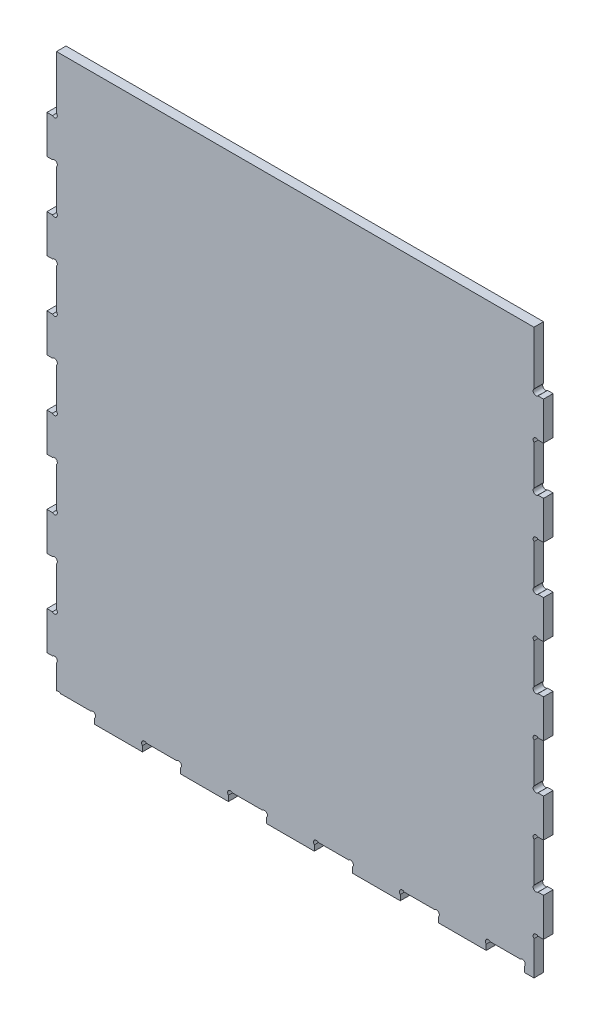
ISO-10303-21;
HEADER;
FILE_DESCRIPTION(('STEP AP214'),'2;1');
FILE_NAME('part.step','',(''),(''),'','','');
FILE_SCHEMA(('AUTOMOTIVE_DESIGN { 1 0 10303 214 1 1 1 1 }'));
ENDSEC;
DATA;
#1=APPLICATION_CONTEXT('core data for automotive mechanical design processes');
#2=APPLICATION_PROTOCOL_DEFINITION('international standard','automotive_design',2000,#1);
#3=PRODUCT_CONTEXT('',#1,'mechanical');
#4=PRODUCT('Part','Part','',(#3));
#5=PRODUCT_RELATED_PRODUCT_CATEGORY('part','',(#4));
#6=PRODUCT_DEFINITION_FORMATION('','',#4);
#7=PRODUCT_DEFINITION_CONTEXT('part definition',#1,'design');
#8=PRODUCT_DEFINITION('design','',#6,#7);
#9=PRODUCT_DEFINITION_SHAPE('','',#8);
#10=(LENGTH_UNIT() NAMED_UNIT(*) SI_UNIT(.MILLI.,.METRE.));
#11=(NAMED_UNIT(*) PLANE_ANGLE_UNIT() SI_UNIT($,.RADIAN.));
#12=(NAMED_UNIT(*) SI_UNIT($,.STERADIAN.) SOLID_ANGLE_UNIT());
#13=UNCERTAINTY_MEASURE_WITH_UNIT(LENGTH_MEASURE(1.E-05),#10,'distance_accuracy_value','');
#14=(GEOMETRIC_REPRESENTATION_CONTEXT(3) GLOBAL_UNCERTAINTY_ASSIGNED_CONTEXT((#13)) GLOBAL_UNIT_ASSIGNED_CONTEXT((#10,
#11,#12)) REPRESENTATION_CONTEXT('',''));
#15=CARTESIAN_POINT('',(0.,0.,0.));
#16=DIRECTION('',(0.,0.,1.));
#17=DIRECTION('',(1.,0.,0.));
#18=AXIS2_PLACEMENT_3D('',#15,#16,#17);
#19=CARTESIAN_POINT('',(-580.298492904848,0.,-9.99999999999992));
#20=DIRECTION('',(0.,1.,0.));
#21=DIRECTION('',(0.,0.,1.));
#22=AXIS2_PLACEMENT_3D('',#19,#20,#21);
#23=PLANE('',#22);
#24=DIRECTION('',(1.,0.,0.));
#25=VECTOR('',#24,1.);
#26=CARTESIAN_POINT('',(-580.298492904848,0.,-9.99999999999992));
#27=LINE('',#26,#25);
#28=CARTESIAN_POINT('',(50.,0.,-10.));
#29=VERTEX_POINT('',#28);
#30=CARTESIAN_POINT('',(100.,0.,-10.));
#31=VERTEX_POINT('',#30);
#32=EDGE_CURVE('E1299',#29,#31,#27,.T.);
#33=ORIENTED_EDGE('',*,*,#32,.T.);
#34=DIRECTION('',(0.,0.,1.));
#35=VECTOR('',#34,1.);
#36=CARTESIAN_POINT('',(100.,0.,-10.));
#37=LINE('',#36,#35);
#38=CARTESIAN_POINT('',(100.,0.,0.));
#39=VERTEX_POINT('',#38);
#40=EDGE_CURVE('E737',#31,#39,#37,.T.);
#41=ORIENTED_EDGE('',*,*,#40,.T.);
#42=DIRECTION('',(1.,0.,0.));
#43=VECTOR('',#42,1.);
#44=CARTESIAN_POINT('',(-580.298492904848,0.,0.));
#45=LINE('',#44,#43);
#46=CARTESIAN_POINT('',(50.,0.,0.));
#47=VERTEX_POINT('',#46);
#48=EDGE_CURVE('E1323',#47,#39,#45,.T.);
#49=ORIENTED_EDGE('',*,*,#48,.F.);
#50=DIRECTION('',(0.,0.,1.));
#51=VECTOR('',#50,1.);
#52=CARTESIAN_POINT('',(50.,0.,-10.));
#53=LINE('',#52,#51);
#54=EDGE_CURVE('E860',#29,#47,#53,.T.);
#55=ORIENTED_EDGE('',*,*,#54,.F.);
#56=EDGE_LOOP('',(#33,#41,#49,#55));
#57=FACE_BOUND('',#56,.T.);
#58=ADVANCED_FACE('F33',(#57),#23,.F.);
#59=CARTESIAN_POINT('',(140.,0.,0.));
#60=VERTEX_POINT('',#59);
#61=CARTESIAN_POINT('',(190.,0.,0.));
#62=VERTEX_POINT('',#61);
#63=EDGE_CURVE('E1326',#60,#62,#45,.T.);
#64=ORIENTED_EDGE('',*,*,#63,.F.);
#65=DIRECTION('',(0.,0.,1.));
#66=VECTOR('',#65,1.);
#67=CARTESIAN_POINT('',(140.,0.,-10.));
#68=LINE('',#67,#66);
#69=CARTESIAN_POINT('',(140.,0.,-10.));
#70=VERTEX_POINT('',#69);
#71=EDGE_CURVE('E740',#70,#60,#68,.T.);
#72=ORIENTED_EDGE('',*,*,#71,.F.);
#73=CARTESIAN_POINT('',(190.,0.,-10.));
#74=VERTEX_POINT('',#73);
#75=EDGE_CURVE('E1322',#70,#74,#27,.T.);
#76=ORIENTED_EDGE('',*,*,#75,.T.);
#77=DIRECTION('',(0.,0.,1.));
#78=VECTOR('',#77,1.);
#79=CARTESIAN_POINT('',(190.,0.,-10.));
#80=LINE('',#79,#78);
#81=EDGE_CURVE('E765',#74,#62,#80,.T.);
#82=ORIENTED_EDGE('',*,*,#81,.T.);
#83=EDGE_LOOP('',(#64,#72,#76,#82));
#84=FACE_BOUND('',#83,.T.);
#85=ADVANCED_FACE('F1452',(#84),#23,.F.);
#86=CARTESIAN_POINT('',(230.,0.,0.));
#87=VERTEX_POINT('',#86);
#88=CARTESIAN_POINT('',(280.,0.,0.));
#89=VERTEX_POINT('',#88);
#90=EDGE_CURVE('E1469',#87,#89,#45,.T.);
#91=ORIENTED_EDGE('',*,*,#90,.F.);
#92=DIRECTION('',(0.,0.,1.));
#93=VECTOR('',#92,1.);
#94=CARTESIAN_POINT('',(230.,0.,-10.));
#95=LINE('',#94,#93);
#96=CARTESIAN_POINT('',(230.,0.,-10.));
#97=VERTEX_POINT('',#96);
#98=EDGE_CURVE('E749',#97,#87,#95,.T.);
#99=ORIENTED_EDGE('',*,*,#98,.F.);
#100=CARTESIAN_POINT('',(280.,0.,-10.));
#101=VERTEX_POINT('',#100);
#102=EDGE_CURVE('E1440',#97,#101,#27,.T.);
#103=ORIENTED_EDGE('',*,*,#102,.T.);
#104=DIRECTION('',(0.,0.,1.));
#105=VECTOR('',#104,1.);
#106=CARTESIAN_POINT('',(280.,0.,-10.));
#107=LINE('',#106,#105);
#108=EDGE_CURVE('E785',#101,#89,#107,.T.);
#109=ORIENTED_EDGE('',*,*,#108,.T.);
#110=EDGE_LOOP('',(#91,#99,#103,#109));
#111=FACE_BOUND('',#110,.T.);
#112=ADVANCED_FACE('F1716',(#111),#23,.F.);
#113=CARTESIAN_POINT('',(320.,0.,0.));
#114=VERTEX_POINT('',#113);
#115=CARTESIAN_POINT('',(370.,0.,0.));
#116=VERTEX_POINT('',#115);
#117=EDGE_CURVE('E1471',#114,#116,#45,.T.);
#118=ORIENTED_EDGE('',*,*,#117,.F.);
#119=DIRECTION('',(0.,0.,1.));
#120=VECTOR('',#119,1.);
#121=CARTESIAN_POINT('',(320.,0.,-10.));
#122=LINE('',#121,#120);
#123=CARTESIAN_POINT('',(320.,0.,-10.));
#124=VERTEX_POINT('',#123);
#125=EDGE_CURVE('E769',#124,#114,#122,.T.);
#126=ORIENTED_EDGE('',*,*,#125,.F.);
#127=CARTESIAN_POINT('',(370.,0.,-10.));
#128=VERTEX_POINT('',#127);
#129=EDGE_CURVE('E1435',#124,#128,#27,.T.);
#130=ORIENTED_EDGE('',*,*,#129,.T.);
#131=DIRECTION('',(0.,0.,1.));
#132=VECTOR('',#131,1.);
#133=CARTESIAN_POINT('',(370.,0.,-10.));
#134=LINE('',#133,#132);
#135=EDGE_CURVE('E806',#128,#116,#134,.T.);
#136=ORIENTED_EDGE('',*,*,#135,.T.);
#137=EDGE_LOOP('',(#118,#126,#130,#136));
#138=FACE_BOUND('',#137,.T.);
#139=ADVANCED_FACE('F1725',(#138),#23,.F.);
#140=CARTESIAN_POINT('',(410.,0.,0.));
#141=VERTEX_POINT('',#140);
#142=CARTESIAN_POINT('',(460.,0.,0.));
#143=VERTEX_POINT('',#142);
#144=EDGE_CURVE('E1476',#141,#143,#45,.T.);
#145=ORIENTED_EDGE('',*,*,#144,.F.);
#146=DIRECTION('',(0.,0.,1.));
#147=VECTOR('',#146,1.);
#148=CARTESIAN_POINT('',(410.,0.,-10.));
#149=LINE('',#148,#147);
#150=CARTESIAN_POINT('',(410.,0.,-10.));
#151=VERTEX_POINT('',#150);
#152=EDGE_CURVE('E789',#151,#141,#149,.T.);
#153=ORIENTED_EDGE('',*,*,#152,.F.);
#154=CARTESIAN_POINT('',(460.,0.,-10.));
#155=VERTEX_POINT('',#154);
#156=EDGE_CURVE('E1433',#151,#155,#27,.T.);
#157=ORIENTED_EDGE('',*,*,#156,.T.);
#158=DIRECTION('',(0.,0.,1.));
#159=VECTOR('',#158,1.);
#160=CARTESIAN_POINT('',(460.,0.,-10.));
#161=LINE('',#160,#159);
#162=EDGE_CURVE('E827',#155,#143,#161,.T.);
#163=ORIENTED_EDGE('',*,*,#162,.T.);
#164=EDGE_LOOP('',(#145,#153,#157,#163));
#165=FACE_BOUND('',#164,.T.);
#166=ADVANCED_FACE('F1719',(#165),#23,.F.);
#167=CARTESIAN_POINT('',(510.,0.,0.));
#168=DIRECTION('',(-1.,0.,0.));
#169=DIRECTION('',(0.,0.,1.));
#170=AXIS2_PLACEMENT_3D('',#167,#168,#169);
#171=PLANE('',#170);
#172=DIRECTION('',(0.,0.,1.));
#173=VECTOR('',#172,1.);
#174=CARTESIAN_POINT('',(510.,534.242640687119,-10.));
#175=LINE('',#174,#173);
#176=CARTESIAN_POINT('',(510.,534.242640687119,-10.));
#177=VERTEX_POINT('',#176);
#178=CARTESIAN_POINT('',(510.,534.242640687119,0.));
#179=VERTEX_POINT('',#178);
#180=EDGE_CURVE('E897',#177,#179,#175,.T.);
#181=ORIENTED_EDGE('',*,*,#180,.F.);
#182=DIRECTION('',(0.,-1.,0.));
#183=VECTOR('',#182,1.);
#184=CARTESIAN_POINT('',(510.,590.213783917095,-10.));
#185=LINE('',#184,#183);
#186=CARTESIAN_POINT('',(510.,590.213783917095,-10.));
#187=VERTEX_POINT('',#186);
#188=EDGE_CURVE('E1300',#187,#177,#185,.T.);
#189=ORIENTED_EDGE('',*,*,#188,.F.);
#190=DIRECTION('',(0.,0.,-1.));
#191=VECTOR('',#190,1.);
#192=CARTESIAN_POINT('',(510.,590.213783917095,-10.));
#193=LINE('',#192,#191);
#194=CARTESIAN_POINT('',(510.,590.213783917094,0.));
#195=VERTEX_POINT('',#194);
#196=EDGE_CURVE('E1285',#195,#187,#193,.T.);
#197=ORIENTED_EDGE('',*,*,#196,.F.);
#198=DIRECTION('',(0.,1.,0.));
#199=VECTOR('',#198,1.);
#200=CARTESIAN_POINT('',(510.,590.213783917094,0.));
#201=LINE('',#200,#199);
#202=EDGE_CURVE('E1294',#179,#195,#201,.T.);
#203=ORIENTED_EDGE('',*,*,#202,.F.);
#204=EDGE_LOOP('',(#181,#189,#197,#203));
#205=FACE_BOUND('',#204,.T.);
#206=ADVANCED_FACE('F1539',(#205),#171,.F.);
#207=DIRECTION('',(0.,0.,1.));
#208=VECTOR('',#207,1.);
#209=CARTESIAN_POINT('',(510.,444.242640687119,-10.));
#210=LINE('',#209,#208);
#211=CARTESIAN_POINT('',(510.,444.242640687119,-10.));
#212=VERTEX_POINT('',#211);
#213=CARTESIAN_POINT('',(510.,444.242640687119,0.));
#214=VERTEX_POINT('',#213);
#215=EDGE_CURVE('E906',#212,#214,#210,.T.);
#216=ORIENTED_EDGE('',*,*,#215,.F.);
#217=CARTESIAN_POINT('',(510.,485.757359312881,-10.));
#218=VERTEX_POINT('',#217);
#219=EDGE_CURVE('E1304',#218,#212,#185,.T.);
#220=ORIENTED_EDGE('',*,*,#219,.F.);
#221=DIRECTION('',(0.,0.,1.));
#222=VECTOR('',#221,1.);
#223=CARTESIAN_POINT('',(510.,485.757359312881,-10.));
#224=LINE('',#223,#222);
#225=CARTESIAN_POINT('',(510.,485.757359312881,0.));
#226=VERTEX_POINT('',#225);
#227=EDGE_CURVE('E895',#226,#218,#224,.F.);
#228=ORIENTED_EDGE('',*,*,#227,.F.);
#229=EDGE_CURVE('E1524',#214,#226,#201,.T.);
#230=ORIENTED_EDGE('',*,*,#229,.F.);
#231=EDGE_LOOP('',(#216,#220,#228,#230));
#232=FACE_BOUND('',#231,.T.);
#233=ADVANCED_FACE('F1730',(#232),#171,.F.);
#234=DIRECTION('',(0.,0.,1.));
#235=VECTOR('',#234,1.);
#236=CARTESIAN_POINT('',(510.,354.242640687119,-10.));
#237=LINE('',#236,#235);
#238=CARTESIAN_POINT('',(510.,354.242640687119,-10.));
#239=VERTEX_POINT('',#238);
#240=CARTESIAN_POINT('',(510.,354.242640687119,0.));
#241=VERTEX_POINT('',#240);
#242=EDGE_CURVE('E915',#239,#241,#237,.T.);
#243=ORIENTED_EDGE('',*,*,#242,.F.);
#244=CARTESIAN_POINT('',(510.,395.757359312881,-10.));
#245=VERTEX_POINT('',#244);
#246=EDGE_CURVE('E2813',#245,#239,#185,.T.);
#247=ORIENTED_EDGE('',*,*,#246,.F.);
#248=DIRECTION('',(0.,0.,1.));
#249=VECTOR('',#248,1.);
#250=CARTESIAN_POINT('',(510.,395.757359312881,-10.));
#251=LINE('',#250,#249);
#252=CARTESIAN_POINT('',(510.,395.757359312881,0.));
#253=VERTEX_POINT('',#252);
#254=EDGE_CURVE('E904',#253,#245,#251,.F.);
#255=ORIENTED_EDGE('',*,*,#254,.F.);
#256=EDGE_CURVE('E1521',#241,#253,#201,.T.);
#257=ORIENTED_EDGE('',*,*,#256,.F.);
#258=EDGE_LOOP('',(#243,#247,#255,#257));
#259=FACE_BOUND('',#258,.T.);
#260=ADVANCED_FACE('F2364',(#259),#171,.F.);
#261=DIRECTION('',(0.,0.,1.));
#262=VECTOR('',#261,1.);
#263=CARTESIAN_POINT('',(510.,264.242640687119,-10.));
#264=LINE('',#263,#262);
#265=CARTESIAN_POINT('',(510.,264.242640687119,-10.));
#266=VERTEX_POINT('',#265);
#267=CARTESIAN_POINT('',(510.,264.242640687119,0.));
#268=VERTEX_POINT('',#267);
#269=EDGE_CURVE('E924',#266,#268,#264,.T.);
#270=ORIENTED_EDGE('',*,*,#269,.F.);
#271=CARTESIAN_POINT('',(510.,305.757359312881,-10.));
#272=VERTEX_POINT('',#271);
#273=EDGE_CURVE('E2811',#272,#266,#185,.T.);
#274=ORIENTED_EDGE('',*,*,#273,.F.);
#275=DIRECTION('',(0.,0.,1.));
#276=VECTOR('',#275,1.);
#277=CARTESIAN_POINT('',(510.,305.757359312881,-10.));
#278=LINE('',#277,#276);
#279=CARTESIAN_POINT('',(510.,305.757359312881,0.));
#280=VERTEX_POINT('',#279);
#281=EDGE_CURVE('E913',#280,#272,#278,.F.);
#282=ORIENTED_EDGE('',*,*,#281,.F.);
#283=EDGE_CURVE('E1518',#268,#280,#201,.T.);
#284=ORIENTED_EDGE('',*,*,#283,.F.);
#285=EDGE_LOOP('',(#270,#274,#282,#284));
#286=FACE_BOUND('',#285,.T.);
#287=ADVANCED_FACE('F2372',(#286),#171,.F.);
#288=DIRECTION('',(0.,0.,1.));
#289=VECTOR('',#288,1.);
#290=CARTESIAN_POINT('',(510.,174.242640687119,-10.));
#291=LINE('',#290,#289);
#292=CARTESIAN_POINT('',(510.,174.242640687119,-10.));
#293=VERTEX_POINT('',#292);
#294=CARTESIAN_POINT('',(510.,174.242640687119,0.));
#295=VERTEX_POINT('',#294);
#296=EDGE_CURVE('E933',#293,#295,#291,.T.);
#297=ORIENTED_EDGE('',*,*,#296,.F.);
#298=CARTESIAN_POINT('',(510.,215.757359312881,-10.));
#299=VERTEX_POINT('',#298);
#300=EDGE_CURVE('E2809',#299,#293,#185,.T.);
#301=ORIENTED_EDGE('',*,*,#300,.F.);
#302=DIRECTION('',(0.,0.,1.));
#303=VECTOR('',#302,1.);
#304=CARTESIAN_POINT('',(510.,215.757359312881,-10.));
#305=LINE('',#304,#303);
#306=CARTESIAN_POINT('',(510.,215.757359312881,0.));
#307=VERTEX_POINT('',#306);
#308=EDGE_CURVE('E922',#307,#299,#305,.F.);
#309=ORIENTED_EDGE('',*,*,#308,.F.);
#310=EDGE_CURVE('E1516',#295,#307,#201,.T.);
#311=ORIENTED_EDGE('',*,*,#310,.F.);
#312=EDGE_LOOP('',(#297,#301,#309,#311));
#313=FACE_BOUND('',#312,.T.);
#314=ADVANCED_FACE('F2380',(#313),#171,.F.);
#315=DIRECTION('',(0.,0.,1.));
#316=VECTOR('',#315,1.);
#317=CARTESIAN_POINT('',(510.,84.2426406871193,-10.));
#318=LINE('',#317,#316);
#319=CARTESIAN_POINT('',(510.,84.2426406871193,-10.));
#320=VERTEX_POINT('',#319);
#321=CARTESIAN_POINT('',(510.,84.2426406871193,0.));
#322=VERTEX_POINT('',#321);
#323=EDGE_CURVE('E942',#320,#322,#318,.T.);
#324=ORIENTED_EDGE('',*,*,#323,.F.);
#325=CARTESIAN_POINT('',(510.,125.757359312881,-10.));
#326=VERTEX_POINT('',#325);
#327=EDGE_CURVE('E1305',#326,#320,#185,.T.);
#328=ORIENTED_EDGE('',*,*,#327,.F.);
#329=DIRECTION('',(0.,0.,1.));
#330=VECTOR('',#329,1.);
#331=CARTESIAN_POINT('',(510.,125.757359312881,-10.));
#332=LINE('',#331,#330);
#333=CARTESIAN_POINT('',(510.,125.757359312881,0.));
#334=VERTEX_POINT('',#333);
#335=EDGE_CURVE('E931',#334,#326,#332,.F.);
#336=ORIENTED_EDGE('',*,*,#335,.F.);
#337=EDGE_CURVE('E1293',#322,#334,#201,.T.);
#338=ORIENTED_EDGE('',*,*,#337,.F.);
#339=EDGE_LOOP('',(#324,#328,#336,#338));
#340=FACE_BOUND('',#339,.T.);
#341=ADVANCED_FACE('F2388',(#340),#171,.F.);
#342=DIRECTION('',(0.,0.,1.));
#343=VECTOR('',#342,1.);
#344=CARTESIAN_POINT('',(510.,35.7573593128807,-10.));
#345=LINE('',#344,#343);
#346=CARTESIAN_POINT('',(510.,35.7573593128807,0.));
#347=VERTEX_POINT('',#346);
#348=CARTESIAN_POINT('',(510.,35.7573593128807,-10.));
#349=VERTEX_POINT('',#348);
#350=EDGE_CURVE('E940',#347,#349,#345,.F.);
#351=ORIENTED_EDGE('',*,*,#350,.F.);
#352=CARTESIAN_POINT('',(510.,0.,0.));
#353=VERTEX_POINT('',#352);
#354=EDGE_CURVE('E1290',#353,#347,#201,.T.);
#355=ORIENTED_EDGE('',*,*,#354,.F.);
#356=DIRECTION('',(0.,0.,1.));
#357=VECTOR('',#356,1.);
#358=CARTESIAN_POINT('',(510.,0.,-9.99999999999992));
#359=LINE('',#358,#357);
#360=CARTESIAN_POINT('',(510.,0.,-9.99999999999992));
#361=VERTEX_POINT('',#360);
#362=EDGE_CURVE('E1295',#361,#353,#359,.T.);
#363=ORIENTED_EDGE('',*,*,#362,.F.);
#364=EDGE_CURVE('E1306',#349,#361,#185,.T.);
#365=ORIENTED_EDGE('',*,*,#364,.F.);
#366=EDGE_LOOP('',(#351,#355,#363,#365));
#367=FACE_BOUND('',#366,.T.);
#368=ADVANCED_FACE('F1489',(#367),#171,.F.);
#369=CARTESIAN_POINT('',(510.,80.,-10.));
#370=DIRECTION('',(0.,-1.,0.));
#371=DIRECTION('',(0.,0.,-1.));
#372=AXIS2_PLACEMENT_3D('',#369,#370,#371);
#373=PLANE('',#372);
#374=DIRECTION('',(0.,0.,1.));
#375=VECTOR('',#374,1.);
#376=CARTESIAN_POINT('',(514.242640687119,80.,-10.));
#377=LINE('',#376,#375);
#378=CARTESIAN_POINT('',(514.242640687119,80.,0.));
#379=VERTEX_POINT('',#378);
#380=CARTESIAN_POINT('',(514.242640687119,80.,-10.));
#381=VERTEX_POINT('',#380);
#382=EDGE_CURVE('E1393',#379,#381,#377,.F.);
#383=ORIENTED_EDGE('',*,*,#382,.F.);
#384=DIRECTION('',(1.,0.,0.));
#385=VECTOR('',#384,1.);
#386=CARTESIAN_POINT('',(510.,80.,0.));
#387=LINE('',#386,#385);
#388=CARTESIAN_POINT('',(520.,80.,0.));
#389=VERTEX_POINT('',#388);
#390=EDGE_CURVE('E1052',#379,#389,#387,.T.);
#391=ORIENTED_EDGE('',*,*,#390,.T.);
#392=DIRECTION('',(0.,0.,1.));
#393=VECTOR('',#392,1.);
#394=CARTESIAN_POINT('',(520.,80.,-10.));
#395=LINE('',#394,#393);
#396=CARTESIAN_POINT('',(520.,80.,-10.));
#397=VERTEX_POINT('',#396);
#398=EDGE_CURVE('E1062',#397,#389,#395,.T.);
#399=ORIENTED_EDGE('',*,*,#398,.F.);
#400=DIRECTION('',(1.,0.,0.));
#401=VECTOR('',#400,1.);
#402=CARTESIAN_POINT('',(510.,80.,-10.));
#403=LINE('',#402,#401);
#404=EDGE_CURVE('E1054',#381,#397,#403,.T.);
#405=ORIENTED_EDGE('',*,*,#404,.F.);
#406=EDGE_LOOP('',(#383,#391,#399,#405));
#407=FACE_BOUND('',#406,.T.);
#408=ADVANCED_FACE('F1507',(#407),#373,.F.);
#409=CARTESIAN_POINT('',(510.,40.,-10.));
#410=DIRECTION('',(0.,1.,0.));
#411=DIRECTION('',(0.,0.,1.));
#412=AXIS2_PLACEMENT_3D('',#409,#410,#411);
#413=PLANE('',#412);
#414=DIRECTION('',(0.,0.,1.));
#415=VECTOR('',#414,1.);
#416=CARTESIAN_POINT('',(514.242640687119,40.,-10.));
#417=LINE('',#416,#415);
#418=CARTESIAN_POINT('',(514.242640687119,40.,-10.));
#419=VERTEX_POINT('',#418);
#420=CARTESIAN_POINT('',(514.242640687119,40.,0.));
#421=VERTEX_POINT('',#420);
#422=EDGE_CURVE('E1390',#419,#421,#417,.T.);
#423=ORIENTED_EDGE('',*,*,#422,.F.);
#424=DIRECTION('',(-1.,0.,0.));
#425=VECTOR('',#424,1.);
#426=CARTESIAN_POINT('',(510.,40.,-10.));
#427=LINE('',#426,#425);
#428=CARTESIAN_POINT('',(520.,40.,-10.));
#429=VERTEX_POINT('',#428);
#430=EDGE_CURVE('E1048',#429,#419,#427,.T.);
#431=ORIENTED_EDGE('',*,*,#430,.F.);
#432=DIRECTION('',(0.,0.,1.));
#433=VECTOR('',#432,1.);
#434=CARTESIAN_POINT('',(520.,40.,-10.));
#435=LINE('',#434,#433);
#436=CARTESIAN_POINT('',(520.,40.,0.));
#437=VERTEX_POINT('',#436);
#438=EDGE_CURVE('E1056',#429,#437,#435,.T.);
#439=ORIENTED_EDGE('',*,*,#438,.T.);
#440=DIRECTION('',(-1.,0.,0.));
#441=VECTOR('',#440,1.);
#442=CARTESIAN_POINT('',(510.,40.,0.));
#443=LINE('',#442,#441);
#444=EDGE_CURVE('E1045',#437,#421,#443,.T.);
#445=ORIENTED_EDGE('',*,*,#444,.T.);
#446=EDGE_LOOP('',(#423,#431,#439,#445));
#447=FACE_BOUND('',#446,.T.);
#448=ADVANCED_FACE('F1497',(#447),#413,.F.);
#449=CARTESIAN_POINT('',(510.,170.,-10.));
#450=DIRECTION('',(0.,-1.,0.));
#451=DIRECTION('',(0.,0.,-1.));
#452=AXIS2_PLACEMENT_3D('',#449,#450,#451);
#453=PLANE('',#452);
#454=DIRECTION('',(0.,0.,1.));
#455=VECTOR('',#454,1.);
#456=CARTESIAN_POINT('',(514.242640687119,170.,-10.));
#457=LINE('',#456,#455);
#458=CARTESIAN_POINT('',(514.242640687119,170.,0.));
#459=VERTEX_POINT('',#458);
#460=CARTESIAN_POINT('',(514.242640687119,170.,-10.));
#461=VERTEX_POINT('',#460);
#462=EDGE_CURVE('E1387',#459,#461,#457,.F.);
#463=ORIENTED_EDGE('',*,*,#462,.F.);
#464=DIRECTION('',(1.,0.,0.));
#465=VECTOR('',#464,1.);
#466=CARTESIAN_POINT('',(510.,170.,0.));
#467=LINE('',#466,#465);
#468=CARTESIAN_POINT('',(520.,170.,0.));
#469=VERTEX_POINT('',#468);
#470=EDGE_CURVE('E1032',#459,#469,#467,.T.);
#471=ORIENTED_EDGE('',*,*,#470,.T.);
#472=DIRECTION('',(0.,0.,1.));
#473=VECTOR('',#472,1.);
#474=CARTESIAN_POINT('',(520.,170.,-10.));
#475=LINE('',#474,#473);
#476=CARTESIAN_POINT('',(520.,170.,-10.));
#477=VERTEX_POINT('',#476);
#478=EDGE_CURVE('E1042',#477,#469,#475,.T.);
#479=ORIENTED_EDGE('',*,*,#478,.F.);
#480=DIRECTION('',(1.,0.,0.));
#481=VECTOR('',#480,1.);
#482=CARTESIAN_POINT('',(510.,170.,-10.));
#483=LINE('',#482,#481);
#484=EDGE_CURVE('E1034',#461,#477,#483,.T.);
#485=ORIENTED_EDGE('',*,*,#484,.F.);
#486=EDGE_LOOP('',(#463,#471,#479,#485));
#487=FACE_BOUND('',#486,.T.);
#488=ADVANCED_FACE('F2006',(#487),#453,.F.);
#489=CARTESIAN_POINT('',(510.,130.,-10.));
#490=DIRECTION('',(0.,1.,0.));
#491=DIRECTION('',(0.,0.,1.));
#492=AXIS2_PLACEMENT_3D('',#489,#490,#491);
#493=PLANE('',#492);
#494=DIRECTION('',(0.,0.,1.));
#495=VECTOR('',#494,1.);
#496=CARTESIAN_POINT('',(514.242640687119,130.,-10.));
#497=LINE('',#496,#495);
#498=CARTESIAN_POINT('',(514.242640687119,130.,-10.));
#499=VERTEX_POINT('',#498);
#500=CARTESIAN_POINT('',(514.242640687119,130.,0.));
#501=VERTEX_POINT('',#500);
#502=EDGE_CURVE('E1384',#499,#501,#497,.T.);
#503=ORIENTED_EDGE('',*,*,#502,.F.);
#504=DIRECTION('',(-1.,0.,0.));
#505=VECTOR('',#504,1.);
#506=CARTESIAN_POINT('',(510.,130.,-10.));
#507=LINE('',#506,#505);
#508=CARTESIAN_POINT('',(520.,130.,-10.));
#509=VERTEX_POINT('',#508);
#510=EDGE_CURVE('E1028',#509,#499,#507,.T.);
#511=ORIENTED_EDGE('',*,*,#510,.F.);
#512=DIRECTION('',(0.,0.,1.));
#513=VECTOR('',#512,1.);
#514=CARTESIAN_POINT('',(520.,130.,-10.));
#515=LINE('',#514,#513);
#516=CARTESIAN_POINT('',(520.,130.,0.));
#517=VERTEX_POINT('',#516);
#518=EDGE_CURVE('E1036',#509,#517,#515,.T.);
#519=ORIENTED_EDGE('',*,*,#518,.T.);
#520=DIRECTION('',(-1.,0.,0.));
#521=VECTOR('',#520,1.);
#522=CARTESIAN_POINT('',(510.,130.,0.));
#523=LINE('',#522,#521);
#524=EDGE_CURVE('E1025',#517,#501,#523,.T.);
#525=ORIENTED_EDGE('',*,*,#524,.T.);
#526=EDGE_LOOP('',(#503,#511,#519,#525));
#527=FACE_BOUND('',#526,.T.);
#528=ADVANCED_FACE('F1997',(#527),#493,.F.);
#529=CARTESIAN_POINT('',(510.,260.,-10.));
#530=DIRECTION('',(0.,-1.,0.));
#531=DIRECTION('',(0.,0.,-1.));
#532=AXIS2_PLACEMENT_3D('',#529,#530,#531);
#533=PLANE('',#532);
#534=DIRECTION('',(0.,0.,1.));
#535=VECTOR('',#534,1.);
#536=CARTESIAN_POINT('',(514.242640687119,260.,-10.));
#537=LINE('',#536,#535);
#538=CARTESIAN_POINT('',(514.242640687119,260.,0.));
#539=VERTEX_POINT('',#538);
#540=CARTESIAN_POINT('',(514.242640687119,260.,-10.));
#541=VERTEX_POINT('',#540);
#542=EDGE_CURVE('E1381',#539,#541,#537,.F.);
#543=ORIENTED_EDGE('',*,*,#542,.F.);
#544=DIRECTION('',(1.,0.,0.));
#545=VECTOR('',#544,1.);
#546=CARTESIAN_POINT('',(510.,260.,0.));
#547=LINE('',#546,#545);
#548=CARTESIAN_POINT('',(520.,260.,0.));
#549=VERTEX_POINT('',#548);
#550=EDGE_CURVE('E1012',#539,#549,#547,.T.);
#551=ORIENTED_EDGE('',*,*,#550,.T.);
#552=DIRECTION('',(0.,0.,1.));
#553=VECTOR('',#552,1.);
#554=CARTESIAN_POINT('',(520.,260.,-10.));
#555=LINE('',#554,#553);
#556=CARTESIAN_POINT('',(520.,260.,-10.));
#557=VERTEX_POINT('',#556);
#558=EDGE_CURVE('E1022',#557,#549,#555,.T.);
#559=ORIENTED_EDGE('',*,*,#558,.F.);
#560=DIRECTION('',(1.,0.,0.));
#561=VECTOR('',#560,1.);
#562=CARTESIAN_POINT('',(510.,260.,-10.));
#563=LINE('',#562,#561);
#564=EDGE_CURVE('E1014',#541,#557,#563,.T.);
#565=ORIENTED_EDGE('',*,*,#564,.F.);
#566=EDGE_LOOP('',(#543,#551,#559,#565));
#567=FACE_BOUND('',#566,.T.);
#568=ADVANCED_FACE('F1994',(#567),#533,.F.);
#569=CARTESIAN_POINT('',(510.,220.,-10.));
#570=DIRECTION('',(0.,1.,0.));
#571=DIRECTION('',(0.,0.,1.));
#572=AXIS2_PLACEMENT_3D('',#569,#570,#571);
#573=PLANE('',#572);
#574=DIRECTION('',(0.,0.,1.));
#575=VECTOR('',#574,1.);
#576=CARTESIAN_POINT('',(514.242640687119,220.,-10.));
#577=LINE('',#576,#575);
#578=CARTESIAN_POINT('',(514.242640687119,220.,-10.));
#579=VERTEX_POINT('',#578);
#580=CARTESIAN_POINT('',(514.242640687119,220.,0.));
#581=VERTEX_POINT('',#580);
#582=EDGE_CURVE('E1378',#579,#581,#577,.T.);
#583=ORIENTED_EDGE('',*,*,#582,.F.);
#584=DIRECTION('',(-1.,0.,0.));
#585=VECTOR('',#584,1.);
#586=CARTESIAN_POINT('',(510.,220.,-10.));
#587=LINE('',#586,#585);
#588=CARTESIAN_POINT('',(520.,220.,-10.));
#589=VERTEX_POINT('',#588);
#590=EDGE_CURVE('E1008',#589,#579,#587,.T.);
#591=ORIENTED_EDGE('',*,*,#590,.F.);
#592=DIRECTION('',(0.,0.,1.));
#593=VECTOR('',#592,1.);
#594=CARTESIAN_POINT('',(520.,220.,-10.));
#595=LINE('',#594,#593);
#596=CARTESIAN_POINT('',(520.,220.,0.));
#597=VERTEX_POINT('',#596);
#598=EDGE_CURVE('E1016',#589,#597,#595,.T.);
#599=ORIENTED_EDGE('',*,*,#598,.T.);
#600=DIRECTION('',(-1.,0.,0.));
#601=VECTOR('',#600,1.);
#602=CARTESIAN_POINT('',(510.,220.,0.));
#603=LINE('',#602,#601);
#604=EDGE_CURVE('E1005',#597,#581,#603,.T.);
#605=ORIENTED_EDGE('',*,*,#604,.T.);
#606=EDGE_LOOP('',(#583,#591,#599,#605));
#607=FACE_BOUND('',#606,.T.);
#608=ADVANCED_FACE('F1985',(#607),#573,.F.);
#609=CARTESIAN_POINT('',(510.,350.,-10.));
#610=DIRECTION('',(0.,-1.,0.));
#611=DIRECTION('',(0.,0.,-1.));
#612=AXIS2_PLACEMENT_3D('',#609,#610,#611);
#613=PLANE('',#612);
#614=DIRECTION('',(0.,0.,1.));
#615=VECTOR('',#614,1.);
#616=CARTESIAN_POINT('',(514.242640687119,350.,-10.));
#617=LINE('',#616,#615);
#618=CARTESIAN_POINT('',(514.242640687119,350.,0.));
#619=VERTEX_POINT('',#618);
#620=CARTESIAN_POINT('',(514.242640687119,350.,-10.));
#621=VERTEX_POINT('',#620);
#622=EDGE_CURVE('E1375',#619,#621,#617,.F.);
#623=ORIENTED_EDGE('',*,*,#622,.F.);
#624=DIRECTION('',(1.,0.,0.));
#625=VECTOR('',#624,1.);
#626=CARTESIAN_POINT('',(510.,350.,0.));
#627=LINE('',#626,#625);
#628=CARTESIAN_POINT('',(520.,350.,0.));
#629=VERTEX_POINT('',#628);
#630=EDGE_CURVE('E992',#619,#629,#627,.T.);
#631=ORIENTED_EDGE('',*,*,#630,.T.);
#632=DIRECTION('',(0.,0.,1.));
#633=VECTOR('',#632,1.);
#634=CARTESIAN_POINT('',(520.,350.,-10.));
#635=LINE('',#634,#633);
#636=CARTESIAN_POINT('',(520.,350.,-10.));
#637=VERTEX_POINT('',#636);
#638=EDGE_CURVE('E1002',#637,#629,#635,.T.);
#639=ORIENTED_EDGE('',*,*,#638,.F.);
#640=DIRECTION('',(1.,0.,0.));
#641=VECTOR('',#640,1.);
#642=CARTESIAN_POINT('',(510.,350.,-10.));
#643=LINE('',#642,#641);
#644=EDGE_CURVE('E994',#621,#637,#643,.T.);
#645=ORIENTED_EDGE('',*,*,#644,.F.);
#646=EDGE_LOOP('',(#623,#631,#639,#645));
#647=FACE_BOUND('',#646,.T.);
#648=ADVANCED_FACE('F1982',(#647),#613,.F.);
#649=CARTESIAN_POINT('',(510.,310.,-10.));
#650=DIRECTION('',(0.,1.,0.));
#651=DIRECTION('',(0.,0.,1.));
#652=AXIS2_PLACEMENT_3D('',#649,#650,#651);
#653=PLANE('',#652);
#654=DIRECTION('',(0.,0.,1.));
#655=VECTOR('',#654,1.);
#656=CARTESIAN_POINT('',(514.242640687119,310.,-10.));
#657=LINE('',#656,#655);
#658=CARTESIAN_POINT('',(514.242640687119,310.,-10.));
#659=VERTEX_POINT('',#658);
#660=CARTESIAN_POINT('',(514.242640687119,310.,0.));
#661=VERTEX_POINT('',#660);
#662=EDGE_CURVE('E1372',#659,#661,#657,.T.);
#663=ORIENTED_EDGE('',*,*,#662,.F.);
#664=DIRECTION('',(-1.,0.,0.));
#665=VECTOR('',#664,1.);
#666=CARTESIAN_POINT('',(510.,310.,-10.));
#667=LINE('',#666,#665);
#668=CARTESIAN_POINT('',(520.,310.,-10.));
#669=VERTEX_POINT('',#668);
#670=EDGE_CURVE('E988',#669,#659,#667,.T.);
#671=ORIENTED_EDGE('',*,*,#670,.F.);
#672=DIRECTION('',(0.,0.,1.));
#673=VECTOR('',#672,1.);
#674=CARTESIAN_POINT('',(520.,310.,-10.));
#675=LINE('',#674,#673);
#676=CARTESIAN_POINT('',(520.,310.,0.));
#677=VERTEX_POINT('',#676);
#678=EDGE_CURVE('E996',#669,#677,#675,.T.);
#679=ORIENTED_EDGE('',*,*,#678,.T.);
#680=DIRECTION('',(-1.,0.,0.));
#681=VECTOR('',#680,1.);
#682=CARTESIAN_POINT('',(510.,310.,0.));
#683=LINE('',#682,#681);
#684=EDGE_CURVE('E985',#677,#661,#683,.T.);
#685=ORIENTED_EDGE('',*,*,#684,.T.);
#686=EDGE_LOOP('',(#663,#671,#679,#685));
#687=FACE_BOUND('',#686,.T.);
#688=ADVANCED_FACE('F1973',(#687),#653,.F.);
#689=CARTESIAN_POINT('',(510.,440.,-10.));
#690=DIRECTION('',(0.,-1.,0.));
#691=DIRECTION('',(0.,0.,-1.));
#692=AXIS2_PLACEMENT_3D('',#689,#690,#691);
#693=PLANE('',#692);
#694=DIRECTION('',(0.,0.,1.));
#695=VECTOR('',#694,1.);
#696=CARTESIAN_POINT('',(514.242640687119,440.,-10.));
#697=LINE('',#696,#695);
#698=CARTESIAN_POINT('',(514.242640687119,440.,0.));
#699=VERTEX_POINT('',#698);
#700=CARTESIAN_POINT('',(514.242640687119,440.,-10.));
#701=VERTEX_POINT('',#700);
#702=EDGE_CURVE('E1369',#699,#701,#697,.F.);
#703=ORIENTED_EDGE('',*,*,#702,.F.);
#704=DIRECTION('',(1.,0.,0.));
#705=VECTOR('',#704,1.);
#706=CARTESIAN_POINT('',(510.,440.,0.));
#707=LINE('',#706,#705);
#708=CARTESIAN_POINT('',(520.,440.,0.));
#709=VERTEX_POINT('',#708);
#710=EDGE_CURVE('E972',#699,#709,#707,.T.);
#711=ORIENTED_EDGE('',*,*,#710,.T.);
#712=DIRECTION('',(0.,0.,1.));
#713=VECTOR('',#712,1.);
#714=CARTESIAN_POINT('',(520.,440.,-10.));
#715=LINE('',#714,#713);
#716=CARTESIAN_POINT('',(520.,440.,-10.));
#717=VERTEX_POINT('',#716);
#718=EDGE_CURVE('E982',#717,#709,#715,.T.);
#719=ORIENTED_EDGE('',*,*,#718,.F.);
#720=DIRECTION('',(1.,0.,0.));
#721=VECTOR('',#720,1.);
#722=CARTESIAN_POINT('',(510.,440.,-10.));
#723=LINE('',#722,#721);
#724=EDGE_CURVE('E974',#701,#717,#723,.T.);
#725=ORIENTED_EDGE('',*,*,#724,.F.);
#726=EDGE_LOOP('',(#703,#711,#719,#725));
#727=FACE_BOUND('',#726,.T.);
#728=ADVANCED_FACE('F1970',(#727),#693,.F.);
#729=CARTESIAN_POINT('',(510.,400.,-10.));
#730=DIRECTION('',(0.,1.,0.));
#731=DIRECTION('',(0.,0.,1.));
#732=AXIS2_PLACEMENT_3D('',#729,#730,#731);
#733=PLANE('',#732);
#734=DIRECTION('',(0.,0.,1.));
#735=VECTOR('',#734,1.);
#736=CARTESIAN_POINT('',(514.242640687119,400.,-10.));
#737=LINE('',#736,#735);
#738=CARTESIAN_POINT('',(514.242640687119,400.,-10.));
#739=VERTEX_POINT('',#738);
#740=CARTESIAN_POINT('',(514.242640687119,400.,0.));
#741=VERTEX_POINT('',#740);
#742=EDGE_CURVE('E1366',#739,#741,#737,.T.);
#743=ORIENTED_EDGE('',*,*,#742,.F.);
#744=DIRECTION('',(-1.,0.,0.));
#745=VECTOR('',#744,1.);
#746=CARTESIAN_POINT('',(510.,400.,-10.));
#747=LINE('',#746,#745);
#748=CARTESIAN_POINT('',(520.,400.,-10.));
#749=VERTEX_POINT('',#748);
#750=EDGE_CURVE('E968',#749,#739,#747,.T.);
#751=ORIENTED_EDGE('',*,*,#750,.F.);
#752=DIRECTION('',(0.,0.,1.));
#753=VECTOR('',#752,1.);
#754=CARTESIAN_POINT('',(520.,400.,-10.));
#755=LINE('',#754,#753);
#756=CARTESIAN_POINT('',(520.,400.,0.));
#757=VERTEX_POINT('',#756);
#758=EDGE_CURVE('E976',#749,#757,#755,.T.);
#759=ORIENTED_EDGE('',*,*,#758,.T.);
#760=DIRECTION('',(-1.,0.,0.));
#761=VECTOR('',#760,1.);
#762=CARTESIAN_POINT('',(510.,400.,0.));
#763=LINE('',#762,#761);
#764=EDGE_CURVE('E965',#757,#741,#763,.T.);
#765=ORIENTED_EDGE('',*,*,#764,.T.);
#766=EDGE_LOOP('',(#743,#751,#759,#765));
#767=FACE_BOUND('',#766,.T.);
#768=ADVANCED_FACE('F1961',(#767),#733,.F.);
#769=CARTESIAN_POINT('',(510.,530.,-10.));
#770=DIRECTION('',(0.,-1.,0.));
#771=DIRECTION('',(0.,0.,-1.));
#772=AXIS2_PLACEMENT_3D('',#769,#770,#771);
#773=PLANE('',#772);
#774=DIRECTION('',(0.,0.,1.));
#775=VECTOR('',#774,1.);
#776=CARTESIAN_POINT('',(514.242640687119,530.,-10.));
#777=LINE('',#776,#775);
#778=CARTESIAN_POINT('',(514.242640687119,530.,0.));
#779=VERTEX_POINT('',#778);
#780=CARTESIAN_POINT('',(514.242640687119,530.,-10.));
#781=VERTEX_POINT('',#780);
#782=EDGE_CURVE('E1363',#779,#781,#777,.F.);
#783=ORIENTED_EDGE('',*,*,#782,.F.);
#784=DIRECTION('',(1.,0.,0.));
#785=VECTOR('',#784,1.);
#786=CARTESIAN_POINT('',(510.,530.,0.));
#787=LINE('',#786,#785);
#788=CARTESIAN_POINT('',(520.,530.,0.));
#789=VERTEX_POINT('',#788);
#790=EDGE_CURVE('E952',#779,#789,#787,.T.);
#791=ORIENTED_EDGE('',*,*,#790,.T.);
#792=DIRECTION('',(0.,0.,1.));
#793=VECTOR('',#792,1.);
#794=CARTESIAN_POINT('',(520.,530.,-10.));
#795=LINE('',#794,#793);
#796=CARTESIAN_POINT('',(520.,530.,-10.));
#797=VERTEX_POINT('',#796);
#798=EDGE_CURVE('E962',#797,#789,#795,.T.);
#799=ORIENTED_EDGE('',*,*,#798,.F.);
#800=DIRECTION('',(1.,0.,0.));
#801=VECTOR('',#800,1.);
#802=CARTESIAN_POINT('',(510.,530.,-10.));
#803=LINE('',#802,#801);
#804=EDGE_CURVE('E954',#781,#797,#803,.T.);
#805=ORIENTED_EDGE('',*,*,#804,.F.);
#806=EDGE_LOOP('',(#783,#791,#799,#805));
#807=FACE_BOUND('',#806,.T.);
#808=ADVANCED_FACE('F1957',(#807),#773,.F.);
#809=CARTESIAN_POINT('',(510.,490.,-10.));
#810=DIRECTION('',(0.,1.,0.));
#811=DIRECTION('',(0.,0.,1.));
#812=AXIS2_PLACEMENT_3D('',#809,#810,#811);
#813=PLANE('',#812);
#814=DIRECTION('',(0.,0.,1.));
#815=VECTOR('',#814,1.);
#816=CARTESIAN_POINT('',(514.242640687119,490.,-10.));
#817=LINE('',#816,#815);
#818=CARTESIAN_POINT('',(514.242640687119,490.,-10.));
#819=VERTEX_POINT('',#818);
#820=CARTESIAN_POINT('',(514.242640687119,490.,0.));
#821=VERTEX_POINT('',#820);
#822=EDGE_CURVE('E1360',#819,#821,#817,.T.);
#823=ORIENTED_EDGE('',*,*,#822,.F.);
#824=DIRECTION('',(-1.,0.,0.));
#825=VECTOR('',#824,1.);
#826=CARTESIAN_POINT('',(510.,490.,-10.));
#827=LINE('',#826,#825);
#828=CARTESIAN_POINT('',(520.,490.,-10.));
#829=VERTEX_POINT('',#828);
#830=EDGE_CURVE('E948',#829,#819,#827,.T.);
#831=ORIENTED_EDGE('',*,*,#830,.F.);
#832=DIRECTION('',(0.,0.,1.));
#833=VECTOR('',#832,1.);
#834=CARTESIAN_POINT('',(520.,490.,-10.));
#835=LINE('',#834,#833);
#836=CARTESIAN_POINT('',(520.,490.,0.));
#837=VERTEX_POINT('',#836);
#838=EDGE_CURVE('E956',#829,#837,#835,.T.);
#839=ORIENTED_EDGE('',*,*,#838,.T.);
#840=DIRECTION('',(-1.,0.,0.));
#841=VECTOR('',#840,1.);
#842=CARTESIAN_POINT('',(510.,490.,0.));
#843=LINE('',#842,#841);
#844=EDGE_CURVE('E945',#837,#821,#843,.T.);
#845=ORIENTED_EDGE('',*,*,#844,.T.);
#846=EDGE_LOOP('',(#823,#831,#839,#845));
#847=FACE_BOUND('',#846,.T.);
#848=ADVANCED_FACE('F1960',(#847),#813,.F.);
#849=CARTESIAN_POINT('',(10.,648.878970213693,-164.822751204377));
#850=DIRECTION('',(-1.,0.,0.));
#851=DIRECTION('',(0.,0.,1.));
#852=AXIS2_PLACEMENT_3D('',#849,#850,#851);
#853=PLANE('',#852);
#854=DIRECTION('',(0.,0.,1.));
#855=VECTOR('',#854,1.);
#856=CARTESIAN_POINT('',(10.,444.242640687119,-10.));
#857=LINE('',#856,#855);
#858=CARTESIAN_POINT('',(10.,444.242640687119,0.));
#859=VERTEX_POINT('',#858);
#860=CARTESIAN_POINT('',(9.99999999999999,444.242640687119,-10.));
#861=VERTEX_POINT('',#860);
#862=EDGE_CURVE('E1108',#859,#861,#857,.F.);
#863=ORIENTED_EDGE('',*,*,#862,.F.);
#864=DIRECTION('',(0.,1.,0.));
#865=VECTOR('',#864,1.);
#866=CARTESIAN_POINT('',(10.,590.213783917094,0.));
#867=LINE('',#866,#865);
#868=CARTESIAN_POINT('',(10.,485.757359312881,0.));
#869=VERTEX_POINT('',#868);
#870=EDGE_CURVE('E1545',#859,#869,#867,.T.);
#871=ORIENTED_EDGE('',*,*,#870,.T.);
#872=DIRECTION('',(0.,0.,1.));
#873=VECTOR('',#872,1.);
#874=CARTESIAN_POINT('',(10.,485.757359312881,-10.));
#875=LINE('',#874,#873);
#876=CARTESIAN_POINT('',(9.99999999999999,485.757359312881,-10.));
#877=VERTEX_POINT('',#876);
#878=EDGE_CURVE('E1103',#877,#869,#875,.T.);
#879=ORIENTED_EDGE('',*,*,#878,.F.);
#880=DIRECTION('',(0.,-1.,0.));
#881=VECTOR('',#880,1.);
#882=CARTESIAN_POINT('',(10.,590.213783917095,-10.));
#883=LINE('',#882,#881);
#884=EDGE_CURVE('E1316',#877,#861,#883,.T.);
#885=ORIENTED_EDGE('',*,*,#884,.T.);
#886=EDGE_LOOP('',(#863,#871,#879,#885));
#887=FACE_BOUND('',#886,.T.);
#888=ADVANCED_FACE('F1597',(#887),#853,.T.);
#889=DIRECTION('',(0.,0.,1.));
#890=VECTOR('',#889,1.);
#891=CARTESIAN_POINT('',(10.,354.242640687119,-10.));
#892=LINE('',#891,#890);
#893=CARTESIAN_POINT('',(10.,354.242640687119,0.));
#894=VERTEX_POINT('',#893);
#895=CARTESIAN_POINT('',(9.99999999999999,354.242640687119,-10.));
#896=VERTEX_POINT('',#895);
#897=EDGE_CURVE('E1117',#894,#896,#892,.F.);
#898=ORIENTED_EDGE('',*,*,#897,.F.);
#899=CARTESIAN_POINT('',(10.,395.757359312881,0.));
#900=VERTEX_POINT('',#899);
#901=EDGE_CURVE('E1547',#894,#900,#867,.T.);
#902=ORIENTED_EDGE('',*,*,#901,.T.);
#903=DIRECTION('',(0.,0.,1.));
#904=VECTOR('',#903,1.);
#905=CARTESIAN_POINT('',(10.,395.757359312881,-10.));
#906=LINE('',#905,#904);
#907=CARTESIAN_POINT('',(9.99999999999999,395.757359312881,-10.));
#908=VERTEX_POINT('',#907);
#909=EDGE_CURVE('E1112',#908,#900,#906,.T.);
#910=ORIENTED_EDGE('',*,*,#909,.F.);
#911=EDGE_CURVE('E1578',#908,#896,#883,.T.);
#912=ORIENTED_EDGE('',*,*,#911,.T.);
#913=EDGE_LOOP('',(#898,#902,#910,#912));
#914=FACE_BOUND('',#913,.T.);
#915=ADVANCED_FACE('F1569',(#914),#853,.T.);
#916=DIRECTION('',(0.,0.,1.));
#917=VECTOR('',#916,1.);
#918=CARTESIAN_POINT('',(10.,264.242640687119,-10.));
#919=LINE('',#918,#917);
#920=CARTESIAN_POINT('',(10.,264.242640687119,0.));
#921=VERTEX_POINT('',#920);
#922=CARTESIAN_POINT('',(9.99999999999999,264.242640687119,-10.));
#923=VERTEX_POINT('',#922);
#924=EDGE_CURVE('E1126',#921,#923,#919,.F.);
#925=ORIENTED_EDGE('',*,*,#924,.F.);
#926=CARTESIAN_POINT('',(10.,305.757359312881,0.));
#927=VERTEX_POINT('',#926);
#928=EDGE_CURVE('E1554',#921,#927,#867,.T.);
#929=ORIENTED_EDGE('',*,*,#928,.T.);
#930=DIRECTION('',(0.,0.,1.));
#931=VECTOR('',#930,1.);
#932=CARTESIAN_POINT('',(10.,305.757359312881,-10.));
#933=LINE('',#932,#931);
#934=CARTESIAN_POINT('',(9.99999999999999,305.757359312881,-10.));
#935=VERTEX_POINT('',#934);
#936=EDGE_CURVE('E1121',#935,#927,#933,.T.);
#937=ORIENTED_EDGE('',*,*,#936,.F.);
#938=EDGE_CURVE('E1604',#935,#923,#883,.T.);
#939=ORIENTED_EDGE('',*,*,#938,.T.);
#940=EDGE_LOOP('',(#925,#929,#937,#939));
#941=FACE_BOUND('',#940,.T.);
#942=ADVANCED_FACE('F1682',(#941),#853,.T.);
#943=DIRECTION('',(0.,0.,1.));
#944=VECTOR('',#943,1.);
#945=CARTESIAN_POINT('',(10.,174.242640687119,-10.));
#946=LINE('',#945,#944);
#947=CARTESIAN_POINT('',(10.,174.242640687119,0.));
#948=VERTEX_POINT('',#947);
#949=CARTESIAN_POINT('',(10.,174.242640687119,-10.));
#950=VERTEX_POINT('',#949);
#951=EDGE_CURVE('E1135',#948,#950,#946,.F.);
#952=ORIENTED_EDGE('',*,*,#951,.F.);
#953=CARTESIAN_POINT('',(10.,215.757359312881,0.));
#954=VERTEX_POINT('',#953);
#955=EDGE_CURVE('E1311',#948,#954,#867,.T.);
#956=ORIENTED_EDGE('',*,*,#955,.T.);
#957=DIRECTION('',(0.,0.,1.));
#958=VECTOR('',#957,1.);
#959=CARTESIAN_POINT('',(10.,215.757359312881,-10.));
#960=LINE('',#959,#958);
#961=CARTESIAN_POINT('',(10.,215.757359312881,-10.));
#962=VERTEX_POINT('',#961);
#963=EDGE_CURVE('E1130',#962,#954,#960,.T.);
#964=ORIENTED_EDGE('',*,*,#963,.F.);
#965=EDGE_CURVE('E1606',#962,#950,#883,.T.);
#966=ORIENTED_EDGE('',*,*,#965,.T.);
#967=EDGE_LOOP('',(#952,#956,#964,#966));
#968=FACE_BOUND('',#967,.T.);
#969=ADVANCED_FACE('F1662',(#968),#853,.T.);
#970=DIRECTION('',(0.,0.,1.));
#971=VECTOR('',#970,1.);
#972=CARTESIAN_POINT('',(10.,125.757359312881,-10.));
#973=LINE('',#972,#971);
#974=CARTESIAN_POINT('',(10.,125.757359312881,-10.));
#975=VERTEX_POINT('',#974);
#976=CARTESIAN_POINT('',(10.,125.757359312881,0.));
#977=VERTEX_POINT('',#976);
#978=EDGE_CURVE('E1139',#975,#977,#973,.T.);
#979=ORIENTED_EDGE('',*,*,#978,.F.);
#980=CARTESIAN_POINT('',(10.,84.2426406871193,-10.));
#981=VERTEX_POINT('',#980);
#982=EDGE_CURVE('E1609',#975,#981,#883,.T.);
#983=ORIENTED_EDGE('',*,*,#982,.T.);
#984=DIRECTION('',(0.,0.,1.));
#985=VECTOR('',#984,1.);
#986=CARTESIAN_POINT('',(10.,84.2426406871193,-10.));
#987=LINE('',#986,#985);
#988=CARTESIAN_POINT('',(10.,84.2426406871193,0.));
#989=VERTEX_POINT('',#988);
#990=EDGE_CURVE('E1254',#989,#981,#987,.F.);
#991=ORIENTED_EDGE('',*,*,#990,.F.);
#992=EDGE_CURVE('E1310',#989,#977,#867,.T.);
#993=ORIENTED_EDGE('',*,*,#992,.T.);
#994=EDGE_LOOP('',(#979,#983,#991,#993));
#995=FACE_BOUND('',#994,.T.);
#996=ADVANCED_FACE('F2499',(#995),#853,.T.);
#997=DIRECTION('',(0.,0.,1.));
#998=VECTOR('',#997,1.);
#999=CARTESIAN_POINT('',(10.,534.242640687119,-10.));
#1000=LINE('',#999,#998);
#1001=CARTESIAN_POINT('',(10.,534.242640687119,0.));
#1002=VERTEX_POINT('',#1001);
#1003=CARTESIAN_POINT('',(10.,534.242640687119,-10.));
#1004=VERTEX_POINT('',#1003);
#1005=EDGE_CURVE('E1099',#1002,#1004,#1000,.F.);
#1006=ORIENTED_EDGE('',*,*,#1005,.F.);
#1007=CARTESIAN_POINT('',(10.,590.213783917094,0.));
#1008=VERTEX_POINT('',#1007);
#1009=EDGE_CURVE('E1315',#1002,#1008,#867,.T.);
#1010=ORIENTED_EDGE('',*,*,#1009,.T.);
#1011=DIRECTION('',(0.,0.,-1.));
#1012=VECTOR('',#1011,1.);
#1013=CARTESIAN_POINT('',(10.,590.213783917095,-10.));
#1014=LINE('',#1013,#1012);
#1015=CARTESIAN_POINT('',(10.,590.213783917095,-10.));
#1016=VERTEX_POINT('',#1015);
#1017=EDGE_CURVE('E1288',#1008,#1016,#1014,.T.);
#1018=ORIENTED_EDGE('',*,*,#1017,.T.);
#1019=EDGE_CURVE('E1312',#1016,#1004,#883,.T.);
#1020=ORIENTED_EDGE('',*,*,#1019,.T.);
#1021=EDGE_LOOP('',(#1006,#1010,#1018,#1020));
#1022=FACE_BOUND('',#1021,.T.);
#1023=ADVANCED_FACE('F1544',(#1022),#853,.T.);
#1024=CARTESIAN_POINT('',(-580.298492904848,590.213783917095,-10.));
#1025=DIRECTION('',(0.,0.,1.));
#1026=DIRECTION('',(0.,-1.,0.));
#1027=AXIS2_PLACEMENT_3D('',#1024,#1025,#1026);
#1028=PLANE('',#1027);
#1029=DIRECTION('',(-1.,0.,0.));
#1030=VECTOR('',#1029,1.);
#1031=CARTESIAN_POINT('',(280.,10.,-10.));
#1032=LINE('',#1031,#1030);
#1033=CARTESIAN_POINT('',(315.757359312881,10.,-10.));
#1034=VERTEX_POINT('',#1033);
#1035=CARTESIAN_POINT('',(284.242640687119,10.,-10.));
#1036=VERTEX_POINT('',#1035);
#1037=EDGE_CURVE('E783',#1034,#1036,#1032,.T.);
#1038=ORIENTED_EDGE('',*,*,#1037,.T.);
#1039=CARTESIAN_POINT('',(282.12132034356,7.87867965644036,-10.));
#1040=DIRECTION('',(0.,0.,1.));
#1041=DIRECTION('',(-1.,0.,0.));
#1042=AXIS2_PLACEMENT_3D('',#1039,#1040,#1041);
#1043=CIRCLE('',#1042,3.);
#1044=CARTESIAN_POINT('',(280.,5.75735931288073,-10.));
#1045=VERTEX_POINT('',#1044);
#1046=EDGE_CURVE('E1826',#1036,#1045,#1043,.T.);
#1047=ORIENTED_EDGE('',*,*,#1046,.T.);
#1048=DIRECTION('',(0.,-1.,0.));
#1049=VECTOR('',#1048,1.);
#1050=CARTESIAN_POINT('',(280.,10.,-10.));
#1051=LINE('',#1050,#1049);
#1052=EDGE_CURVE('E777',#1045,#101,#1051,.T.);
#1053=ORIENTED_EDGE('',*,*,#1052,.T.);
#1054=ORIENTED_EDGE('',*,*,#102,.F.);
#1055=DIRECTION('',(0.,1.,0.));
#1056=VECTOR('',#1055,1.);
#1057=CARTESIAN_POINT('',(230.,10.,-10.));
#1058=LINE('',#1057,#1056);
#1059=CARTESIAN_POINT('',(230.,5.75735931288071,-10.));
#1060=VERTEX_POINT('',#1059);
#1061=EDGE_CURVE('E758',#97,#1060,#1058,.T.);
#1062=ORIENTED_EDGE('',*,*,#1061,.T.);
#1063=CARTESIAN_POINT('',(227.87867965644,7.87867965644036,-10.));
#1064=DIRECTION('',(0.,0.,1.));
#1065=DIRECTION('',(1.,0.,0.));
#1066=AXIS2_PLACEMENT_3D('',#1063,#1064,#1065);
#1067=CIRCLE('',#1066,3.);
#1068=CARTESIAN_POINT('',(225.757359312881,10.,-10.));
#1069=VERTEX_POINT('',#1068);
#1070=EDGE_CURVE('E1767',#1060,#1069,#1067,.T.);
#1071=ORIENTED_EDGE('',*,*,#1070,.T.);
#1072=DIRECTION('',(-1.,0.,0.));
#1073=VECTOR('',#1072,1.);
#1074=CARTESIAN_POINT('',(190.,10.,-10.));
#1075=LINE('',#1074,#1073);
#1076=CARTESIAN_POINT('',(194.242640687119,10.,-10.));
#1077=VERTEX_POINT('',#1076);
#1078=EDGE_CURVE('E762',#1069,#1077,#1075,.T.);
#1079=ORIENTED_EDGE('',*,*,#1078,.T.);
#1080=CARTESIAN_POINT('',(192.12132034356,7.87867965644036,-10.));
#1081=DIRECTION('',(0.,0.,1.));
#1082=DIRECTION('',(-1.,0.,0.));
#1083=AXIS2_PLACEMENT_3D('',#1080,#1081,#1082);
#1084=CIRCLE('',#1083,3.);
#1085=CARTESIAN_POINT('',(190.,5.75735931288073,-10.));
#1086=VERTEX_POINT('',#1085);
#1087=EDGE_CURVE('E1457',#1077,#1086,#1084,.T.);
#1088=ORIENTED_EDGE('',*,*,#1087,.T.);
#1089=DIRECTION('',(0.,-1.,0.));
#1090=VECTOR('',#1089,1.);
#1091=CARTESIAN_POINT('',(190.,10.,-10.));
#1092=LINE('',#1091,#1090);
#1093=EDGE_CURVE('E756',#1086,#74,#1092,.T.);
#1094=ORIENTED_EDGE('',*,*,#1093,.T.);
#1095=ORIENTED_EDGE('',*,*,#75,.F.);
#1096=DIRECTION('',(0.,1.,0.));
#1097=VECTOR('',#1096,1.);
#1098=CARTESIAN_POINT('',(140.,10.,-10.));
#1099=LINE('',#1098,#1097);
#1100=CARTESIAN_POINT('',(140.,5.75735931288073,-10.));
#1101=VERTEX_POINT('',#1100);
#1102=EDGE_CURVE('E718',#70,#1101,#1099,.T.);
#1103=ORIENTED_EDGE('',*,*,#1102,.T.);
#1104=CARTESIAN_POINT('',(137.87867965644,7.87867965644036,-10.));
#1105=DIRECTION('',(0.,0.,1.));
#1106=DIRECTION('',(1.,0.,0.));
#1107=AXIS2_PLACEMENT_3D('',#1104,#1105,#1106);
#1108=CIRCLE('',#1107,3.);
#1109=CARTESIAN_POINT('',(135.757359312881,10.,-10.));
#1110=VERTEX_POINT('',#1109);
#1111=EDGE_CURVE('E710',#1101,#1110,#1108,.T.);
#1112=ORIENTED_EDGE('',*,*,#1111,.T.);
#1113=DIRECTION('',(-1.,0.,0.));
#1114=VECTOR('',#1113,1.);
#1115=CARTESIAN_POINT('',(100.,10.,-10.));
#1116=LINE('',#1115,#1114);
#1117=CARTESIAN_POINT('',(104.242640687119,10.,-10.));
#1118=VERTEX_POINT('',#1117);
#1119=EDGE_CURVE('E716',#1110,#1118,#1116,.T.);
#1120=ORIENTED_EDGE('',*,*,#1119,.T.);
#1121=CARTESIAN_POINT('',(102.12132034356,7.87867965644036,-10.));
#1122=DIRECTION('',(0.,0.,1.));
#1123=DIRECTION('',(-1.,0.,0.));
#1124=AXIS2_PLACEMENT_3D('',#1121,#1122,#1123);
#1125=CIRCLE('',#1124,3.);
#1126=CARTESIAN_POINT('',(100.,5.75735931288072,-10.));
#1127=VERTEX_POINT('',#1126);
#1128=EDGE_CURVE('E722',#1118,#1127,#1125,.T.);
#1129=ORIENTED_EDGE('',*,*,#1128,.T.);
#1130=DIRECTION('',(0.,-1.,0.));
#1131=VECTOR('',#1130,1.);
#1132=CARTESIAN_POINT('',(100.,10.,-10.));
#1133=LINE('',#1132,#1131);
#1134=EDGE_CURVE('E742',#1127,#31,#1133,.T.);
#1135=ORIENTED_EDGE('',*,*,#1134,.T.);
#1136=ORIENTED_EDGE('',*,*,#32,.F.);
#1137=DIRECTION('',(0.,1.,0.));
#1138=VECTOR('',#1137,1.);
#1139=CARTESIAN_POINT('',(50.,10.,-10.));
#1140=LINE('',#1139,#1138);
#1141=CARTESIAN_POINT('',(50.,5.75735931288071,-10.));
#1142=VERTEX_POINT('',#1141);
#1143=EDGE_CURVE('E853',#29,#1142,#1140,.T.);
#1144=ORIENTED_EDGE('',*,*,#1143,.T.);
#1145=CARTESIAN_POINT('',(47.8786796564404,7.87867965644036,-10.));
#1146=DIRECTION('',(0.,0.,1.));
#1147=DIRECTION('',(1.,0.,0.));
#1148=AXIS2_PLACEMENT_3D('',#1145,#1146,#1147);
#1149=CIRCLE('',#1148,3.);
#1150=CARTESIAN_POINT('',(45.7573593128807,10.,-10.));
#1151=VERTEX_POINT('',#1150);
#1152=EDGE_CURVE('E839',#1142,#1151,#1149,.T.);
#1153=ORIENTED_EDGE('',*,*,#1152,.T.);
#1154=DIRECTION('',(-1.,0.,0.));
#1155=VECTOR('',#1154,1.);
#1156=CARTESIAN_POINT('',(10.,10.,-10.));
#1157=LINE('',#1156,#1155);
#1158=CARTESIAN_POINT('',(14.2426406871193,10.,-10.));
#1159=VERTEX_POINT('',#1158);
#1160=EDGE_CURVE('E856',#1151,#1159,#1157,.T.);
#1161=ORIENTED_EDGE('',*,*,#1160,.T.);
#1162=CARTESIAN_POINT('',(12.1213203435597,7.87867965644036,-10.));
#1163=DIRECTION('',(0.,0.,1.));
#1164=DIRECTION('',(-1.,0.,0.));
#1165=AXIS2_PLACEMENT_3D('',#1162,#1163,#1164);
#1166=CIRCLE('',#1165,3.);
#1167=CARTESIAN_POINT('',(10.,10.,-10.));
#1168=VERTEX_POINT('',#1167);
#1169=EDGE_CURVE('E754',#1159,#1168,#1166,.T.);
#1170=ORIENTED_EDGE('',*,*,#1169,.T.);
#1171=CARTESIAN_POINT('',(10.,35.7573593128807,-10.));
#1172=VERTEX_POINT('',#1171);
#1173=EDGE_CURVE('E1317',#1172,#1168,#883,.T.);
#1174=ORIENTED_EDGE('',*,*,#1173,.F.);
#1175=CARTESIAN_POINT('',(7.87867965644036,37.8786796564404,-10.));
#1176=DIRECTION('',(0.,0.,1.));
#1177=DIRECTION('',(1.,0.,0.));
#1178=AXIS2_PLACEMENT_3D('',#1175,#1176,#1177);
#1179=CIRCLE('',#1178,3.);
#1180=CARTESIAN_POINT('',(5.75735931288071,40.,-10.));
#1181=VERTEX_POINT('',#1180);
#1182=EDGE_CURVE('E1248',#1172,#1181,#1179,.T.);
#1183=ORIENTED_EDGE('',*,*,#1182,.T.);
#1184=DIRECTION('',(1.,0.,0.));
#1185=VECTOR('',#1184,1.);
#1186=CARTESIAN_POINT('',(10.,40.,-10.));
#1187=LINE('',#1186,#1185);
#1188=CARTESIAN_POINT('',(0.,40.,-10.));
#1189=VERTEX_POINT('',#1188);
#1190=EDGE_CURVE('E1270',#1189,#1181,#1187,.T.);
#1191=ORIENTED_EDGE('',*,*,#1190,.F.);
#1192=DIRECTION('',(0.,-1.,0.));
#1193=VECTOR('',#1192,1.);
#1194=CARTESIAN_POINT('',(0.,40.,-10.));
#1195=LINE('',#1194,#1193);
#1196=CARTESIAN_POINT('',(0.,80.,-10.));
#1197=VERTEX_POINT('',#1196);
#1198=EDGE_CURVE('E1266',#1197,#1189,#1195,.T.);
#1199=ORIENTED_EDGE('',*,*,#1198,.F.);
#1200=DIRECTION('',(-1.,0.,0.));
#1201=VECTOR('',#1200,1.);
#1202=CARTESIAN_POINT('',(10.,80.,-10.));
#1203=LINE('',#1202,#1201);
#1204=CARTESIAN_POINT('',(5.75735931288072,80.,-10.));
#1205=VERTEX_POINT('',#1204);
#1206=EDGE_CURVE('E1264',#1205,#1197,#1203,.T.);
#1207=ORIENTED_EDGE('',*,*,#1206,.F.);
#1208=CARTESIAN_POINT('',(7.87867965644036,82.1213203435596,-10.));
#1209=DIRECTION('',(0.,0.,1.));
#1210=DIRECTION('',(-1.,0.,0.));
#1211=AXIS2_PLACEMENT_3D('',#1208,#1209,#1210);
#1212=CIRCLE('',#1211,3.);
#1213=EDGE_CURVE('E1245',#1205,#981,#1212,.T.);
#1214=ORIENTED_EDGE('',*,*,#1213,.T.);
#1215=ORIENTED_EDGE('',*,*,#982,.F.);
#1216=CARTESIAN_POINT('',(7.87867965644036,127.87867965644,-10.));
#1217=DIRECTION('',(0.,0.,1.));
#1218=DIRECTION('',(1.,0.,0.));
#1219=AXIS2_PLACEMENT_3D('',#1216,#1217,#1218);
#1220=CIRCLE('',#1219,3.);
#1221=CARTESIAN_POINT('',(5.75735931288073,130.,-10.));
#1222=VERTEX_POINT('',#1221);
#1223=EDGE_CURVE('E1068',#975,#1222,#1220,.T.);
#1224=ORIENTED_EDGE('',*,*,#1223,.T.);
#1225=DIRECTION('',(1.,0.,0.));
#1226=VECTOR('',#1225,1.);
#1227=CARTESIAN_POINT('',(10.,130.,-10.));
#1228=LINE('',#1227,#1226);
#1229=CARTESIAN_POINT('',(0.,130.,-10.));
#1230=VERTEX_POINT('',#1229);
#1231=EDGE_CURVE('E1233',#1230,#1222,#1228,.T.);
#1232=ORIENTED_EDGE('',*,*,#1231,.F.);
#1233=DIRECTION('',(0.,-1.,0.));
#1234=VECTOR('',#1233,1.);
#1235=CARTESIAN_POINT('',(0.,130.,-10.));
#1236=LINE('',#1235,#1234);
#1237=CARTESIAN_POINT('',(0.,170.,-10.));
#1238=VERTEX_POINT('',#1237);
#1239=EDGE_CURVE('E1229',#1238,#1230,#1236,.T.);
#1240=ORIENTED_EDGE('',*,*,#1239,.F.);
#1241=DIRECTION('',(-1.,0.,0.));
#1242=VECTOR('',#1241,1.);
#1243=CARTESIAN_POINT('',(10.,170.,-10.));
#1244=LINE('',#1243,#1242);
#1245=CARTESIAN_POINT('',(5.75735931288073,170.,-10.));
#1246=VERTEX_POINT('',#1245);
#1247=EDGE_CURVE('E1227',#1246,#1238,#1244,.T.);
#1248=ORIENTED_EDGE('',*,*,#1247,.F.);
#1249=CARTESIAN_POINT('',(7.87867965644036,172.12132034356,-10.));
#1250=DIRECTION('',(0.,0.,1.));
#1251=DIRECTION('',(-1.,0.,0.));
#1252=AXIS2_PLACEMENT_3D('',#1249,#1250,#1251);
#1253=CIRCLE('',#1252,3.);
#1254=EDGE_CURVE('E1072',#1246,#950,#1253,.T.);
#1255=ORIENTED_EDGE('',*,*,#1254,.T.);
#1256=ORIENTED_EDGE('',*,*,#965,.F.);
#1257=CARTESIAN_POINT('',(7.87867965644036,217.87867965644,-10.));
#1258=DIRECTION('',(0.,0.,1.));
#1259=DIRECTION('',(1.,0.,0.));
#1260=AXIS2_PLACEMENT_3D('',#1257,#1258,#1259);
#1261=CIRCLE('',#1260,3.);
#1262=CARTESIAN_POINT('',(5.75735931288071,220.,-10.));
#1263=VERTEX_POINT('',#1262);
#1264=EDGE_CURVE('E1075',#962,#1263,#1261,.T.);
#1265=ORIENTED_EDGE('',*,*,#1264,.T.);
#1266=DIRECTION('',(1.,0.,0.));
#1267=VECTOR('',#1266,1.);
#1268=CARTESIAN_POINT('',(10.,220.,-10.));
#1269=LINE('',#1268,#1267);
#1270=CARTESIAN_POINT('',(0.,220.,-10.));
#1271=VERTEX_POINT('',#1270);
#1272=EDGE_CURVE('E1212',#1271,#1263,#1269,.T.);
#1273=ORIENTED_EDGE('',*,*,#1272,.F.);
#1274=DIRECTION('',(0.,-1.,0.));
#1275=VECTOR('',#1274,1.);
#1276=CARTESIAN_POINT('',(0.,220.,-10.));
#1277=LINE('',#1276,#1275);
#1278=CARTESIAN_POINT('',(0.,260.,-10.));
#1279=VERTEX_POINT('',#1278);
#1280=EDGE_CURVE('E1208',#1279,#1271,#1277,.T.);
#1281=ORIENTED_EDGE('',*,*,#1280,.F.);
#1282=DIRECTION('',(-1.,0.,0.));
#1283=VECTOR('',#1282,1.);
#1284=CARTESIAN_POINT('',(10.,260.,-10.));
#1285=LINE('',#1284,#1283);
#1286=CARTESIAN_POINT('',(5.75735931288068,260.,-10.));
#1287=VERTEX_POINT('',#1286);
#1288=EDGE_CURVE('E1206',#1287,#1279,#1285,.T.);
#1289=ORIENTED_EDGE('',*,*,#1288,.F.);
#1290=CARTESIAN_POINT('',(7.87867965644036,262.12132034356,-10.));
#1291=DIRECTION('',(0.,0.,1.));
#1292=DIRECTION('',(-1.,0.,0.));
#1293=AXIS2_PLACEMENT_3D('',#1290,#1291,#1292);
#1294=CIRCLE('',#1293,3.);
#1295=EDGE_CURVE('E1078',#1287,#923,#1294,.T.);
#1296=ORIENTED_EDGE('',*,*,#1295,.T.);
#1297=ORIENTED_EDGE('',*,*,#938,.F.);
#1298=CARTESIAN_POINT('',(7.87867965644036,307.87867965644,-10.));
#1299=DIRECTION('',(0.,0.,1.));
#1300=DIRECTION('',(1.,0.,0.));
#1301=AXIS2_PLACEMENT_3D('',#1298,#1299,#1300);
#1302=CIRCLE('',#1301,3.);
#1303=CARTESIAN_POINT('',(5.75735931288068,310.,-10.));
#1304=VERTEX_POINT('',#1303);
#1305=EDGE_CURVE('E1081',#935,#1304,#1302,.T.);
#1306=ORIENTED_EDGE('',*,*,#1305,.T.);
#1307=DIRECTION('',(1.,0.,0.));
#1308=VECTOR('',#1307,1.);
#1309=CARTESIAN_POINT('',(10.,310.,-10.));
#1310=LINE('',#1309,#1308);
#1311=CARTESIAN_POINT('',(0.,310.,-10.));
#1312=VERTEX_POINT('',#1311);
#1313=EDGE_CURVE('E1191',#1312,#1304,#1310,.T.);
#1314=ORIENTED_EDGE('',*,*,#1313,.F.);
#1315=DIRECTION('',(0.,-1.,0.));
#1316=VECTOR('',#1315,1.);
#1317=CARTESIAN_POINT('',(0.,310.,-10.));
#1318=LINE('',#1317,#1316);
#1319=CARTESIAN_POINT('',(0.,350.,-10.));
#1320=VERTEX_POINT('',#1319);
#1321=EDGE_CURVE('E1187',#1320,#1312,#1318,.T.);
#1322=ORIENTED_EDGE('',*,*,#1321,.F.);
#1323=DIRECTION('',(-1.,0.,0.));
#1324=VECTOR('',#1323,1.);
#1325=CARTESIAN_POINT('',(10.,350.,-10.));
#1326=LINE('',#1325,#1324);
#1327=CARTESIAN_POINT('',(5.75735931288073,350.,-10.));
#1328=VERTEX_POINT('',#1327);
#1329=EDGE_CURVE('E1185',#1328,#1320,#1326,.T.);
#1330=ORIENTED_EDGE('',*,*,#1329,.F.);
#1331=CARTESIAN_POINT('',(7.87867965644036,352.12132034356,-10.));
#1332=DIRECTION('',(0.,0.,1.));
#1333=DIRECTION('',(-1.,0.,0.));
#1334=AXIS2_PLACEMENT_3D('',#1331,#1332,#1333);
#1335=CIRCLE('',#1334,3.);
#1336=EDGE_CURVE('E1084',#1328,#896,#1335,.T.);
#1337=ORIENTED_EDGE('',*,*,#1336,.T.);
#1338=ORIENTED_EDGE('',*,*,#911,.F.);
#1339=CARTESIAN_POINT('',(7.87867965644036,397.87867965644,-10.));
#1340=DIRECTION('',(0.,0.,1.));
#1341=DIRECTION('',(1.,0.,0.));
#1342=AXIS2_PLACEMENT_3D('',#1339,#1340,#1341);
#1343=CIRCLE('',#1342,3.);
#1344=CARTESIAN_POINT('',(5.75735931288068,400.,-10.));
#1345=VERTEX_POINT('',#1344);
#1346=EDGE_CURVE('E1087',#908,#1345,#1343,.T.);
#1347=ORIENTED_EDGE('',*,*,#1346,.T.);
#1348=DIRECTION('',(1.,0.,0.));
#1349=VECTOR('',#1348,1.);
#1350=CARTESIAN_POINT('',(10.,400.,-10.));
#1351=LINE('',#1350,#1349);
#1352=CARTESIAN_POINT('',(0.,400.,-10.));
#1353=VERTEX_POINT('',#1352);
#1354=EDGE_CURVE('E1170',#1353,#1345,#1351,.T.);
#1355=ORIENTED_EDGE('',*,*,#1354,.F.);
#1356=DIRECTION('',(0.,-1.,0.));
#1357=VECTOR('',#1356,1.);
#1358=CARTESIAN_POINT('',(0.,400.,-10.));
#1359=LINE('',#1358,#1357);
#1360=CARTESIAN_POINT('',(0.,440.,-10.));
#1361=VERTEX_POINT('',#1360);
#1362=EDGE_CURVE('E1166',#1361,#1353,#1359,.T.);
#1363=ORIENTED_EDGE('',*,*,#1362,.F.);
#1364=DIRECTION('',(-1.,0.,0.));
#1365=VECTOR('',#1364,1.);
#1366=CARTESIAN_POINT('',(10.,440.,-10.));
#1367=LINE('',#1366,#1365);
#1368=CARTESIAN_POINT('',(5.75735931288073,440.,-10.));
#1369=VERTEX_POINT('',#1368);
#1370=EDGE_CURVE('E1164',#1369,#1361,#1367,.T.);
#1371=ORIENTED_EDGE('',*,*,#1370,.F.);
#1372=CARTESIAN_POINT('',(7.87867965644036,442.12132034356,-10.));
#1373=DIRECTION('',(0.,0.,1.));
#1374=DIRECTION('',(-1.,0.,0.));
#1375=AXIS2_PLACEMENT_3D('',#1372,#1373,#1374);
#1376=CIRCLE('',#1375,3.);
#1377=EDGE_CURVE('E1090',#1369,#861,#1376,.T.);
#1378=ORIENTED_EDGE('',*,*,#1377,.T.);
#1379=ORIENTED_EDGE('',*,*,#884,.F.);
#1380=CARTESIAN_POINT('',(7.87867965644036,487.87867965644,-10.));
#1381=DIRECTION('',(0.,0.,1.));
#1382=DIRECTION('',(1.,0.,0.));
#1383=AXIS2_PLACEMENT_3D('',#1380,#1381,#1382);
#1384=CIRCLE('',#1383,3.);
#1385=CARTESIAN_POINT('',(5.75735931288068,490.,-10.));
#1386=VERTEX_POINT('',#1385);
#1387=EDGE_CURVE('E1093',#877,#1386,#1384,.T.);
#1388=ORIENTED_EDGE('',*,*,#1387,.T.);
#1389=DIRECTION('',(1.,0.,0.));
#1390=VECTOR('',#1389,1.);
#1391=CARTESIAN_POINT('',(10.,490.,-10.));
#1392=LINE('',#1391,#1390);
#1393=CARTESIAN_POINT('',(0.,490.,-10.));
#1394=VERTEX_POINT('',#1393);
#1395=EDGE_CURVE('E1149',#1394,#1386,#1392,.T.);
#1396=ORIENTED_EDGE('',*,*,#1395,.F.);
#1397=DIRECTION('',(0.,-1.,0.));
#1398=VECTOR('',#1397,1.);
#1399=CARTESIAN_POINT('',(0.,490.,-10.));
#1400=LINE('',#1399,#1398);
#1401=CARTESIAN_POINT('',(0.,530.,-10.));
#1402=VERTEX_POINT('',#1401);
#1403=EDGE_CURVE('E1145',#1402,#1394,#1400,.T.);
#1404=ORIENTED_EDGE('',*,*,#1403,.F.);
#1405=DIRECTION('',(-1.,0.,0.));
#1406=VECTOR('',#1405,1.);
#1407=CARTESIAN_POINT('',(10.,530.,-10.));
#1408=LINE('',#1407,#1406);
#1409=CARTESIAN_POINT('',(5.75735931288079,530.,-10.));
#1410=VERTEX_POINT('',#1409);
#1411=EDGE_CURVE('E1143',#1410,#1402,#1408,.T.);
#1412=ORIENTED_EDGE('',*,*,#1411,.F.);
#1413=CARTESIAN_POINT('',(7.87867965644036,532.12132034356,-10.));
#1414=DIRECTION('',(0.,0.,1.));
#1415=DIRECTION('',(-1.,0.,0.));
#1416=AXIS2_PLACEMENT_3D('',#1413,#1414,#1415);
#1417=CIRCLE('',#1416,3.);
#1418=EDGE_CURVE('E1065',#1410,#1004,#1417,.T.);
#1419=ORIENTED_EDGE('',*,*,#1418,.T.);
#1420=ORIENTED_EDGE('',*,*,#1019,.F.);
#1421=DIRECTION('',(1.,0.,0.));
#1422=VECTOR('',#1421,1.);
#1423=CARTESIAN_POINT('',(-580.298492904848,590.213783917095,-10.));
#1424=LINE('',#1423,#1422);
#1425=EDGE_CURVE('E1282',#1016,#187,#1424,.T.);
#1426=ORIENTED_EDGE('',*,*,#1425,.T.);
#1427=ORIENTED_EDGE('',*,*,#188,.T.);
#1428=CARTESIAN_POINT('',(512.12132034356,532.12132034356,-10.));
#1429=DIRECTION('',(0.,0.,-1.));
#1430=DIRECTION('',(1.,0.,0.));
#1431=AXIS2_PLACEMENT_3D('',#1428,#1429,#1430);
#1432=CIRCLE('',#1431,3.);
#1433=EDGE_CURVE('E868',#781,#177,#1432,.T.);
#1434=ORIENTED_EDGE('',*,*,#1433,.F.);
#1435=ORIENTED_EDGE('',*,*,#804,.T.);
#1436=DIRECTION('',(0.,-1.,0.));
#1437=VECTOR('',#1436,1.);
#1438=CARTESIAN_POINT('',(520.,490.,-10.));
#1439=LINE('',#1438,#1437);
#1440=EDGE_CURVE('E951',#797,#829,#1439,.T.);
#1441=ORIENTED_EDGE('',*,*,#1440,.T.);
#1442=ORIENTED_EDGE('',*,*,#830,.T.);
#1443=CARTESIAN_POINT('',(512.12132034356,487.87867965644,-10.));
#1444=DIRECTION('',(0.,0.,-1.));
#1445=DIRECTION('',(-1.,0.,0.));
#1446=AXIS2_PLACEMENT_3D('',#1443,#1444,#1445);
#1447=CIRCLE('',#1446,3.);
#1448=EDGE_CURVE('E891',#218,#819,#1447,.T.);
#1449=ORIENTED_EDGE('',*,*,#1448,.F.);
#1450=ORIENTED_EDGE('',*,*,#219,.T.);
#1451=CARTESIAN_POINT('',(512.12132034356,442.12132034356,-10.));
#1452=DIRECTION('',(0.,0.,-1.));
#1453=DIRECTION('',(1.,0.,0.));
#1454=AXIS2_PLACEMENT_3D('',#1451,#1452,#1453);
#1455=CIRCLE('',#1454,3.);
#1456=EDGE_CURVE('E889',#701,#212,#1455,.T.);
#1457=ORIENTED_EDGE('',*,*,#1456,.F.);
#1458=ORIENTED_EDGE('',*,*,#724,.T.);
#1459=DIRECTION('',(0.,-1.,0.));
#1460=VECTOR('',#1459,1.);
#1461=CARTESIAN_POINT('',(520.,400.,-10.));
#1462=LINE('',#1461,#1460);
#1463=EDGE_CURVE('E971',#717,#749,#1462,.T.);
#1464=ORIENTED_EDGE('',*,*,#1463,.T.);
#1465=ORIENTED_EDGE('',*,*,#750,.T.);
#1466=CARTESIAN_POINT('',(512.12132034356,397.87867965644,-10.));
#1467=DIRECTION('',(0.,0.,-1.));
#1468=DIRECTION('',(-1.,0.,0.));
#1469=AXIS2_PLACEMENT_3D('',#1466,#1467,#1468);
#1470=CIRCLE('',#1469,3.);
#1471=EDGE_CURVE('E887',#245,#739,#1470,.T.);
#1472=ORIENTED_EDGE('',*,*,#1471,.F.);
#1473=ORIENTED_EDGE('',*,*,#246,.T.);
#1474=CARTESIAN_POINT('',(512.12132034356,352.12132034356,-10.));
#1475=DIRECTION('',(0.,0.,-1.));
#1476=DIRECTION('',(1.,0.,0.));
#1477=AXIS2_PLACEMENT_3D('',#1474,#1475,#1476);
#1478=CIRCLE('',#1477,3.);
#1479=EDGE_CURVE('E885',#621,#239,#1478,.T.);
#1480=ORIENTED_EDGE('',*,*,#1479,.F.);
#1481=ORIENTED_EDGE('',*,*,#644,.T.);
#1482=DIRECTION('',(0.,-1.,0.));
#1483=VECTOR('',#1482,1.);
#1484=CARTESIAN_POINT('',(520.,310.,-10.));
#1485=LINE('',#1484,#1483);
#1486=EDGE_CURVE('E991',#637,#669,#1485,.T.);
#1487=ORIENTED_EDGE('',*,*,#1486,.T.);
#1488=ORIENTED_EDGE('',*,*,#670,.T.);
#1489=CARTESIAN_POINT('',(512.12132034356,307.87867965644,-10.));
#1490=DIRECTION('',(0.,0.,-1.));
#1491=DIRECTION('',(-1.,0.,0.));
#1492=AXIS2_PLACEMENT_3D('',#1489,#1490,#1491);
#1493=CIRCLE('',#1492,3.);
#1494=EDGE_CURVE('E883',#272,#659,#1493,.T.);
#1495=ORIENTED_EDGE('',*,*,#1494,.F.);
#1496=ORIENTED_EDGE('',*,*,#273,.T.);
#1497=CARTESIAN_POINT('',(512.12132034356,262.12132034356,-10.));
#1498=DIRECTION('',(0.,0.,-1.));
#1499=DIRECTION('',(1.,0.,0.));
#1500=AXIS2_PLACEMENT_3D('',#1497,#1498,#1499);
#1501=CIRCLE('',#1500,3.);
#1502=EDGE_CURVE('E881',#541,#266,#1501,.T.);
#1503=ORIENTED_EDGE('',*,*,#1502,.F.);
#1504=ORIENTED_EDGE('',*,*,#564,.T.);
#1505=DIRECTION('',(0.,-1.,0.));
#1506=VECTOR('',#1505,1.);
#1507=CARTESIAN_POINT('',(520.,220.,-10.));
#1508=LINE('',#1507,#1506);
#1509=EDGE_CURVE('E1011',#557,#589,#1508,.T.);
#1510=ORIENTED_EDGE('',*,*,#1509,.T.);
#1511=ORIENTED_EDGE('',*,*,#590,.T.);
#1512=CARTESIAN_POINT('',(512.12132034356,217.87867965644,-10.));
#1513=DIRECTION('',(0.,0.,-1.));
#1514=DIRECTION('',(-1.,0.,0.));
#1515=AXIS2_PLACEMENT_3D('',#1512,#1513,#1514);
#1516=CIRCLE('',#1515,3.);
#1517=EDGE_CURVE('E879',#299,#579,#1516,.T.);
#1518=ORIENTED_EDGE('',*,*,#1517,.F.);
#1519=ORIENTED_EDGE('',*,*,#300,.T.);
#1520=CARTESIAN_POINT('',(512.12132034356,172.12132034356,-10.));
#1521=DIRECTION('',(0.,0.,-1.));
#1522=DIRECTION('',(1.,0.,0.));
#1523=AXIS2_PLACEMENT_3D('',#1520,#1521,#1522);
#1524=CIRCLE('',#1523,3.);
#1525=EDGE_CURVE('E877',#461,#293,#1524,.T.);
#1526=ORIENTED_EDGE('',*,*,#1525,.F.);
#1527=ORIENTED_EDGE('',*,*,#484,.T.);
#1528=DIRECTION('',(0.,-1.,0.));
#1529=VECTOR('',#1528,1.);
#1530=CARTESIAN_POINT('',(520.,130.,-10.));
#1531=LINE('',#1530,#1529);
#1532=EDGE_CURVE('E1031',#477,#509,#1531,.T.);
#1533=ORIENTED_EDGE('',*,*,#1532,.T.);
#1534=ORIENTED_EDGE('',*,*,#510,.T.);
#1535=CARTESIAN_POINT('',(512.12132034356,127.87867965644,-10.));
#1536=DIRECTION('',(0.,0.,-1.));
#1537=DIRECTION('',(-1.,0.,0.));
#1538=AXIS2_PLACEMENT_3D('',#1535,#1536,#1537);
#1539=CIRCLE('',#1538,3.);
#1540=EDGE_CURVE('E875',#326,#499,#1539,.T.);
#1541=ORIENTED_EDGE('',*,*,#1540,.F.);
#1542=ORIENTED_EDGE('',*,*,#327,.T.);
#1543=CARTESIAN_POINT('',(512.12132034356,82.1213203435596,-10.));
#1544=DIRECTION('',(0.,0.,-1.));
#1545=DIRECTION('',(1.,0.,0.));
#1546=AXIS2_PLACEMENT_3D('',#1543,#1544,#1545);
#1547=CIRCLE('',#1546,3.);
#1548=EDGE_CURVE('E873',#381,#320,#1547,.T.);
#1549=ORIENTED_EDGE('',*,*,#1548,.F.);
#1550=ORIENTED_EDGE('',*,*,#404,.T.);
#1551=DIRECTION('',(0.,-1.,0.));
#1552=VECTOR('',#1551,1.);
#1553=CARTESIAN_POINT('',(520.,40.,-10.));
#1554=LINE('',#1553,#1552);
#1555=EDGE_CURVE('E1051',#397,#429,#1554,.T.);
#1556=ORIENTED_EDGE('',*,*,#1555,.T.);
#1557=ORIENTED_EDGE('',*,*,#430,.T.);
#1558=CARTESIAN_POINT('',(512.12132034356,37.8786796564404,-10.));
#1559=DIRECTION('',(0.,0.,-1.));
#1560=DIRECTION('',(-1.,0.,0.));
#1561=AXIS2_PLACEMENT_3D('',#1558,#1559,#1560);
#1562=CIRCLE('',#1561,3.);
#1563=EDGE_CURVE('E870',#349,#419,#1562,.T.);
#1564=ORIENTED_EDGE('',*,*,#1563,.F.);
#1565=ORIENTED_EDGE('',*,*,#364,.T.);
#1566=CARTESIAN_POINT('',(500.,0.,-10.));
#1567=VERTEX_POINT('',#1566);
#1568=EDGE_CURVE('E1303',#1567,#361,#27,.T.);
#1569=ORIENTED_EDGE('',*,*,#1568,.F.);
#1570=DIRECTION('',(0.,1.,0.));
#1571=VECTOR('',#1570,1.);
#1572=CARTESIAN_POINT('',(500.,10.,-10.));
#1573=LINE('',#1572,#1571);
#1574=CARTESIAN_POINT('',(500.,5.75735931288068,-10.));
#1575=VERTEX_POINT('',#1574);
#1576=EDGE_CURVE('E820',#1567,#1575,#1573,.T.);
#1577=ORIENTED_EDGE('',*,*,#1576,.T.);
#1578=CARTESIAN_POINT('',(497.87867965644,7.87867965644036,-10.));
#1579=DIRECTION('',(0.,0.,1.));
#1580=DIRECTION('',(1.,0.,0.));
#1581=AXIS2_PLACEMENT_3D('',#1578,#1579,#1580);
#1582=CIRCLE('',#1581,3.);
#1583=CARTESIAN_POINT('',(495.757359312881,10.,-10.));
#1584=VERTEX_POINT('',#1583);
#1585=EDGE_CURVE('E55',#1575,#1584,#1582,.T.);
#1586=ORIENTED_EDGE('',*,*,#1585,.T.);
#1587=DIRECTION('',(-1.,0.,0.));
#1588=VECTOR('',#1587,1.);
#1589=CARTESIAN_POINT('',(460.,10.,-10.));
#1590=LINE('',#1589,#1588);
#1591=CARTESIAN_POINT('',(464.242640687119,10.,-10.));
#1592=VERTEX_POINT('',#1591);
#1593=EDGE_CURVE('E824',#1584,#1592,#1590,.T.);
#1594=ORIENTED_EDGE('',*,*,#1593,.T.);
#1595=CARTESIAN_POINT('',(462.12132034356,7.87867965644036,-10.));
#1596=DIRECTION('',(0.,0.,1.));
#1597=DIRECTION('',(-1.,0.,0.));
#1598=AXIS2_PLACEMENT_3D('',#1595,#1596,#1597);
#1599=CIRCLE('',#1598,3.);
#1600=CARTESIAN_POINT('',(460.,5.75735931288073,-10.));
#1601=VERTEX_POINT('',#1600);
#1602=EDGE_CURVE('E48',#1592,#1601,#1599,.T.);
#1603=ORIENTED_EDGE('',*,*,#1602,.T.);
#1604=DIRECTION('',(0.,-1.,0.));
#1605=VECTOR('',#1604,1.);
#1606=CARTESIAN_POINT('',(460.,10.,-10.));
#1607=LINE('',#1606,#1605);
#1608=EDGE_CURVE('E818',#1601,#155,#1607,.T.);
#1609=ORIENTED_EDGE('',*,*,#1608,.T.);
#1610=ORIENTED_EDGE('',*,*,#156,.F.);
#1611=DIRECTION('',(0.,1.,0.));
#1612=VECTOR('',#1611,1.);
#1613=CARTESIAN_POINT('',(410.,10.,-10.));
#1614=LINE('',#1613,#1612);
#1615=CARTESIAN_POINT('',(410.,5.75735931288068,-10.));
#1616=VERTEX_POINT('',#1615);
#1617=EDGE_CURVE('E799',#151,#1616,#1614,.T.);
#1618=ORIENTED_EDGE('',*,*,#1617,.T.);
#1619=CARTESIAN_POINT('',(407.87867965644,7.87867965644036,-10.));
#1620=DIRECTION('',(0.,0.,1.));
#1621=DIRECTION('',(1.,0.,0.));
#1622=AXIS2_PLACEMENT_3D('',#1619,#1620,#1621);
#1623=CIRCLE('',#1622,3.);
#1624=CARTESIAN_POINT('',(405.757359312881,10.,-10.));
#1625=VERTEX_POINT('',#1624);
#1626=EDGE_CURVE('E1819',#1616,#1625,#1623,.T.);
#1627=ORIENTED_EDGE('',*,*,#1626,.T.);
#1628=DIRECTION('',(-1.,0.,0.));
#1629=VECTOR('',#1628,1.);
#1630=CARTESIAN_POINT('',(370.,10.,-10.));
#1631=LINE('',#1630,#1629);
#1632=CARTESIAN_POINT('',(374.242640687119,10.,-10.));
#1633=VERTEX_POINT('',#1632);
#1634=EDGE_CURVE('E803',#1625,#1633,#1631,.T.);
#1635=ORIENTED_EDGE('',*,*,#1634,.T.);
#1636=CARTESIAN_POINT('',(372.12132034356,7.87867965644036,-10.));
#1637=DIRECTION('',(0.,0.,1.));
#1638=DIRECTION('',(-1.,0.,0.));
#1639=AXIS2_PLACEMENT_3D('',#1636,#1637,#1638);
#1640=CIRCLE('',#1639,3.);
#1641=CARTESIAN_POINT('',(370.,5.75735931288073,-10.));
#1642=VERTEX_POINT('',#1641);
#1643=EDGE_CURVE('E1812',#1633,#1642,#1640,.T.);
#1644=ORIENTED_EDGE('',*,*,#1643,.T.);
#1645=DIRECTION('',(0.,-1.,0.));
#1646=VECTOR('',#1645,1.);
#1647=CARTESIAN_POINT('',(370.,10.,-10.));
#1648=LINE('',#1647,#1646);
#1649=EDGE_CURVE('E797',#1642,#128,#1648,.T.);
#1650=ORIENTED_EDGE('',*,*,#1649,.T.);
#1651=ORIENTED_EDGE('',*,*,#129,.F.);
#1652=DIRECTION('',(0.,1.,0.));
#1653=VECTOR('',#1652,1.);
#1654=CARTESIAN_POINT('',(320.,10.,-10.));
#1655=LINE('',#1654,#1653);
#1656=CARTESIAN_POINT('',(320.,5.75735931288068,-10.));
#1657=VERTEX_POINT('',#1656);
#1658=EDGE_CURVE('E779',#124,#1657,#1655,.T.);
#1659=ORIENTED_EDGE('',*,*,#1658,.T.);
#1660=CARTESIAN_POINT('',(317.87867965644,7.87867965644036,-10.));
#1661=DIRECTION('',(0.,0.,1.));
#1662=DIRECTION('',(1.,0.,0.));
#1663=AXIS2_PLACEMENT_3D('',#1660,#1661,#1662);
#1664=CIRCLE('',#1663,3.);
#1665=EDGE_CURVE('E1771',#1657,#1034,#1664,.T.);
#1666=ORIENTED_EDGE('',*,*,#1665,.T.);
#1667=EDGE_LOOP('',(#1038,#1047,#1053,#1054,#1062,#1071,#1079,#1088,#1094,#1095,#1103,#1112,
#1120,#1129,#1135,#1136,#1144,#1153,#1161,#1170,#1174,#1183,#1191,#1199,#1207,#1214,#1215,#1224,
#1232,#1240,#1248,#1255,#1256,#1265,#1273,#1281,#1289,#1296,#1297,#1306,#1314,#1322,#1330,#1337,
#1338,#1347,#1355,#1363,#1371,#1378,#1379,#1388,#1396,#1404,#1412,#1419,#1420,#1426,#1427,#1434,
#1435,#1441,#1442,#1449,#1450,#1457,#1458,#1464,#1465,#1472,#1473,#1480,#1481,#1487,#1488,#1495,
#1496,#1503,#1504,#1510,#1511,#1518,#1519,#1526,#1527,#1533,#1534,#1541,#1542,#1549,#1550,#1556,
#1557,#1564,#1565,#1569,#1577,#1586,#1594,#1603,#1609,#1610,#1618,#1627,#1635,#1644,#1650,#1651,
#1659,#1666));
#1668=FACE_BOUND('',#1667,.T.);
#1669=ADVANCED_FACE('F713',(#1668),#1028,.F.);
#1670=CARTESIAN_POINT('',(500.,0.,0.));
#1671=VERTEX_POINT('',#1670);
#1672=EDGE_CURVE('E1298',#1671,#353,#45,.T.);
#1673=ORIENTED_EDGE('',*,*,#1672,.F.);
#1674=DIRECTION('',(0.,0.,1.));
#1675=VECTOR('',#1674,1.);
#1676=CARTESIAN_POINT('',(500.,0.,-10.));
#1677=LINE('',#1676,#1675);
#1678=EDGE_CURVE('E810',#1567,#1671,#1677,.T.);
#1679=ORIENTED_EDGE('',*,*,#1678,.F.);
#1680=ORIENTED_EDGE('',*,*,#1568,.T.);
#1681=ORIENTED_EDGE('',*,*,#362,.T.);
#1682=EDGE_LOOP('',(#1673,#1679,#1680,#1681));
#1683=FACE_BOUND('',#1682,.T.);
#1684=ADVANCED_FACE('F1486',(#1683),#23,.F.);
#1685=CARTESIAN_POINT('',(-580.298492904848,590.213783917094,0.));
#1686=DIRECTION('',(0.,0.,-1.));
#1687=DIRECTION('',(-1.,0.,0.));
#1688=AXIS2_PLACEMENT_3D('',#1685,#1686,#1687);
#1689=PLANE('',#1688);
#1690=CARTESIAN_POINT('',(282.12132034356,7.87867965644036,0.));
#1691=DIRECTION('',(0.,0.,-1.));
#1692=DIRECTION('',(-1.,0.,0.));
#1693=AXIS2_PLACEMENT_3D('',#1690,#1691,#1692);
#1694=CIRCLE('',#1693,3.);
#1695=CARTESIAN_POINT('',(280.,5.75735931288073,0.));
#1696=VERTEX_POINT('',#1695);
#1697=CARTESIAN_POINT('',(284.242640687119,10.,0.));
#1698=VERTEX_POINT('',#1697);
#1699=EDGE_CURVE('E1790',#1696,#1698,#1694,.T.);
#1700=ORIENTED_EDGE('',*,*,#1699,.T.);
#1701=DIRECTION('',(-1.,0.,0.));
#1702=VECTOR('',#1701,1.);
#1703=CARTESIAN_POINT('',(280.,10.,0.));
#1704=LINE('',#1703,#1702);
#1705=CARTESIAN_POINT('',(315.757359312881,10.,0.));
#1706=VERTEX_POINT('',#1705);
#1707=EDGE_CURVE('E780',#1706,#1698,#1704,.T.);
#1708=ORIENTED_EDGE('',*,*,#1707,.F.);
#1709=CARTESIAN_POINT('',(317.87867965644,7.87867965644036,0.));
#1710=DIRECTION('',(0.,0.,-1.));
#1711=DIRECTION('',(-1.,0.,0.));
#1712=AXIS2_PLACEMENT_3D('',#1709,#1710,#1711);
#1713=CIRCLE('',#1712,3.);
#1714=CARTESIAN_POINT('',(320.,5.75735931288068,0.));
#1715=VERTEX_POINT('',#1714);
#1716=EDGE_CURVE('E1784',#1706,#1715,#1713,.T.);
#1717=ORIENTED_EDGE('',*,*,#1716,.T.);
#1718=DIRECTION('',(0.,1.,0.));
#1719=VECTOR('',#1718,1.);
#1720=CARTESIAN_POINT('',(320.,10.,0.));
#1721=LINE('',#1720,#1719);
#1722=EDGE_CURVE('E788',#114,#1715,#1721,.T.);
#1723=ORIENTED_EDGE('',*,*,#1722,.F.);
#1724=ORIENTED_EDGE('',*,*,#117,.T.);
#1725=DIRECTION('',(0.,-1.,0.));
#1726=VECTOR('',#1725,1.);
#1727=CARTESIAN_POINT('',(370.,10.,0.));
#1728=LINE('',#1727,#1726);
#1729=CARTESIAN_POINT('',(370.,5.75735931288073,0.));
#1730=VERTEX_POINT('',#1729);
#1731=EDGE_CURVE('E807',#1730,#116,#1728,.T.);
#1732=ORIENTED_EDGE('',*,*,#1731,.F.);
#1733=CARTESIAN_POINT('',(372.12132034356,7.87867965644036,0.));
#1734=DIRECTION('',(0.,0.,-1.));
#1735=DIRECTION('',(-1.,0.,0.));
#1736=AXIS2_PLACEMENT_3D('',#1733,#1734,#1735);
#1737=CIRCLE('',#1736,3.);
#1738=CARTESIAN_POINT('',(374.242640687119,10.,0.));
#1739=VERTEX_POINT('',#1738);
#1740=EDGE_CURVE('E1801',#1730,#1739,#1737,.T.);
#1741=ORIENTED_EDGE('',*,*,#1740,.T.);
#1742=DIRECTION('',(-1.,0.,0.));
#1743=VECTOR('',#1742,1.);
#1744=CARTESIAN_POINT('',(370.,10.,0.));
#1745=LINE('',#1744,#1743);
#1746=CARTESIAN_POINT('',(405.757359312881,10.,0.));
#1747=VERTEX_POINT('',#1746);
#1748=EDGE_CURVE('E800',#1747,#1739,#1745,.T.);
#1749=ORIENTED_EDGE('',*,*,#1748,.F.);
#1750=CARTESIAN_POINT('',(407.87867965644,7.87867965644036,0.));
#1751=DIRECTION('',(0.,0.,-1.));
#1752=DIRECTION('',(-1.,0.,0.));
#1753=AXIS2_PLACEMENT_3D('',#1750,#1751,#1752);
#1754=CIRCLE('',#1753,3.);
#1755=CARTESIAN_POINT('',(410.,5.75735931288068,0.));
#1756=VERTEX_POINT('',#1755);
#1757=EDGE_CURVE('E1795',#1747,#1756,#1754,.T.);
#1758=ORIENTED_EDGE('',*,*,#1757,.T.);
#1759=DIRECTION('',(0.,1.,0.));
#1760=VECTOR('',#1759,1.);
#1761=CARTESIAN_POINT('',(410.,10.,0.));
#1762=LINE('',#1761,#1760);
#1763=EDGE_CURVE('E809',#141,#1756,#1762,.T.);
#1764=ORIENTED_EDGE('',*,*,#1763,.F.);
#1765=ORIENTED_EDGE('',*,*,#144,.T.);
#1766=DIRECTION('',(0.,-1.,0.));
#1767=VECTOR('',#1766,1.);
#1768=CARTESIAN_POINT('',(460.,10.,0.));
#1769=LINE('',#1768,#1767);
#1770=CARTESIAN_POINT('',(460.,5.75735931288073,0.));
#1771=VERTEX_POINT('',#1770);
#1772=EDGE_CURVE('E828',#1771,#143,#1769,.T.);
#1773=ORIENTED_EDGE('',*,*,#1772,.F.);
#1774=CARTESIAN_POINT('',(462.12132034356,7.87867965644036,0.));
#1775=DIRECTION('',(0.,0.,-1.));
#1776=DIRECTION('',(-1.,0.,0.));
#1777=AXIS2_PLACEMENT_3D('',#1774,#1775,#1776);
#1778=CIRCLE('',#1777,3.);
#1779=CARTESIAN_POINT('',(464.242640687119,10.,0.));
#1780=VERTEX_POINT('',#1779);
#1781=EDGE_CURVE('E1738',#1771,#1780,#1778,.T.);
#1782=ORIENTED_EDGE('',*,*,#1781,.T.);
#1783=DIRECTION('',(-1.,0.,0.));
#1784=VECTOR('',#1783,1.);
#1785=CARTESIAN_POINT('',(460.,10.,0.));
#1786=LINE('',#1785,#1784);
#1787=CARTESIAN_POINT('',(495.757359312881,10.,0.));
#1788=VERTEX_POINT('',#1787);
#1789=EDGE_CURVE('E821',#1788,#1780,#1786,.T.);
#1790=ORIENTED_EDGE('',*,*,#1789,.F.);
#1791=CARTESIAN_POINT('',(497.87867965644,7.87867965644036,0.));
#1792=DIRECTION('',(0.,0.,-1.));
#1793=DIRECTION('',(-1.,0.,0.));
#1794=AXIS2_PLACEMENT_3D('',#1791,#1792,#1793);
#1795=CIRCLE('',#1794,3.);
#1796=CARTESIAN_POINT('',(500.,5.75735931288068,0.));
#1797=VERTEX_POINT('',#1796);
#1798=EDGE_CURVE('E1746',#1788,#1797,#1795,.T.);
#1799=ORIENTED_EDGE('',*,*,#1798,.T.);
#1800=DIRECTION('',(0.,1.,0.));
#1801=VECTOR('',#1800,1.);
#1802=CARTESIAN_POINT('',(500.,10.,0.));
#1803=LINE('',#1802,#1801);
#1804=EDGE_CURVE('E830',#1671,#1797,#1803,.T.);
#1805=ORIENTED_EDGE('',*,*,#1804,.F.);
#1806=ORIENTED_EDGE('',*,*,#1672,.T.);
#1807=ORIENTED_EDGE('',*,*,#354,.T.);
#1808=CARTESIAN_POINT('',(512.12132034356,37.8786796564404,0.));
#1809=DIRECTION('',(0.,0.,-1.));
#1810=DIRECTION('',(-1.,0.,0.));
#1811=AXIS2_PLACEMENT_3D('',#1808,#1809,#1810);
#1812=CIRCLE('',#1811,3.);
#1813=EDGE_CURVE('E936',#421,#347,#1812,.F.);
#1814=ORIENTED_EDGE('',*,*,#1813,.F.);
#1815=ORIENTED_EDGE('',*,*,#444,.F.);
#1816=DIRECTION('',(0.,-1.,0.));
#1817=VECTOR('',#1816,1.);
#1818=CARTESIAN_POINT('',(520.,40.,0.));
#1819=LINE('',#1818,#1817);
#1820=EDGE_CURVE('E1059',#389,#437,#1819,.T.);
#1821=ORIENTED_EDGE('',*,*,#1820,.F.);
#1822=ORIENTED_EDGE('',*,*,#390,.F.);
#1823=CARTESIAN_POINT('',(512.12132034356,82.1213203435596,0.));
#1824=DIRECTION('',(0.,0.,-1.));
#1825=DIRECTION('',(-1.,0.,0.));
#1826=AXIS2_PLACEMENT_3D('',#1823,#1824,#1825);
#1827=CIRCLE('',#1826,3.);
#1828=EDGE_CURVE('E943',#322,#379,#1827,.F.);
#1829=ORIENTED_EDGE('',*,*,#1828,.F.);
#1830=ORIENTED_EDGE('',*,*,#337,.T.);
#1831=CARTESIAN_POINT('',(512.12132034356,127.87867965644,0.));
#1832=DIRECTION('',(0.,0.,-1.));
#1833=DIRECTION('',(-1.,0.,0.));
#1834=AXIS2_PLACEMENT_3D('',#1831,#1832,#1833);
#1835=CIRCLE('',#1834,3.);
#1836=EDGE_CURVE('E927',#501,#334,#1835,.F.);
#1837=ORIENTED_EDGE('',*,*,#1836,.F.);
#1838=ORIENTED_EDGE('',*,*,#524,.F.);
#1839=DIRECTION('',(0.,-1.,0.));
#1840=VECTOR('',#1839,1.);
#1841=CARTESIAN_POINT('',(520.,130.,0.));
#1842=LINE('',#1841,#1840);
#1843=EDGE_CURVE('E1039',#469,#517,#1842,.T.);
#1844=ORIENTED_EDGE('',*,*,#1843,.F.);
#1845=ORIENTED_EDGE('',*,*,#470,.F.);
#1846=CARTESIAN_POINT('',(512.12132034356,172.12132034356,0.));
#1847=DIRECTION('',(0.,0.,-1.));
#1848=DIRECTION('',(-1.,0.,0.));
#1849=AXIS2_PLACEMENT_3D('',#1846,#1847,#1848);
#1850=CIRCLE('',#1849,3.);
#1851=EDGE_CURVE('E934',#295,#459,#1850,.F.);
#1852=ORIENTED_EDGE('',*,*,#1851,.F.);
#1853=ORIENTED_EDGE('',*,*,#310,.T.);
#1854=CARTESIAN_POINT('',(512.12132034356,217.87867965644,0.));
#1855=DIRECTION('',(0.,0.,-1.));
#1856=DIRECTION('',(-1.,0.,0.));
#1857=AXIS2_PLACEMENT_3D('',#1854,#1855,#1856);
#1858=CIRCLE('',#1857,3.);
#1859=EDGE_CURVE('E918',#581,#307,#1858,.F.);
#1860=ORIENTED_EDGE('',*,*,#1859,.F.);
#1861=ORIENTED_EDGE('',*,*,#604,.F.);
#1862=DIRECTION('',(0.,-1.,0.));
#1863=VECTOR('',#1862,1.);
#1864=CARTESIAN_POINT('',(520.,220.,0.));
#1865=LINE('',#1864,#1863);
#1866=EDGE_CURVE('E1019',#549,#597,#1865,.T.);
#1867=ORIENTED_EDGE('',*,*,#1866,.F.);
#1868=ORIENTED_EDGE('',*,*,#550,.F.);
#1869=CARTESIAN_POINT('',(512.12132034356,262.12132034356,0.));
#1870=DIRECTION('',(0.,0.,-1.));
#1871=DIRECTION('',(-1.,0.,0.));
#1872=AXIS2_PLACEMENT_3D('',#1869,#1870,#1871);
#1873=CIRCLE('',#1872,3.);
#1874=EDGE_CURVE('E925',#268,#539,#1873,.F.);
#1875=ORIENTED_EDGE('',*,*,#1874,.F.);
#1876=ORIENTED_EDGE('',*,*,#283,.T.);
#1877=CARTESIAN_POINT('',(512.12132034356,307.87867965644,0.));
#1878=DIRECTION('',(0.,0.,-1.));
#1879=DIRECTION('',(-1.,0.,0.));
#1880=AXIS2_PLACEMENT_3D('',#1877,#1878,#1879);
#1881=CIRCLE('',#1880,3.);
#1882=EDGE_CURVE('E909',#661,#280,#1881,.F.);
#1883=ORIENTED_EDGE('',*,*,#1882,.F.);
#1884=ORIENTED_EDGE('',*,*,#684,.F.);
#1885=DIRECTION('',(0.,-1.,0.));
#1886=VECTOR('',#1885,1.);
#1887=CARTESIAN_POINT('',(520.,310.,0.));
#1888=LINE('',#1887,#1886);
#1889=EDGE_CURVE('E999',#629,#677,#1888,.T.);
#1890=ORIENTED_EDGE('',*,*,#1889,.F.);
#1891=ORIENTED_EDGE('',*,*,#630,.F.);
#1892=CARTESIAN_POINT('',(512.12132034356,352.12132034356,0.));
#1893=DIRECTION('',(0.,0.,-1.));
#1894=DIRECTION('',(-1.,0.,0.));
#1895=AXIS2_PLACEMENT_3D('',#1892,#1893,#1894);
#1896=CIRCLE('',#1895,3.);
#1897=EDGE_CURVE('E916',#241,#619,#1896,.F.);
#1898=ORIENTED_EDGE('',*,*,#1897,.F.);
#1899=ORIENTED_EDGE('',*,*,#256,.T.);
#1900=CARTESIAN_POINT('',(512.12132034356,397.87867965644,0.));
#1901=DIRECTION('',(0.,0.,-1.));
#1902=DIRECTION('',(-1.,0.,0.));
#1903=AXIS2_PLACEMENT_3D('',#1900,#1901,#1902);
#1904=CIRCLE('',#1903,3.);
#1905=EDGE_CURVE('E900',#741,#253,#1904,.F.);
#1906=ORIENTED_EDGE('',*,*,#1905,.F.);
#1907=ORIENTED_EDGE('',*,*,#764,.F.);
#1908=DIRECTION('',(0.,-1.,0.));
#1909=VECTOR('',#1908,1.);
#1910=CARTESIAN_POINT('',(520.,400.,0.));
#1911=LINE('',#1910,#1909);
#1912=EDGE_CURVE('E979',#709,#757,#1911,.T.);
#1913=ORIENTED_EDGE('',*,*,#1912,.F.);
#1914=ORIENTED_EDGE('',*,*,#710,.F.);
#1915=CARTESIAN_POINT('',(512.12132034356,442.12132034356,0.));
#1916=DIRECTION('',(0.,0.,-1.));
#1917=DIRECTION('',(-1.,0.,0.));
#1918=AXIS2_PLACEMENT_3D('',#1915,#1916,#1917);
#1919=CIRCLE('',#1918,3.);
#1920=EDGE_CURVE('E907',#214,#699,#1919,.F.);
#1921=ORIENTED_EDGE('',*,*,#1920,.F.);
#1922=ORIENTED_EDGE('',*,*,#229,.T.);
#1923=CARTESIAN_POINT('',(512.12132034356,487.87867965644,0.));
#1924=DIRECTION('',(0.,0.,-1.));
#1925=DIRECTION('',(-1.,0.,0.));
#1926=AXIS2_PLACEMENT_3D('',#1923,#1924,#1925);
#1927=CIRCLE('',#1926,3.);
#1928=EDGE_CURVE('E872',#821,#226,#1927,.F.);
#1929=ORIENTED_EDGE('',*,*,#1928,.F.);
#1930=ORIENTED_EDGE('',*,*,#844,.F.);
#1931=DIRECTION('',(0.,-1.,0.));
#1932=VECTOR('',#1931,1.);
#1933=CARTESIAN_POINT('',(520.,490.,0.));
#1934=LINE('',#1933,#1932);
#1935=EDGE_CURVE('E959',#789,#837,#1934,.T.);
#1936=ORIENTED_EDGE('',*,*,#1935,.F.);
#1937=ORIENTED_EDGE('',*,*,#790,.F.);
#1938=CARTESIAN_POINT('',(512.12132034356,532.12132034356,0.));
#1939=DIRECTION('',(0.,0.,-1.));
#1940=DIRECTION('',(-1.,0.,0.));
#1941=AXIS2_PLACEMENT_3D('',#1938,#1939,#1940);
#1942=CIRCLE('',#1941,3.);
#1943=EDGE_CURVE('E898',#179,#779,#1942,.F.);
#1944=ORIENTED_EDGE('',*,*,#1943,.F.);
#1945=ORIENTED_EDGE('',*,*,#202,.T.);
#1946=DIRECTION('',(1.,0.,0.));
#1947=VECTOR('',#1946,1.);
#1948=CARTESIAN_POINT('',(-580.298492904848,590.213783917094,0.));
#1949=LINE('',#1948,#1947);
#1950=EDGE_CURVE('E1289',#1008,#195,#1949,.T.);
#1951=ORIENTED_EDGE('',*,*,#1950,.F.);
#1952=ORIENTED_EDGE('',*,*,#1009,.F.);
#1953=CARTESIAN_POINT('',(7.87867965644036,532.12132034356,0.));
#1954=DIRECTION('',(0.,0.,-1.));
#1955=DIRECTION('',(-1.,0.,0.));
#1956=AXIS2_PLACEMENT_3D('',#1953,#1954,#1955);
#1957=CIRCLE('',#1956,3.);
#1958=CARTESIAN_POINT('',(5.75735931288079,530.,0.));
#1959=VERTEX_POINT('',#1958);
#1960=EDGE_CURVE('E1071',#1002,#1959,#1957,.T.);
#1961=ORIENTED_EDGE('',*,*,#1960,.T.);
#1962=DIRECTION('',(-1.,0.,0.));
#1963=VECTOR('',#1962,1.);
#1964=CARTESIAN_POINT('',(10.,530.,0.));
#1965=LINE('',#1964,#1963);
#1966=CARTESIAN_POINT('',(0.,530.,0.));
#1967=VERTEX_POINT('',#1966);
#1968=EDGE_CURVE('E1142',#1959,#1967,#1965,.T.);
#1969=ORIENTED_EDGE('',*,*,#1968,.T.);
#1970=DIRECTION('',(0.,-1.,0.));
#1971=VECTOR('',#1970,1.);
#1972=CARTESIAN_POINT('',(0.,490.,0.));
#1973=LINE('',#1972,#1971);
#1974=CARTESIAN_POINT('',(0.,490.,0.));
#1975=VERTEX_POINT('',#1974);
#1976=EDGE_CURVE('E1154',#1967,#1975,#1973,.T.);
#1977=ORIENTED_EDGE('',*,*,#1976,.T.);
#1978=DIRECTION('',(1.,0.,0.));
#1979=VECTOR('',#1978,1.);
#1980=CARTESIAN_POINT('',(10.,490.,0.));
#1981=LINE('',#1980,#1979);
#1982=CARTESIAN_POINT('',(5.75735931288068,490.,0.));
#1983=VERTEX_POINT('',#1982);
#1984=EDGE_CURVE('E1146',#1975,#1983,#1981,.T.);
#1985=ORIENTED_EDGE('',*,*,#1984,.T.);
#1986=CARTESIAN_POINT('',(7.87867965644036,487.87867965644,0.));
#1987=DIRECTION('',(0.,0.,-1.));
#1988=DIRECTION('',(-1.,0.,0.));
#1989=AXIS2_PLACEMENT_3D('',#1986,#1987,#1988);
#1990=CIRCLE('',#1989,3.);
#1991=EDGE_CURVE('E1101',#1983,#869,#1990,.T.);
#1992=ORIENTED_EDGE('',*,*,#1991,.T.);
#1993=ORIENTED_EDGE('',*,*,#870,.F.);
#1994=CARTESIAN_POINT('',(7.87867965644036,442.12132034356,0.));
#1995=DIRECTION('',(0.,0.,-1.));
#1996=DIRECTION('',(-1.,0.,0.));
#1997=AXIS2_PLACEMENT_3D('',#1994,#1995,#1996);
#1998=CIRCLE('',#1997,3.);
#1999=CARTESIAN_POINT('',(5.75735931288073,440.,0.));
#2000=VERTEX_POINT('',#1999);
#2001=EDGE_CURVE('E1106',#859,#2000,#1998,.T.);
#2002=ORIENTED_EDGE('',*,*,#2001,.T.);
#2003=DIRECTION('',(-1.,0.,0.));
#2004=VECTOR('',#2003,1.);
#2005=CARTESIAN_POINT('',(10.,440.,0.));
#2006=LINE('',#2005,#2004);
#2007=CARTESIAN_POINT('',(0.,440.,0.));
#2008=VERTEX_POINT('',#2007);
#2009=EDGE_CURVE('E1161',#2000,#2008,#2006,.T.);
#2010=ORIENTED_EDGE('',*,*,#2009,.T.);
#2011=DIRECTION('',(0.,-1.,0.));
#2012=VECTOR('',#2011,1.);
#2013=CARTESIAN_POINT('',(0.,400.,0.));
#2014=LINE('',#2013,#2012);
#2015=CARTESIAN_POINT('',(0.,400.,0.));
#2016=VERTEX_POINT('',#2015);
#2017=EDGE_CURVE('E1175',#2008,#2016,#2014,.T.);
#2018=ORIENTED_EDGE('',*,*,#2017,.T.);
#2019=DIRECTION('',(1.,0.,0.));
#2020=VECTOR('',#2019,1.);
#2021=CARTESIAN_POINT('',(10.,400.,0.));
#2022=LINE('',#2021,#2020);
#2023=CARTESIAN_POINT('',(5.75735931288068,400.,0.));
#2024=VERTEX_POINT('',#2023);
#2025=EDGE_CURVE('E1167',#2016,#2024,#2022,.T.);
#2026=ORIENTED_EDGE('',*,*,#2025,.T.);
#2027=CARTESIAN_POINT('',(7.87867965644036,397.87867965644,0.));
#2028=DIRECTION('',(0.,0.,-1.));
#2029=DIRECTION('',(-1.,0.,0.));
#2030=AXIS2_PLACEMENT_3D('',#2027,#2028,#2029);
#2031=CIRCLE('',#2030,3.);
#2032=EDGE_CURVE('E1110',#2024,#900,#2031,.T.);
#2033=ORIENTED_EDGE('',*,*,#2032,.T.);
#2034=ORIENTED_EDGE('',*,*,#901,.F.);
#2035=CARTESIAN_POINT('',(7.87867965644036,352.12132034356,0.));
#2036=DIRECTION('',(0.,0.,-1.));
#2037=DIRECTION('',(-1.,0.,0.));
#2038=AXIS2_PLACEMENT_3D('',#2035,#2036,#2037);
#2039=CIRCLE('',#2038,3.);
#2040=CARTESIAN_POINT('',(5.75735931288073,350.,0.));
#2041=VERTEX_POINT('',#2040);
#2042=EDGE_CURVE('E1115',#894,#2041,#2039,.T.);
#2043=ORIENTED_EDGE('',*,*,#2042,.T.);
#2044=DIRECTION('',(-1.,0.,0.));
#2045=VECTOR('',#2044,1.);
#2046=CARTESIAN_POINT('',(10.,350.,0.));
#2047=LINE('',#2046,#2045);
#2048=CARTESIAN_POINT('',(0.,350.,0.));
#2049=VERTEX_POINT('',#2048);
#2050=EDGE_CURVE('E1182',#2041,#2049,#2047,.T.);
#2051=ORIENTED_EDGE('',*,*,#2050,.T.);
#2052=DIRECTION('',(0.,-1.,0.));
#2053=VECTOR('',#2052,1.);
#2054=CARTESIAN_POINT('',(0.,310.,0.));
#2055=LINE('',#2054,#2053);
#2056=CARTESIAN_POINT('',(0.,310.,0.));
#2057=VERTEX_POINT('',#2056);
#2058=EDGE_CURVE('E1196',#2049,#2057,#2055,.T.);
#2059=ORIENTED_EDGE('',*,*,#2058,.T.);
#2060=DIRECTION('',(1.,0.,0.));
#2061=VECTOR('',#2060,1.);
#2062=CARTESIAN_POINT('',(10.,310.,0.));
#2063=LINE('',#2062,#2061);
#2064=CARTESIAN_POINT('',(5.75735931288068,310.,0.));
#2065=VERTEX_POINT('',#2064);
#2066=EDGE_CURVE('E1188',#2057,#2065,#2063,.T.);
#2067=ORIENTED_EDGE('',*,*,#2066,.T.);
#2068=CARTESIAN_POINT('',(7.87867965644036,307.87867965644,0.));
#2069=DIRECTION('',(0.,0.,-1.));
#2070=DIRECTION('',(-1.,0.,0.));
#2071=AXIS2_PLACEMENT_3D('',#2068,#2069,#2070);
#2072=CIRCLE('',#2071,3.);
#2073=EDGE_CURVE('E1119',#2065,#927,#2072,.T.);
#2074=ORIENTED_EDGE('',*,*,#2073,.T.);
#2075=ORIENTED_EDGE('',*,*,#928,.F.);
#2076=CARTESIAN_POINT('',(7.87867965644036,262.12132034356,0.));
#2077=DIRECTION('',(0.,0.,-1.));
#2078=DIRECTION('',(-1.,0.,0.));
#2079=AXIS2_PLACEMENT_3D('',#2076,#2077,#2078);
#2080=CIRCLE('',#2079,3.);
#2081=CARTESIAN_POINT('',(5.75735931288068,260.,0.));
#2082=VERTEX_POINT('',#2081);
#2083=EDGE_CURVE('E1124',#921,#2082,#2080,.T.);
#2084=ORIENTED_EDGE('',*,*,#2083,.T.);
#2085=DIRECTION('',(-1.,0.,0.));
#2086=VECTOR('',#2085,1.);
#2087=CARTESIAN_POINT('',(10.,260.,0.));
#2088=LINE('',#2087,#2086);
#2089=CARTESIAN_POINT('',(0.,260.,0.));
#2090=VERTEX_POINT('',#2089);
#2091=EDGE_CURVE('E1203',#2082,#2090,#2088,.T.);
#2092=ORIENTED_EDGE('',*,*,#2091,.T.);
#2093=DIRECTION('',(0.,-1.,0.));
#2094=VECTOR('',#2093,1.);
#2095=CARTESIAN_POINT('',(0.,220.,0.));
#2096=LINE('',#2095,#2094);
#2097=CARTESIAN_POINT('',(0.,220.,0.));
#2098=VERTEX_POINT('',#2097);
#2099=EDGE_CURVE('E1217',#2090,#2098,#2096,.T.);
#2100=ORIENTED_EDGE('',*,*,#2099,.T.);
#2101=DIRECTION('',(1.,0.,0.));
#2102=VECTOR('',#2101,1.);
#2103=CARTESIAN_POINT('',(10.,220.,0.));
#2104=LINE('',#2103,#2102);
#2105=CARTESIAN_POINT('',(5.75735931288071,220.,0.));
#2106=VERTEX_POINT('',#2105);
#2107=EDGE_CURVE('E1209',#2098,#2106,#2104,.T.);
#2108=ORIENTED_EDGE('',*,*,#2107,.T.);
#2109=CARTESIAN_POINT('',(7.87867965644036,217.87867965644,0.));
#2110=DIRECTION('',(0.,0.,-1.));
#2111=DIRECTION('',(-1.,0.,0.));
#2112=AXIS2_PLACEMENT_3D('',#2109,#2110,#2111);
#2113=CIRCLE('',#2112,3.);
#2114=EDGE_CURVE('E1128',#2106,#954,#2113,.T.);
#2115=ORIENTED_EDGE('',*,*,#2114,.T.);
#2116=ORIENTED_EDGE('',*,*,#955,.F.);
#2117=CARTESIAN_POINT('',(7.87867965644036,172.12132034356,0.));
#2118=DIRECTION('',(0.,0.,-1.));
#2119=DIRECTION('',(-1.,0.,0.));
#2120=AXIS2_PLACEMENT_3D('',#2117,#2118,#2119);
#2121=CIRCLE('',#2120,3.);
#2122=CARTESIAN_POINT('',(5.75735931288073,170.,0.));
#2123=VERTEX_POINT('',#2122);
#2124=EDGE_CURVE('E1133',#948,#2123,#2121,.T.);
#2125=ORIENTED_EDGE('',*,*,#2124,.T.);
#2126=DIRECTION('',(-1.,0.,0.));
#2127=VECTOR('',#2126,1.);
#2128=CARTESIAN_POINT('',(10.,170.,0.));
#2129=LINE('',#2128,#2127);
#2130=CARTESIAN_POINT('',(0.,170.,0.));
#2131=VERTEX_POINT('',#2130);
#2132=EDGE_CURVE('E1224',#2123,#2131,#2129,.T.);
#2133=ORIENTED_EDGE('',*,*,#2132,.T.);
#2134=DIRECTION('',(0.,-1.,0.));
#2135=VECTOR('',#2134,1.);
#2136=CARTESIAN_POINT('',(0.,130.,0.));
#2137=LINE('',#2136,#2135);
#2138=CARTESIAN_POINT('',(0.,130.,0.));
#2139=VERTEX_POINT('',#2138);
#2140=EDGE_CURVE('E1238',#2131,#2139,#2137,.T.);
#2141=ORIENTED_EDGE('',*,*,#2140,.T.);
#2142=DIRECTION('',(1.,0.,0.));
#2143=VECTOR('',#2142,1.);
#2144=CARTESIAN_POINT('',(10.,130.,0.));
#2145=LINE('',#2144,#2143);
#2146=CARTESIAN_POINT('',(5.75735931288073,130.,0.));
#2147=VERTEX_POINT('',#2146);
#2148=EDGE_CURVE('E1230',#2139,#2147,#2145,.T.);
#2149=ORIENTED_EDGE('',*,*,#2148,.T.);
#2150=CARTESIAN_POINT('',(7.87867965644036,127.87867965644,0.));
#2151=DIRECTION('',(0.,0.,-1.));
#2152=DIRECTION('',(-1.,0.,0.));
#2153=AXIS2_PLACEMENT_3D('',#2150,#2151,#2152);
#2154=CIRCLE('',#2153,3.);
#2155=EDGE_CURVE('E1137',#2147,#977,#2154,.T.);
#2156=ORIENTED_EDGE('',*,*,#2155,.T.);
#2157=ORIENTED_EDGE('',*,*,#992,.F.);
#2158=CARTESIAN_POINT('',(7.87867965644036,82.1213203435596,0.));
#2159=DIRECTION('',(0.,0.,-1.));
#2160=DIRECTION('',(-1.,0.,0.));
#2161=AXIS2_PLACEMENT_3D('',#2158,#2159,#2160);
#2162=CIRCLE('',#2161,3.);
#2163=CARTESIAN_POINT('',(5.75735931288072,80.,0.));
#2164=VERTEX_POINT('',#2163);
#2165=EDGE_CURVE('E1250',#989,#2164,#2162,.T.);
#2166=ORIENTED_EDGE('',*,*,#2165,.T.);
#2167=DIRECTION('',(-1.,0.,0.));
#2168=VECTOR('',#2167,1.);
#2169=CARTESIAN_POINT('',(10.,80.,0.));
#2170=LINE('',#2169,#2168);
#2171=CARTESIAN_POINT('',(0.,80.,0.));
#2172=VERTEX_POINT('',#2171);
#2173=EDGE_CURVE('E1263',#2164,#2172,#2170,.T.);
#2174=ORIENTED_EDGE('',*,*,#2173,.T.);
#2175=DIRECTION('',(0.,-1.,0.));
#2176=VECTOR('',#2175,1.);
#2177=CARTESIAN_POINT('',(0.,40.,0.));
#2178=LINE('',#2177,#2176);
#2179=CARTESIAN_POINT('',(0.,40.,0.));
#2180=VERTEX_POINT('',#2179);
#2181=EDGE_CURVE('E1275',#2172,#2180,#2178,.T.);
#2182=ORIENTED_EDGE('',*,*,#2181,.T.);
#2183=DIRECTION('',(1.,0.,0.));
#2184=VECTOR('',#2183,1.);
#2185=CARTESIAN_POINT('',(10.,40.,0.));
#2186=LINE('',#2185,#2184);
#2187=CARTESIAN_POINT('',(5.75735931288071,40.,0.));
#2188=VERTEX_POINT('',#2187);
#2189=EDGE_CURVE('E1267',#2180,#2188,#2186,.T.);
#2190=ORIENTED_EDGE('',*,*,#2189,.T.);
#2191=CARTESIAN_POINT('',(7.87867965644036,37.8786796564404,0.));
#2192=DIRECTION('',(0.,0.,-1.));
#2193=DIRECTION('',(-1.,0.,0.));
#2194=AXIS2_PLACEMENT_3D('',#2191,#2192,#2193);
#2195=CIRCLE('',#2194,3.);
#2196=CARTESIAN_POINT('',(10.,35.7573593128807,0.));
#2197=VERTEX_POINT('',#2196);
#2198=EDGE_CURVE('E1257',#2188,#2197,#2195,.T.);
#2199=ORIENTED_EDGE('',*,*,#2198,.T.);
#2200=CARTESIAN_POINT('',(10.,10.,0.));
#2201=VERTEX_POINT('',#2200);
#2202=EDGE_CURVE('E1307',#2201,#2197,#867,.T.);
#2203=ORIENTED_EDGE('',*,*,#2202,.F.);
#2204=CARTESIAN_POINT('',(12.1213203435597,7.87867965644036,0.));
#2205=DIRECTION('',(0.,0.,-1.));
#2206=DIRECTION('',(-1.,0.,0.));
#2207=AXIS2_PLACEMENT_3D('',#2204,#2205,#2206);
#2208=CIRCLE('',#2207,3.);
#2209=CARTESIAN_POINT('',(14.2426406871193,10.,0.));
#2210=VERTEX_POINT('',#2209);
#2211=EDGE_CURVE('E849',#2201,#2210,#2208,.T.);
#2212=ORIENTED_EDGE('',*,*,#2211,.T.);
#2213=DIRECTION('',(-1.,0.,0.));
#2214=VECTOR('',#2213,1.);
#2215=CARTESIAN_POINT('',(10.,10.,0.));
#2216=LINE('',#2215,#2214);
#2217=CARTESIAN_POINT('',(45.7573593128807,10.,0.));
#2218=VERTEX_POINT('',#2217);
#2219=EDGE_CURVE('E857',#2218,#2210,#2216,.T.);
#2220=ORIENTED_EDGE('',*,*,#2219,.F.);
#2221=CARTESIAN_POINT('',(47.8786796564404,7.87867965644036,0.));
#2222=DIRECTION('',(0.,0.,-1.));
#2223=DIRECTION('',(-1.,0.,0.));
#2224=AXIS2_PLACEMENT_3D('',#2221,#2222,#2223);
#2225=CIRCLE('',#2224,3.);
#2226=CARTESIAN_POINT('',(50.,5.75735931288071,0.));
#2227=VERTEX_POINT('',#2226);
#2228=EDGE_CURVE('E841',#2218,#2227,#2225,.T.);
#2229=ORIENTED_EDGE('',*,*,#2228,.T.);
#2230=DIRECTION('',(0.,1.,0.));
#2231=VECTOR('',#2230,1.);
#2232=CARTESIAN_POINT('',(50.,10.,0.));
#2233=LINE('',#2232,#2231);
#2234=EDGE_CURVE('E852',#47,#2227,#2233,.T.);
#2235=ORIENTED_EDGE('',*,*,#2234,.F.);
#2236=ORIENTED_EDGE('',*,*,#48,.T.);
#2237=DIRECTION('',(0.,-1.,0.));
#2238=VECTOR('',#2237,1.);
#2239=CARTESIAN_POINT('',(100.,10.,0.));
#2240=LINE('',#2239,#2238);
#2241=CARTESIAN_POINT('',(100.,5.75735931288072,0.));
#2242=VERTEX_POINT('',#2241);
#2243=EDGE_CURVE('E746',#2242,#39,#2240,.T.);
#2244=ORIENTED_EDGE('',*,*,#2243,.F.);
#2245=CARTESIAN_POINT('',(102.12132034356,7.87867965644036,0.));
#2246=DIRECTION('',(0.,0.,-1.));
#2247=DIRECTION('',(-1.,0.,0.));
#2248=AXIS2_PLACEMENT_3D('',#2245,#2246,#2247);
#2249=CIRCLE('',#2248,3.);
#2250=CARTESIAN_POINT('',(104.242640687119,10.,0.));
#2251=VERTEX_POINT('',#2250);
#2252=EDGE_CURVE('E731',#2242,#2251,#2249,.T.);
#2253=ORIENTED_EDGE('',*,*,#2252,.T.);
#2254=DIRECTION('',(-1.,0.,0.));
#2255=VECTOR('',#2254,1.);
#2256=CARTESIAN_POINT('',(100.,10.,0.));
#2257=LINE('',#2256,#2255);
#2258=CARTESIAN_POINT('',(135.757359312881,10.,0.));
#2259=VERTEX_POINT('',#2258);
#2260=EDGE_CURVE('E752',#2259,#2251,#2257,.T.);
#2261=ORIENTED_EDGE('',*,*,#2260,.F.);
#2262=CARTESIAN_POINT('',(137.87867965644,7.87867965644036,0.));
#2263=DIRECTION('',(0.,0.,-1.));
#2264=DIRECTION('',(-1.,0.,0.));
#2265=AXIS2_PLACEMENT_3D('',#2262,#2263,#2264);
#2266=CIRCLE('',#2265,3.);
#2267=CARTESIAN_POINT('',(140.,5.75735931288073,0.));
#2268=VERTEX_POINT('',#2267);
#2269=EDGE_CURVE('E721',#2259,#2268,#2266,.T.);
#2270=ORIENTED_EDGE('',*,*,#2269,.T.);
#2271=DIRECTION('',(0.,1.,0.));
#2272=VECTOR('',#2271,1.);
#2273=CARTESIAN_POINT('',(140.,10.,0.));
#2274=LINE('',#2273,#2272);
#2275=EDGE_CURVE('E748',#60,#2268,#2274,.T.);
#2276=ORIENTED_EDGE('',*,*,#2275,.F.);
#2277=ORIENTED_EDGE('',*,*,#63,.T.);
#2278=DIRECTION('',(0.,-1.,0.));
#2279=VECTOR('',#2278,1.);
#2280=CARTESIAN_POINT('',(190.,10.,0.));
#2281=LINE('',#2280,#2279);
#2282=CARTESIAN_POINT('',(190.,5.75735931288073,0.));
#2283=VERTEX_POINT('',#2282);
#2284=EDGE_CURVE('E766',#2283,#62,#2281,.T.);
#2285=ORIENTED_EDGE('',*,*,#2284,.F.);
#2286=CARTESIAN_POINT('',(192.12132034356,7.87867965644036,0.));
#2287=DIRECTION('',(0.,0.,-1.));
#2288=DIRECTION('',(-1.,0.,0.));
#2289=AXIS2_PLACEMENT_3D('',#2286,#2287,#2288);
#2290=CIRCLE('',#2289,3.);
#2291=CARTESIAN_POINT('',(194.242640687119,10.,0.));
#2292=VERTEX_POINT('',#2291);
#2293=EDGE_CURVE('E1466',#2283,#2292,#2290,.T.);
#2294=ORIENTED_EDGE('',*,*,#2293,.T.);
#2295=DIRECTION('',(-1.,0.,0.));
#2296=VECTOR('',#2295,1.);
#2297=CARTESIAN_POINT('',(190.,10.,0.));
#2298=LINE('',#2297,#2296);
#2299=CARTESIAN_POINT('',(225.757359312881,10.,0.));
#2300=VERTEX_POINT('',#2299);
#2301=EDGE_CURVE('E759',#2300,#2292,#2298,.T.);
#2302=ORIENTED_EDGE('',*,*,#2301,.F.);
#2303=CARTESIAN_POINT('',(227.87867965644,7.87867965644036,0.));
#2304=DIRECTION('',(0.,0.,-1.));
#2305=DIRECTION('',(-1.,0.,0.));
#2306=AXIS2_PLACEMENT_3D('',#2303,#2304,#2305);
#2307=CIRCLE('',#2306,3.);
#2308=CARTESIAN_POINT('',(230.,5.75735931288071,0.));
#2309=VERTEX_POINT('',#2308);
#2310=EDGE_CURVE('E1776',#2300,#2309,#2307,.T.);
#2311=ORIENTED_EDGE('',*,*,#2310,.T.);
#2312=DIRECTION('',(0.,1.,0.));
#2313=VECTOR('',#2312,1.);
#2314=CARTESIAN_POINT('',(230.,10.,0.));
#2315=LINE('',#2314,#2313);
#2316=EDGE_CURVE('E768',#87,#2309,#2315,.T.);
#2317=ORIENTED_EDGE('',*,*,#2316,.F.);
#2318=ORIENTED_EDGE('',*,*,#90,.T.);
#2319=DIRECTION('',(0.,-1.,0.));
#2320=VECTOR('',#2319,1.);
#2321=CARTESIAN_POINT('',(280.,10.,0.));
#2322=LINE('',#2321,#2320);
#2323=EDGE_CURVE('E786',#1696,#89,#2322,.T.);
#2324=ORIENTED_EDGE('',*,*,#2323,.F.);
#2325=EDGE_LOOP('',(#1700,#1708,#1717,#1723,#1724,#1732,#1741,#1749,#1758,#1764,#1765,#1773,
#1782,#1790,#1799,#1805,#1806,#1807,#1814,#1815,#1821,#1822,#1829,#1830,#1837,#1838,#1844,#1845,
#1852,#1853,#1860,#1861,#1867,#1868,#1875,#1876,#1883,#1884,#1890,#1891,#1898,#1899,#1906,#1907,
#1913,#1914,#1921,#1922,#1929,#1930,#1936,#1937,#1944,#1945,#1951,#1952,#1961,#1969,#1977,#1985,
#1992,#1993,#2002,#2010,#2018,#2026,#2033,#2034,#2043,#2051,#2059,#2067,#2074,#2075,#2084,#2092,
#2100,#2108,#2115,#2116,#2125,#2133,#2141,#2149,#2156,#2157,#2166,#2174,#2182,#2190,#2199,#2203,
#2212,#2220,#2229,#2235,#2236,#2244,#2253,#2261,#2270,#2276,#2277,#2285,#2294,#2302,#2311,#2317,
#2318,#2324));
#2326=FACE_BOUND('',#2325,.T.);
#2327=ADVANCED_FACE('F1464',(#2326),#1689,.F.);
#2328=CARTESIAN_POINT('',(-580.298492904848,590.213783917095,-10.));
#2329=DIRECTION('',(0.,-1.,0.));
#2330=DIRECTION('',(0.,0.,-1.));
#2331=AXIS2_PLACEMENT_3D('',#2328,#2329,#2330);
#2332=PLANE('',#2331);
#2333=ORIENTED_EDGE('',*,*,#1017,.F.);
#2334=ORIENTED_EDGE('',*,*,#1950,.T.);
#2335=ORIENTED_EDGE('',*,*,#196,.T.);
#2336=ORIENTED_EDGE('',*,*,#1425,.F.);
#2337=EDGE_LOOP('',(#2333,#2334,#2335,#2336));
#2338=FACE_BOUND('',#2337,.T.);
#2339=ADVANCED_FACE('F1537',(#2338),#2332,.F.);
#2340=DIRECTION('',(0.,0.,1.));
#2341=VECTOR('',#2340,1.);
#2342=CARTESIAN_POINT('',(10.,10.,-10.));
#2343=LINE('',#2342,#2341);
#2344=EDGE_CURVE('E865',#1168,#2201,#2343,.T.);
#2345=ORIENTED_EDGE('',*,*,#2344,.T.);
#2346=ORIENTED_EDGE('',*,*,#2202,.T.);
#2347=DIRECTION('',(0.,0.,1.));
#2348=VECTOR('',#2347,1.);
#2349=CARTESIAN_POINT('',(10.,35.7573593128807,-10.));
#2350=LINE('',#2349,#2348);
#2351=EDGE_CURVE('E1260',#1172,#2197,#2350,.T.);
#2352=ORIENTED_EDGE('',*,*,#2351,.F.);
#2353=ORIENTED_EDGE('',*,*,#1173,.T.);
#2354=EDGE_LOOP('',(#2345,#2346,#2352,#2353));
#2355=FACE_BOUND('',#2354,.T.);
#2356=ADVANCED_FACE('F35',(#2355),#853,.T.);
#2357=CARTESIAN_POINT('',(10.,40.,-10.));
#2358=DIRECTION('',(0.,-1.,0.));
#2359=DIRECTION('',(0.,0.,-1.));
#2360=AXIS2_PLACEMENT_3D('',#2357,#2358,#2359);
#2361=PLANE('',#2360);
#2362=DIRECTION('',(0.,0.,1.));
#2363=VECTOR('',#2362,1.);
#2364=CARTESIAN_POINT('',(5.75735931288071,40.,-10.));
#2365=LINE('',#2364,#2363);
#2366=EDGE_CURVE('E1332',#2188,#1181,#2365,.F.);
#2367=ORIENTED_EDGE('',*,*,#2366,.F.);
#2368=ORIENTED_EDGE('',*,*,#2189,.F.);
#2369=DIRECTION('',(0.,0.,1.));
#2370=VECTOR('',#2369,1.);
#2371=CARTESIAN_POINT('',(0.,40.,-10.));
#2372=LINE('',#2371,#2370);
#2373=EDGE_CURVE('E1280',#1189,#2180,#2372,.T.);
#2374=ORIENTED_EDGE('',*,*,#2373,.F.);
#2375=ORIENTED_EDGE('',*,*,#1190,.T.);
#2376=EDGE_LOOP('',(#2367,#2368,#2374,#2375));
#2377=FACE_BOUND('',#2376,.T.);
#2378=ADVANCED_FACE('F1631',(#2377),#2361,.T.);
#2379=CARTESIAN_POINT('',(0.,40.,-10.));
#2380=DIRECTION('',(-1.,0.,0.));
#2381=DIRECTION('',(0.,-1.,0.));
#2382=AXIS2_PLACEMENT_3D('',#2379,#2380,#2381);
#2383=PLANE('',#2382);
#2384=ORIENTED_EDGE('',*,*,#2181,.F.);
#2385=DIRECTION('',(0.,0.,1.));
#2386=VECTOR('',#2385,1.);
#2387=CARTESIAN_POINT('',(0.,80.,-10.));
#2388=LINE('',#2387,#2386);
#2389=EDGE_CURVE('E1273',#1197,#2172,#2388,.T.);
#2390=ORIENTED_EDGE('',*,*,#2389,.F.);
#2391=ORIENTED_EDGE('',*,*,#1198,.T.);
#2392=ORIENTED_EDGE('',*,*,#2373,.T.);
#2393=EDGE_LOOP('',(#2384,#2390,#2391,#2392));
#2394=FACE_BOUND('',#2393,.T.);
#2395=ADVANCED_FACE('F1637',(#2394),#2383,.T.);
#2396=CARTESIAN_POINT('',(10.,80.,-10.));
#2397=DIRECTION('',(0.,1.,0.));
#2398=DIRECTION('',(0.,0.,1.));
#2399=AXIS2_PLACEMENT_3D('',#2396,#2397,#2398);
#2400=PLANE('',#2399);
#2401=DIRECTION('',(0.,0.,1.));
#2402=VECTOR('',#2401,1.);
#2403=CARTESIAN_POINT('',(5.75735931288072,80.,-10.));
#2404=LINE('',#2403,#2402);
#2405=EDGE_CURVE('E1309',#1205,#2164,#2404,.T.);
#2406=ORIENTED_EDGE('',*,*,#2405,.F.);
#2407=ORIENTED_EDGE('',*,*,#1206,.T.);
#2408=ORIENTED_EDGE('',*,*,#2389,.T.);
#2409=ORIENTED_EDGE('',*,*,#2173,.F.);
#2410=EDGE_LOOP('',(#2406,#2407,#2408,#2409));
#2411=FACE_BOUND('',#2410,.T.);
#2412=ADVANCED_FACE('F1641',(#2411),#2400,.T.);
#2413=CARTESIAN_POINT('',(7.87867965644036,82.1213203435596,-10.));
#2414=DIRECTION('',(0.,0.,1.));
#2415=DIRECTION('',(1.,0.,0.));
#2416=AXIS2_PLACEMENT_3D('',#2413,#2414,#2415);
#2417=CYLINDRICAL_SURFACE('',#2416,3.);
#2418=ORIENTED_EDGE('',*,*,#990,.T.);
#2419=ORIENTED_EDGE('',*,*,#1213,.F.);
#2420=ORIENTED_EDGE('',*,*,#2405,.T.);
#2421=ORIENTED_EDGE('',*,*,#2165,.F.);
#2422=EDGE_LOOP('',(#2418,#2419,#2420,#2421));
#2423=FACE_BOUND('',#2422,.T.);
#2424=ADVANCED_FACE('F1643',(#2423),#2417,.F.);
#2425=CARTESIAN_POINT('',(7.87867965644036,37.8786796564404,-10.));
#2426=DIRECTION('',(0.,0.,1.));
#2427=DIRECTION('',(1.,0.,0.));
#2428=AXIS2_PLACEMENT_3D('',#2425,#2426,#2427);
#2429=CYLINDRICAL_SURFACE('',#2428,3.);
#2430=ORIENTED_EDGE('',*,*,#2351,.T.);
#2431=ORIENTED_EDGE('',*,*,#2198,.F.);
#2432=ORIENTED_EDGE('',*,*,#2366,.T.);
#2433=ORIENTED_EDGE('',*,*,#1182,.F.);
#2434=EDGE_LOOP('',(#2430,#2431,#2432,#2433));
#2435=FACE_BOUND('',#2434,.T.);
#2436=ADVANCED_FACE('F1627',(#2435),#2429,.F.);
#2437=CARTESIAN_POINT('',(10.,130.,-10.));
#2438=DIRECTION('',(0.,-1.,0.));
#2439=DIRECTION('',(0.,0.,-1.));
#2440=AXIS2_PLACEMENT_3D('',#2437,#2438,#2439);
#2441=PLANE('',#2440);
#2442=DIRECTION('',(0.,0.,1.));
#2443=VECTOR('',#2442,1.);
#2444=CARTESIAN_POINT('',(5.75735931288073,130.,-10.));
#2445=LINE('',#2444,#2443);
#2446=EDGE_CURVE('E1358',#2147,#1222,#2445,.F.);
#2447=ORIENTED_EDGE('',*,*,#2446,.F.);
#2448=ORIENTED_EDGE('',*,*,#2148,.F.);
#2449=DIRECTION('',(0.,0.,1.));
#2450=VECTOR('',#2449,1.);
#2451=CARTESIAN_POINT('',(0.,130.,-10.));
#2452=LINE('',#2451,#2450);
#2453=EDGE_CURVE('E1243',#1230,#2139,#2452,.T.);
#2454=ORIENTED_EDGE('',*,*,#2453,.F.);
#2455=ORIENTED_EDGE('',*,*,#1231,.T.);
#2456=EDGE_LOOP('',(#2447,#2448,#2454,#2455));
#2457=FACE_BOUND('',#2456,.T.);
#2458=ADVANCED_FACE('F1649',(#2457),#2441,.T.);
#2459=CARTESIAN_POINT('',(0.,130.,-10.));
#2460=DIRECTION('',(-1.,0.,0.));
#2461=DIRECTION('',(0.,-1.,0.));
#2462=AXIS2_PLACEMENT_3D('',#2459,#2460,#2461);
#2463=PLANE('',#2462);
#2464=ORIENTED_EDGE('',*,*,#2140,.F.);
#2465=DIRECTION('',(0.,0.,1.));
#2466=VECTOR('',#2465,1.);
#2467=CARTESIAN_POINT('',(0.,170.,-10.));
#2468=LINE('',#2467,#2466);
#2469=EDGE_CURVE('E1236',#1238,#2131,#2468,.T.);
#2470=ORIENTED_EDGE('',*,*,#2469,.F.);
#2471=ORIENTED_EDGE('',*,*,#1239,.T.);
#2472=ORIENTED_EDGE('',*,*,#2453,.T.);
#2473=EDGE_LOOP('',(#2464,#2470,#2471,#2472));
#2474=FACE_BOUND('',#2473,.T.);
#2475=ADVANCED_FACE('F1654',(#2474),#2463,.T.);
#2476=CARTESIAN_POINT('',(10.,170.,-10.));
#2477=DIRECTION('',(0.,1.,0.));
#2478=DIRECTION('',(0.,0.,1.));
#2479=AXIS2_PLACEMENT_3D('',#2476,#2477,#2478);
#2480=PLANE('',#2479);
#2481=DIRECTION('',(0.,0.,1.));
#2482=VECTOR('',#2481,1.);
#2483=CARTESIAN_POINT('',(5.75735931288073,170.,-10.));
#2484=LINE('',#2483,#2482);
#2485=EDGE_CURVE('E1355',#1246,#2123,#2484,.T.);
#2486=ORIENTED_EDGE('',*,*,#2485,.F.);
#2487=ORIENTED_EDGE('',*,*,#1247,.T.);
#2488=ORIENTED_EDGE('',*,*,#2469,.T.);
#2489=ORIENTED_EDGE('',*,*,#2132,.F.);
#2490=EDGE_LOOP('',(#2486,#2487,#2488,#2489));
#2491=FACE_BOUND('',#2490,.T.);
#2492=ADVANCED_FACE('F1658',(#2491),#2480,.T.);
#2493=CARTESIAN_POINT('',(10.,220.,-10.));
#2494=DIRECTION('',(0.,-1.,0.));
#2495=DIRECTION('',(0.,0.,-1.));
#2496=AXIS2_PLACEMENT_3D('',#2493,#2494,#2495);
#2497=PLANE('',#2496);
#2498=DIRECTION('',(0.,0.,1.));
#2499=VECTOR('',#2498,1.);
#2500=CARTESIAN_POINT('',(5.75735931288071,220.,-10.));
#2501=LINE('',#2500,#2499);
#2502=EDGE_CURVE('E1353',#2106,#1263,#2501,.F.);
#2503=ORIENTED_EDGE('',*,*,#2502,.F.);
#2504=ORIENTED_EDGE('',*,*,#2107,.F.);
#2505=DIRECTION('',(0.,0.,1.));
#2506=VECTOR('',#2505,1.);
#2507=CARTESIAN_POINT('',(0.,220.,-10.));
#2508=LINE('',#2507,#2506);
#2509=EDGE_CURVE('E1222',#1271,#2098,#2508,.T.);
#2510=ORIENTED_EDGE('',*,*,#2509,.F.);
#2511=ORIENTED_EDGE('',*,*,#1272,.T.);
#2512=EDGE_LOOP('',(#2503,#2504,#2510,#2511));
#2513=FACE_BOUND('',#2512,.T.);
#2514=ADVANCED_FACE('F1670',(#2513),#2497,.T.);
#2515=CARTESIAN_POINT('',(0.,220.,-10.));
#2516=DIRECTION('',(-1.,0.,0.));
#2517=DIRECTION('',(0.,-1.,0.));
#2518=AXIS2_PLACEMENT_3D('',#2515,#2516,#2517);
#2519=PLANE('',#2518);
#2520=ORIENTED_EDGE('',*,*,#2099,.F.);
#2521=DIRECTION('',(0.,0.,1.));
#2522=VECTOR('',#2521,1.);
#2523=CARTESIAN_POINT('',(0.,260.,-10.));
#2524=LINE('',#2523,#2522);
#2525=EDGE_CURVE('E1215',#1279,#2090,#2524,.T.);
#2526=ORIENTED_EDGE('',*,*,#2525,.F.);
#2527=ORIENTED_EDGE('',*,*,#1280,.T.);
#2528=ORIENTED_EDGE('',*,*,#2509,.T.);
#2529=EDGE_LOOP('',(#2520,#2526,#2527,#2528));
#2530=FACE_BOUND('',#2529,.T.);
#2531=ADVANCED_FACE('F1674',(#2530),#2519,.T.);
#2532=CARTESIAN_POINT('',(10.,260.,-10.));
#2533=DIRECTION('',(0.,1.,0.));
#2534=DIRECTION('',(0.,0.,1.));
#2535=AXIS2_PLACEMENT_3D('',#2532,#2533,#2534);
#2536=PLANE('',#2535);
#2537=DIRECTION('',(0.,0.,1.));
#2538=VECTOR('',#2537,1.);
#2539=CARTESIAN_POINT('',(5.75735931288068,260.,-10.));
#2540=LINE('',#2539,#2538);
#2541=EDGE_CURVE('E1350',#1287,#2082,#2540,.T.);
#2542=ORIENTED_EDGE('',*,*,#2541,.F.);
#2543=ORIENTED_EDGE('',*,*,#1288,.T.);
#2544=ORIENTED_EDGE('',*,*,#2525,.T.);
#2545=ORIENTED_EDGE('',*,*,#2091,.F.);
#2546=EDGE_LOOP('',(#2542,#2543,#2544,#2545));
#2547=FACE_BOUND('',#2546,.T.);
#2548=ADVANCED_FACE('F1678',(#2547),#2536,.T.);
#2549=CARTESIAN_POINT('',(10.,310.,-10.));
#2550=DIRECTION('',(0.,-1.,0.));
#2551=DIRECTION('',(0.,0.,-1.));
#2552=AXIS2_PLACEMENT_3D('',#2549,#2550,#2551);
#2553=PLANE('',#2552);
#2554=DIRECTION('',(0.,0.,1.));
#2555=VECTOR('',#2554,1.);
#2556=CARTESIAN_POINT('',(5.75735931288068,310.,-10.));
#2557=LINE('',#2556,#2555);
#2558=EDGE_CURVE('E1348',#2065,#1304,#2557,.F.);
#2559=ORIENTED_EDGE('',*,*,#2558,.F.);
#2560=ORIENTED_EDGE('',*,*,#2066,.F.);
#2561=DIRECTION('',(0.,0.,1.));
#2562=VECTOR('',#2561,1.);
#2563=CARTESIAN_POINT('',(0.,310.,-10.));
#2564=LINE('',#2563,#2562);
#2565=EDGE_CURVE('E1201',#1312,#2057,#2564,.T.);
#2566=ORIENTED_EDGE('',*,*,#2565,.F.);
#2567=ORIENTED_EDGE('',*,*,#1313,.T.);
#2568=EDGE_LOOP('',(#2559,#2560,#2566,#2567));
#2569=FACE_BOUND('',#2568,.T.);
#2570=ADVANCED_FACE('F1690',(#2569),#2553,.T.);
#2571=CARTESIAN_POINT('',(0.,310.,-10.));
#2572=DIRECTION('',(-1.,0.,0.));
#2573=DIRECTION('',(0.,-1.,0.));
#2574=AXIS2_PLACEMENT_3D('',#2571,#2572,#2573);
#2575=PLANE('',#2574);
#2576=ORIENTED_EDGE('',*,*,#2058,.F.);
#2577=DIRECTION('',(0.,0.,1.));
#2578=VECTOR('',#2577,1.);
#2579=CARTESIAN_POINT('',(0.,350.,-10.));
#2580=LINE('',#2579,#2578);
#2581=EDGE_CURVE('E1194',#1320,#2049,#2580,.T.);
#2582=ORIENTED_EDGE('',*,*,#2581,.F.);
#2583=ORIENTED_EDGE('',*,*,#1321,.T.);
#2584=ORIENTED_EDGE('',*,*,#2565,.T.);
#2585=EDGE_LOOP('',(#2576,#2582,#2583,#2584));
#2586=FACE_BOUND('',#2585,.T.);
#2587=ADVANCED_FACE('F1694',(#2586),#2575,.T.);
#2588=CARTESIAN_POINT('',(10.,350.,-10.));
#2589=DIRECTION('',(0.,1.,0.));
#2590=DIRECTION('',(0.,0.,1.));
#2591=AXIS2_PLACEMENT_3D('',#2588,#2589,#2590);
#2592=PLANE('',#2591);
#2593=DIRECTION('',(0.,0.,1.));
#2594=VECTOR('',#2593,1.);
#2595=CARTESIAN_POINT('',(5.75735931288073,350.,-10.));
#2596=LINE('',#2595,#2594);
#2597=EDGE_CURVE('E1345',#1328,#2041,#2596,.T.);
#2598=ORIENTED_EDGE('',*,*,#2597,.F.);
#2599=ORIENTED_EDGE('',*,*,#1329,.T.);
#2600=ORIENTED_EDGE('',*,*,#2581,.T.);
#2601=ORIENTED_EDGE('',*,*,#2050,.F.);
#2602=EDGE_LOOP('',(#2598,#2599,#2600,#2601));
#2603=FACE_BOUND('',#2602,.T.);
#2604=ADVANCED_FACE('F1698',(#2603),#2592,.T.);
#2605=CARTESIAN_POINT('',(10.,400.,-10.));
#2606=DIRECTION('',(0.,-1.,0.));
#2607=DIRECTION('',(0.,0.,-1.));
#2608=AXIS2_PLACEMENT_3D('',#2605,#2606,#2607);
#2609=PLANE('',#2608);
#2610=DIRECTION('',(0.,0.,1.));
#2611=VECTOR('',#2610,1.);
#2612=CARTESIAN_POINT('',(5.75735931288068,400.,-10.));
#2613=LINE('',#2612,#2611);
#2614=EDGE_CURVE('E1343',#2024,#1345,#2613,.F.);
#2615=ORIENTED_EDGE('',*,*,#2614,.F.);
#2616=ORIENTED_EDGE('',*,*,#2025,.F.);
#2617=DIRECTION('',(0.,0.,1.));
#2618=VECTOR('',#2617,1.);
#2619=CARTESIAN_POINT('',(0.,400.,-10.));
#2620=LINE('',#2619,#2618);
#2621=EDGE_CURVE('E1180',#1353,#2016,#2620,.T.);
#2622=ORIENTED_EDGE('',*,*,#2621,.F.);
#2623=ORIENTED_EDGE('',*,*,#1354,.T.);
#2624=EDGE_LOOP('',(#2615,#2616,#2622,#2623));
#2625=FACE_BOUND('',#2624,.T.);
#2626=ADVANCED_FACE('F1580',(#2625),#2609,.T.);
#2627=CARTESIAN_POINT('',(0.,400.,-10.));
#2628=DIRECTION('',(-1.,0.,0.));
#2629=DIRECTION('',(0.,-1.,0.));
#2630=AXIS2_PLACEMENT_3D('',#2627,#2628,#2629);
#2631=PLANE('',#2630);
#2632=ORIENTED_EDGE('',*,*,#2017,.F.);
#2633=DIRECTION('',(0.,0.,1.));
#2634=VECTOR('',#2633,1.);
#2635=CARTESIAN_POINT('',(0.,440.,-10.));
#2636=LINE('',#2635,#2634);
#2637=EDGE_CURVE('E1173',#1361,#2008,#2636,.T.);
#2638=ORIENTED_EDGE('',*,*,#2637,.F.);
#2639=ORIENTED_EDGE('',*,*,#1362,.T.);
#2640=ORIENTED_EDGE('',*,*,#2621,.T.);
#2641=EDGE_LOOP('',(#2632,#2638,#2639,#2640));
#2642=FACE_BOUND('',#2641,.T.);
#2643=ADVANCED_FACE('F1584',(#2642),#2631,.T.);
#2644=CARTESIAN_POINT('',(10.,440.,-10.));
#2645=DIRECTION('',(0.,1.,0.));
#2646=DIRECTION('',(0.,0.,1.));
#2647=AXIS2_PLACEMENT_3D('',#2644,#2645,#2646);
#2648=PLANE('',#2647);
#2649=DIRECTION('',(0.,0.,1.));
#2650=VECTOR('',#2649,1.);
#2651=CARTESIAN_POINT('',(5.75735931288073,440.,-10.));
#2652=LINE('',#2651,#2650);
#2653=EDGE_CURVE('E1340',#1369,#2000,#2652,.T.);
#2654=ORIENTED_EDGE('',*,*,#2653,.F.);
#2655=ORIENTED_EDGE('',*,*,#1370,.T.);
#2656=ORIENTED_EDGE('',*,*,#2637,.T.);
#2657=ORIENTED_EDGE('',*,*,#2009,.F.);
#2658=EDGE_LOOP('',(#2654,#2655,#2656,#2657));
#2659=FACE_BOUND('',#2658,.T.);
#2660=ADVANCED_FACE('F1590',(#2659),#2648,.T.);
#2661=CARTESIAN_POINT('',(10.,490.,-10.));
#2662=DIRECTION('',(0.,-1.,0.));
#2663=DIRECTION('',(0.,0.,-1.));
#2664=AXIS2_PLACEMENT_3D('',#2661,#2662,#2663);
#2665=PLANE('',#2664);
#2666=DIRECTION('',(0.,0.,1.));
#2667=VECTOR('',#2666,1.);
#2668=CARTESIAN_POINT('',(5.75735931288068,490.,-10.));
#2669=LINE('',#2668,#2667);
#2670=EDGE_CURVE('E1338',#1983,#1386,#2669,.F.);
#2671=ORIENTED_EDGE('',*,*,#2670,.F.);
#2672=ORIENTED_EDGE('',*,*,#1984,.F.);
#2673=DIRECTION('',(0.,0.,1.));
#2674=VECTOR('',#2673,1.);
#2675=CARTESIAN_POINT('',(0.,490.,-10.));
#2676=LINE('',#2675,#2674);
#2677=EDGE_CURVE('E1159',#1394,#1975,#2676,.T.);
#2678=ORIENTED_EDGE('',*,*,#2677,.F.);
#2679=ORIENTED_EDGE('',*,*,#1395,.T.);
#2680=EDGE_LOOP('',(#2671,#2672,#2678,#2679));
#2681=FACE_BOUND('',#2680,.T.);
#2682=ADVANCED_FACE('F2700',(#2681),#2665,.T.);
#2683=CARTESIAN_POINT('',(0.,490.,-10.));
#2684=DIRECTION('',(-1.,0.,0.));
#2685=DIRECTION('',(0.,-1.,0.));
#2686=AXIS2_PLACEMENT_3D('',#2683,#2684,#2685);
#2687=PLANE('',#2686);
#2688=ORIENTED_EDGE('',*,*,#1976,.F.);
#2689=DIRECTION('',(0.,0.,1.));
#2690=VECTOR('',#2689,1.);
#2691=CARTESIAN_POINT('',(0.,530.,-10.));
#2692=LINE('',#2691,#2690);
#2693=EDGE_CURVE('E1152',#1402,#1967,#2692,.T.);
#2694=ORIENTED_EDGE('',*,*,#2693,.F.);
#2695=ORIENTED_EDGE('',*,*,#1403,.T.);
#2696=ORIENTED_EDGE('',*,*,#2677,.T.);
#2697=EDGE_LOOP('',(#2688,#2694,#2695,#2696));
#2698=FACE_BOUND('',#2697,.T.);
#2699=ADVANCED_FACE('F2708',(#2698),#2687,.T.);
#2700=CARTESIAN_POINT('',(10.,530.,-10.));
#2701=DIRECTION('',(0.,1.,0.));
#2702=DIRECTION('',(0.,0.,1.));
#2703=AXIS2_PLACEMENT_3D('',#2700,#2701,#2702);
#2704=PLANE('',#2703);
#2705=DIRECTION('',(0.,0.,1.));
#2706=VECTOR('',#2705,1.);
#2707=CARTESIAN_POINT('',(5.75735931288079,530.,-10.));
#2708=LINE('',#2707,#2706);
#2709=EDGE_CURVE('E1335',#1410,#1959,#2708,.T.);
#2710=ORIENTED_EDGE('',*,*,#2709,.F.);
#2711=ORIENTED_EDGE('',*,*,#1411,.T.);
#2712=ORIENTED_EDGE('',*,*,#2693,.T.);
#2713=ORIENTED_EDGE('',*,*,#1968,.F.);
#2714=EDGE_LOOP('',(#2710,#2711,#2712,#2713));
#2715=FACE_BOUND('',#2714,.T.);
#2716=ADVANCED_FACE('F2717',(#2715),#2704,.T.);
#2717=CARTESIAN_POINT('',(7.87867965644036,532.12132034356,-10.));
#2718=DIRECTION('',(0.,0.,1.));
#2719=DIRECTION('',(1.,0.,0.));
#2720=AXIS2_PLACEMENT_3D('',#2717,#2718,#2719);
#2721=CYLINDRICAL_SURFACE('',#2720,3.);
#2722=ORIENTED_EDGE('',*,*,#1005,.T.);
#2723=ORIENTED_EDGE('',*,*,#1418,.F.);
#2724=ORIENTED_EDGE('',*,*,#2709,.T.);
#2725=ORIENTED_EDGE('',*,*,#1960,.F.);
#2726=EDGE_LOOP('',(#2722,#2723,#2724,#2725));
#2727=FACE_BOUND('',#2726,.T.);
#2728=ADVANCED_FACE('F2726',(#2727),#2721,.F.);
#2729=CARTESIAN_POINT('',(7.87867965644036,487.87867965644,-10.));
#2730=DIRECTION('',(0.,0.,1.));
#2731=DIRECTION('',(1.,0.,0.));
#2732=AXIS2_PLACEMENT_3D('',#2729,#2730,#2731);
#2733=CYLINDRICAL_SURFACE('',#2732,3.);
#2734=ORIENTED_EDGE('',*,*,#1991,.F.);
#2735=ORIENTED_EDGE('',*,*,#2670,.T.);
#2736=ORIENTED_EDGE('',*,*,#1387,.F.);
#2737=ORIENTED_EDGE('',*,*,#878,.T.);
#2738=EDGE_LOOP('',(#2734,#2735,#2736,#2737));
#2739=FACE_BOUND('',#2738,.T.);
#2740=ADVANCED_FACE('F1602',(#2739),#2733,.F.);
#2741=CARTESIAN_POINT('',(7.87867965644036,442.12132034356,-10.));
#2742=DIRECTION('',(0.,0.,1.));
#2743=DIRECTION('',(1.,0.,0.));
#2744=AXIS2_PLACEMENT_3D('',#2741,#2742,#2743);
#2745=CYLINDRICAL_SURFACE('',#2744,3.);
#2746=ORIENTED_EDGE('',*,*,#862,.T.);
#2747=ORIENTED_EDGE('',*,*,#1377,.F.);
#2748=ORIENTED_EDGE('',*,*,#2653,.T.);
#2749=ORIENTED_EDGE('',*,*,#2001,.F.);
#2750=EDGE_LOOP('',(#2746,#2747,#2748,#2749));
#2751=FACE_BOUND('',#2750,.T.);
#2752=ADVANCED_FACE('F1593',(#2751),#2745,.F.);
#2753=CARTESIAN_POINT('',(7.87867965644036,397.87867965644,-10.));
#2754=DIRECTION('',(0.,0.,1.));
#2755=DIRECTION('',(1.,0.,0.));
#2756=AXIS2_PLACEMENT_3D('',#2753,#2754,#2755);
#2757=CYLINDRICAL_SURFACE('',#2756,3.);
#2758=ORIENTED_EDGE('',*,*,#2032,.F.);
#2759=ORIENTED_EDGE('',*,*,#2614,.T.);
#2760=ORIENTED_EDGE('',*,*,#1346,.F.);
#2761=ORIENTED_EDGE('',*,*,#909,.T.);
#2762=EDGE_LOOP('',(#2758,#2759,#2760,#2761));
#2763=FACE_BOUND('',#2762,.T.);
#2764=ADVANCED_FACE('F1575',(#2763),#2757,.F.);
#2765=CARTESIAN_POINT('',(7.87867965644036,352.12132034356,-10.));
#2766=DIRECTION('',(0.,0.,1.));
#2767=DIRECTION('',(1.,0.,0.));
#2768=AXIS2_PLACEMENT_3D('',#2765,#2766,#2767);
#2769=CYLINDRICAL_SURFACE('',#2768,3.);
#2770=ORIENTED_EDGE('',*,*,#897,.T.);
#2771=ORIENTED_EDGE('',*,*,#1336,.F.);
#2772=ORIENTED_EDGE('',*,*,#2597,.T.);
#2773=ORIENTED_EDGE('',*,*,#2042,.F.);
#2774=EDGE_LOOP('',(#2770,#2771,#2772,#2773));
#2775=FACE_BOUND('',#2774,.T.);
#2776=ADVANCED_FACE('F1701',(#2775),#2769,.F.);
#2777=CARTESIAN_POINT('',(7.87867965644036,307.87867965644,-10.));
#2778=DIRECTION('',(0.,0.,1.));
#2779=DIRECTION('',(1.,0.,0.));
#2780=AXIS2_PLACEMENT_3D('',#2777,#2778,#2779);
#2781=CYLINDRICAL_SURFACE('',#2780,3.);
#2782=ORIENTED_EDGE('',*,*,#2073,.F.);
#2783=ORIENTED_EDGE('',*,*,#2558,.T.);
#2784=ORIENTED_EDGE('',*,*,#1305,.F.);
#2785=ORIENTED_EDGE('',*,*,#936,.T.);
#2786=EDGE_LOOP('',(#2782,#2783,#2784,#2785));
#2787=FACE_BOUND('',#2786,.T.);
#2788=ADVANCED_FACE('F1686',(#2787),#2781,.F.);
#2789=CARTESIAN_POINT('',(7.87867965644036,262.12132034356,-10.));
#2790=DIRECTION('',(0.,0.,1.));
#2791=DIRECTION('',(1.,0.,0.));
#2792=AXIS2_PLACEMENT_3D('',#2789,#2790,#2791);
#2793=CYLINDRICAL_SURFACE('',#2792,3.);
#2794=ORIENTED_EDGE('',*,*,#924,.T.);
#2795=ORIENTED_EDGE('',*,*,#1295,.F.);
#2796=ORIENTED_EDGE('',*,*,#2541,.T.);
#2797=ORIENTED_EDGE('',*,*,#2083,.F.);
#2798=EDGE_LOOP('',(#2794,#2795,#2796,#2797));
#2799=FACE_BOUND('',#2798,.T.);
#2800=ADVANCED_FACE('F1681',(#2799),#2793,.F.);
#2801=CARTESIAN_POINT('',(7.87867965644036,217.87867965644,-10.));
#2802=DIRECTION('',(0.,0.,1.));
#2803=DIRECTION('',(1.,0.,0.));
#2804=AXIS2_PLACEMENT_3D('',#2801,#2802,#2803);
#2805=CYLINDRICAL_SURFACE('',#2804,3.);
#2806=ORIENTED_EDGE('',*,*,#2114,.F.);
#2807=ORIENTED_EDGE('',*,*,#2502,.T.);
#2808=ORIENTED_EDGE('',*,*,#1264,.F.);
#2809=ORIENTED_EDGE('',*,*,#963,.T.);
#2810=EDGE_LOOP('',(#2806,#2807,#2808,#2809));
#2811=FACE_BOUND('',#2810,.T.);
#2812=ADVANCED_FACE('F1666',(#2811),#2805,.F.);
#2813=CARTESIAN_POINT('',(7.87867965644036,172.12132034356,-10.));
#2814=DIRECTION('',(0.,0.,1.));
#2815=DIRECTION('',(1.,0.,0.));
#2816=AXIS2_PLACEMENT_3D('',#2813,#2814,#2815);
#2817=CYLINDRICAL_SURFACE('',#2816,3.);
#2818=ORIENTED_EDGE('',*,*,#951,.T.);
#2819=ORIENTED_EDGE('',*,*,#1254,.F.);
#2820=ORIENTED_EDGE('',*,*,#2485,.T.);
#2821=ORIENTED_EDGE('',*,*,#2124,.F.);
#2822=EDGE_LOOP('',(#2818,#2819,#2820,#2821));
#2823=FACE_BOUND('',#2822,.T.);
#2824=ADVANCED_FACE('F1661',(#2823),#2817,.F.);
#2825=CARTESIAN_POINT('',(7.87867965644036,127.87867965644,-10.));
#2826=DIRECTION('',(0.,0.,1.));
#2827=DIRECTION('',(1.,0.,0.));
#2828=AXIS2_PLACEMENT_3D('',#2825,#2826,#2827);
#2829=CYLINDRICAL_SURFACE('',#2828,3.);
#2830=ORIENTED_EDGE('',*,*,#2155,.F.);
#2831=ORIENTED_EDGE('',*,*,#2446,.T.);
#2832=ORIENTED_EDGE('',*,*,#1223,.F.);
#2833=ORIENTED_EDGE('',*,*,#978,.T.);
#2834=EDGE_LOOP('',(#2830,#2831,#2832,#2833));
#2835=FACE_BOUND('',#2834,.T.);
#2836=ADVANCED_FACE('F2020',(#2835),#2829,.F.);
#2837=CARTESIAN_POINT('',(520.,40.,-10.));
#2838=DIRECTION('',(-1.,0.,0.));
#2839=DIRECTION('',(0.,-1.,0.));
#2840=AXIS2_PLACEMENT_3D('',#2837,#2838,#2839);
#2841=PLANE('',#2840);
#2842=ORIENTED_EDGE('',*,*,#1820,.T.);
#2843=ORIENTED_EDGE('',*,*,#438,.F.);
#2844=ORIENTED_EDGE('',*,*,#1555,.F.);
#2845=ORIENTED_EDGE('',*,*,#398,.T.);
#2846=EDGE_LOOP('',(#2842,#2843,#2844,#2845));
#2847=FACE_BOUND('',#2846,.T.);
#2848=ADVANCED_FACE('F1502',(#2847),#2841,.F.);
#2849=CARTESIAN_POINT('',(520.,130.,-10.));
#2850=DIRECTION('',(-1.,0.,0.));
#2851=DIRECTION('',(0.,-1.,0.));
#2852=AXIS2_PLACEMENT_3D('',#2849,#2850,#2851);
#2853=PLANE('',#2852);
#2854=ORIENTED_EDGE('',*,*,#1843,.T.);
#2855=ORIENTED_EDGE('',*,*,#518,.F.);
#2856=ORIENTED_EDGE('',*,*,#1532,.F.);
#2857=ORIENTED_EDGE('',*,*,#478,.T.);
#2858=EDGE_LOOP('',(#2854,#2855,#2856,#2857));
#2859=FACE_BOUND('',#2858,.T.);
#2860=ADVANCED_FACE('F2001',(#2859),#2853,.F.);
#2861=CARTESIAN_POINT('',(520.,220.,-10.));
#2862=DIRECTION('',(-1.,0.,0.));
#2863=DIRECTION('',(0.,-1.,0.));
#2864=AXIS2_PLACEMENT_3D('',#2861,#2862,#2863);
#2865=PLANE('',#2864);
#2866=ORIENTED_EDGE('',*,*,#1866,.T.);
#2867=ORIENTED_EDGE('',*,*,#598,.F.);
#2868=ORIENTED_EDGE('',*,*,#1509,.F.);
#2869=ORIENTED_EDGE('',*,*,#558,.T.);
#2870=EDGE_LOOP('',(#2866,#2867,#2868,#2869));
#2871=FACE_BOUND('',#2870,.T.);
#2872=ADVANCED_FACE('F1989',(#2871),#2865,.F.);
#2873=CARTESIAN_POINT('',(520.,310.,-10.));
#2874=DIRECTION('',(-1.,0.,0.));
#2875=DIRECTION('',(0.,-1.,0.));
#2876=AXIS2_PLACEMENT_3D('',#2873,#2874,#2875);
#2877=PLANE('',#2876);
#2878=ORIENTED_EDGE('',*,*,#1889,.T.);
#2879=ORIENTED_EDGE('',*,*,#678,.F.);
#2880=ORIENTED_EDGE('',*,*,#1486,.F.);
#2881=ORIENTED_EDGE('',*,*,#638,.T.);
#2882=EDGE_LOOP('',(#2878,#2879,#2880,#2881));
#2883=FACE_BOUND('',#2882,.T.);
#2884=ADVANCED_FACE('F1977',(#2883),#2877,.F.);
#2885=CARTESIAN_POINT('',(520.,400.,-10.));
#2886=DIRECTION('',(-1.,0.,0.));
#2887=DIRECTION('',(0.,-1.,0.));
#2888=AXIS2_PLACEMENT_3D('',#2885,#2886,#2887);
#2889=PLANE('',#2888);
#2890=ORIENTED_EDGE('',*,*,#1912,.T.);
#2891=ORIENTED_EDGE('',*,*,#758,.F.);
#2892=ORIENTED_EDGE('',*,*,#1463,.F.);
#2893=ORIENTED_EDGE('',*,*,#718,.T.);
#2894=EDGE_LOOP('',(#2890,#2891,#2892,#2893));
#2895=FACE_BOUND('',#2894,.T.);
#2896=ADVANCED_FACE('F1965',(#2895),#2889,.F.);
#2897=CARTESIAN_POINT('',(520.,490.,-10.));
#2898=DIRECTION('',(-1.,0.,0.));
#2899=DIRECTION('',(0.,-1.,0.));
#2900=AXIS2_PLACEMENT_3D('',#2897,#2898,#2899);
#2901=PLANE('',#2900);
#2902=ORIENTED_EDGE('',*,*,#1935,.T.);
#2903=ORIENTED_EDGE('',*,*,#838,.F.);
#2904=ORIENTED_EDGE('',*,*,#1440,.F.);
#2905=ORIENTED_EDGE('',*,*,#798,.T.);
#2906=EDGE_LOOP('',(#2902,#2903,#2904,#2905));
#2907=FACE_BOUND('',#2906,.T.);
#2908=ADVANCED_FACE('F1952',(#2907),#2901,.F.);
#2909=CARTESIAN_POINT('',(512.12132034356,487.87867965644,-10.));
#2910=DIRECTION('',(0.,0.,1.));
#2911=DIRECTION('',(1.,0.,0.));
#2912=AXIS2_PLACEMENT_3D('',#2909,#2910,#2911);
#2913=CYLINDRICAL_SURFACE('',#2912,3.);
#2914=ORIENTED_EDGE('',*,*,#227,.T.);
#2915=ORIENTED_EDGE('',*,*,#1448,.T.);
#2916=ORIENTED_EDGE('',*,*,#822,.T.);
#2917=ORIENTED_EDGE('',*,*,#1928,.T.);
#2918=EDGE_LOOP('',(#2914,#2915,#2916,#2917));
#2919=FACE_BOUND('',#2918,.T.);
#2920=ADVANCED_FACE('F1949',(#2919),#2913,.F.);
#2921=CARTESIAN_POINT('',(512.12132034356,532.12132034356,-10.));
#2922=DIRECTION('',(0.,0.,1.));
#2923=DIRECTION('',(1.,0.,0.));
#2924=AXIS2_PLACEMENT_3D('',#2921,#2922,#2923);
#2925=CYLINDRICAL_SURFACE('',#2924,3.);
#2926=ORIENTED_EDGE('',*,*,#782,.T.);
#2927=ORIENTED_EDGE('',*,*,#1433,.T.);
#2928=ORIENTED_EDGE('',*,*,#180,.T.);
#2929=ORIENTED_EDGE('',*,*,#1943,.T.);
#2930=EDGE_LOOP('',(#2926,#2927,#2928,#2929));
#2931=FACE_BOUND('',#2930,.T.);
#2932=ADVANCED_FACE('F1944',(#2931),#2925,.F.);
#2933=CARTESIAN_POINT('',(512.12132034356,397.87867965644,-10.));
#2934=DIRECTION('',(0.,0.,1.));
#2935=DIRECTION('',(1.,0.,0.));
#2936=AXIS2_PLACEMENT_3D('',#2933,#2934,#2935);
#2937=CYLINDRICAL_SURFACE('',#2936,3.);
#2938=ORIENTED_EDGE('',*,*,#254,.T.);
#2939=ORIENTED_EDGE('',*,*,#1471,.T.);
#2940=ORIENTED_EDGE('',*,*,#742,.T.);
#2941=ORIENTED_EDGE('',*,*,#1905,.T.);
#2942=EDGE_LOOP('',(#2938,#2939,#2940,#2941));
#2943=FACE_BOUND('',#2942,.T.);
#2944=ADVANCED_FACE('F1941',(#2943),#2937,.F.);
#2945=CARTESIAN_POINT('',(512.12132034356,442.12132034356,-10.));
#2946=DIRECTION('',(0.,0.,1.));
#2947=DIRECTION('',(1.,0.,0.));
#2948=AXIS2_PLACEMENT_3D('',#2945,#2946,#2947);
#2949=CYLINDRICAL_SURFACE('',#2948,3.);
#2950=ORIENTED_EDGE('',*,*,#702,.T.);
#2951=ORIENTED_EDGE('',*,*,#1456,.T.);
#2952=ORIENTED_EDGE('',*,*,#215,.T.);
#2953=ORIENTED_EDGE('',*,*,#1920,.T.);
#2954=EDGE_LOOP('',(#2950,#2951,#2952,#2953));
#2955=FACE_BOUND('',#2954,.T.);
#2956=ADVANCED_FACE('F1936',(#2955),#2949,.F.);
#2957=CARTESIAN_POINT('',(512.12132034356,307.87867965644,-10.));
#2958=DIRECTION('',(0.,0.,1.));
#2959=DIRECTION('',(1.,0.,0.));
#2960=AXIS2_PLACEMENT_3D('',#2957,#2958,#2959);
#2961=CYLINDRICAL_SURFACE('',#2960,3.);
#2962=ORIENTED_EDGE('',*,*,#281,.T.);
#2963=ORIENTED_EDGE('',*,*,#1494,.T.);
#2964=ORIENTED_EDGE('',*,*,#662,.T.);
#2965=ORIENTED_EDGE('',*,*,#1882,.T.);
#2966=EDGE_LOOP('',(#2962,#2963,#2964,#2965));
#2967=FACE_BOUND('',#2966,.T.);
#2968=ADVANCED_FACE('F1933',(#2967),#2961,.F.);
#2969=CARTESIAN_POINT('',(512.12132034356,352.12132034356,-10.));
#2970=DIRECTION('',(0.,0.,1.));
#2971=DIRECTION('',(1.,0.,0.));
#2972=AXIS2_PLACEMENT_3D('',#2969,#2970,#2971);
#2973=CYLINDRICAL_SURFACE('',#2972,3.);
#2974=ORIENTED_EDGE('',*,*,#622,.T.);
#2975=ORIENTED_EDGE('',*,*,#1479,.T.);
#2976=ORIENTED_EDGE('',*,*,#242,.T.);
#2977=ORIENTED_EDGE('',*,*,#1897,.T.);
#2978=EDGE_LOOP('',(#2974,#2975,#2976,#2977));
#2979=FACE_BOUND('',#2978,.T.);
#2980=ADVANCED_FACE('F1928',(#2979),#2973,.F.);
#2981=CARTESIAN_POINT('',(512.12132034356,217.87867965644,-10.));
#2982=DIRECTION('',(0.,0.,1.));
#2983=DIRECTION('',(1.,0.,0.));
#2984=AXIS2_PLACEMENT_3D('',#2981,#2982,#2983);
#2985=CYLINDRICAL_SURFACE('',#2984,3.);
#2986=ORIENTED_EDGE('',*,*,#308,.T.);
#2987=ORIENTED_EDGE('',*,*,#1517,.T.);
#2988=ORIENTED_EDGE('',*,*,#582,.T.);
#2989=ORIENTED_EDGE('',*,*,#1859,.T.);
#2990=EDGE_LOOP('',(#2986,#2987,#2988,#2989));
#2991=FACE_BOUND('',#2990,.T.);
#2992=ADVANCED_FACE('F1925',(#2991),#2985,.F.);
#2993=CARTESIAN_POINT('',(512.12132034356,262.12132034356,-10.));
#2994=DIRECTION('',(0.,0.,1.));
#2995=DIRECTION('',(1.,0.,0.));
#2996=AXIS2_PLACEMENT_3D('',#2993,#2994,#2995);
#2997=CYLINDRICAL_SURFACE('',#2996,3.);
#2998=ORIENTED_EDGE('',*,*,#542,.T.);
#2999=ORIENTED_EDGE('',*,*,#1502,.T.);
#3000=ORIENTED_EDGE('',*,*,#269,.T.);
#3001=ORIENTED_EDGE('',*,*,#1874,.T.);
#3002=EDGE_LOOP('',(#2998,#2999,#3000,#3001));
#3003=FACE_BOUND('',#3002,.T.);
#3004=ADVANCED_FACE('F1920',(#3003),#2997,.F.);
#3005=CARTESIAN_POINT('',(512.12132034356,127.87867965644,-10.));
#3006=DIRECTION('',(0.,0.,1.));
#3007=DIRECTION('',(1.,0.,0.));
#3008=AXIS2_PLACEMENT_3D('',#3005,#3006,#3007);
#3009=CYLINDRICAL_SURFACE('',#3008,3.);
#3010=ORIENTED_EDGE('',*,*,#335,.T.);
#3011=ORIENTED_EDGE('',*,*,#1540,.T.);
#3012=ORIENTED_EDGE('',*,*,#502,.T.);
#3013=ORIENTED_EDGE('',*,*,#1836,.T.);
#3014=EDGE_LOOP('',(#3010,#3011,#3012,#3013));
#3015=FACE_BOUND('',#3014,.T.);
#3016=ADVANCED_FACE('F1917',(#3015),#3009,.F.);
#3017=CARTESIAN_POINT('',(512.12132034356,172.12132034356,-10.));
#3018=DIRECTION('',(0.,0.,1.));
#3019=DIRECTION('',(1.,0.,0.));
#3020=AXIS2_PLACEMENT_3D('',#3017,#3018,#3019);
#3021=CYLINDRICAL_SURFACE('',#3020,3.);
#3022=ORIENTED_EDGE('',*,*,#462,.T.);
#3023=ORIENTED_EDGE('',*,*,#1525,.T.);
#3024=ORIENTED_EDGE('',*,*,#296,.T.);
#3025=ORIENTED_EDGE('',*,*,#1851,.T.);
#3026=EDGE_LOOP('',(#3022,#3023,#3024,#3025));
#3027=FACE_BOUND('',#3026,.T.);
#3028=ADVANCED_FACE('F1914',(#3027),#3021,.F.);
#3029=CARTESIAN_POINT('',(512.12132034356,37.8786796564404,-10.));
#3030=DIRECTION('',(0.,0.,1.));
#3031=DIRECTION('',(1.,0.,0.));
#3032=AXIS2_PLACEMENT_3D('',#3029,#3030,#3031);
#3033=CYLINDRICAL_SURFACE('',#3032,3.);
#3034=ORIENTED_EDGE('',*,*,#350,.T.);
#3035=ORIENTED_EDGE('',*,*,#1563,.T.);
#3036=ORIENTED_EDGE('',*,*,#422,.T.);
#3037=ORIENTED_EDGE('',*,*,#1813,.T.);
#3038=EDGE_LOOP('',(#3034,#3035,#3036,#3037));
#3039=FACE_BOUND('',#3038,.T.);
#3040=ADVANCED_FACE('F1491',(#3039),#3033,.F.);
#3041=CARTESIAN_POINT('',(512.12132034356,82.1213203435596,-10.));
#3042=DIRECTION('',(0.,0.,1.));
#3043=DIRECTION('',(1.,0.,0.));
#3044=AXIS2_PLACEMENT_3D('',#3041,#3042,#3043);
#3045=CYLINDRICAL_SURFACE('',#3044,3.);
#3046=ORIENTED_EDGE('',*,*,#382,.T.);
#3047=ORIENTED_EDGE('',*,*,#1548,.T.);
#3048=ORIENTED_EDGE('',*,*,#323,.T.);
#3049=ORIENTED_EDGE('',*,*,#1828,.T.);
#3050=EDGE_LOOP('',(#3046,#3047,#3048,#3049));
#3051=FACE_BOUND('',#3050,.T.);
#3052=ADVANCED_FACE('F1509',(#3051),#3045,.F.);
#3053=CARTESIAN_POINT('',(10.,10.,-10.));
#3054=DIRECTION('',(0.,1.,0.));
#3055=DIRECTION('',(0.,0.,1.));
#3056=AXIS2_PLACEMENT_3D('',#3053,#3054,#3055);
#3057=PLANE('',#3056);
#3058=ORIENTED_EDGE('',*,*,#1160,.F.);
#3059=DIRECTION('',(0.,0.,1.));
#3060=VECTOR('',#3059,1.);
#3061=CARTESIAN_POINT('',(45.7573593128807,10.,-10.));
#3062=LINE('',#3061,#3060);
#3063=EDGE_CURVE('E846',#1151,#2218,#3062,.T.);
#3064=ORIENTED_EDGE('',*,*,#3063,.T.);
#3065=ORIENTED_EDGE('',*,*,#2219,.T.);
#3066=DIRECTION('',(0.,0.,1.));
#3067=VECTOR('',#3066,1.);
#3068=CARTESIAN_POINT('',(14.2426406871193,10.,-10.));
#3069=LINE('',#3068,#3067);
#3070=EDGE_CURVE('E1399',#2210,#1159,#3069,.F.);
#3071=ORIENTED_EDGE('',*,*,#3070,.T.);
#3072=EDGE_LOOP('',(#3058,#3064,#3065,#3071));
#3073=FACE_BOUND('',#3072,.T.);
#3074=ADVANCED_FACE('F1622',(#3073),#3057,.F.);
#3075=CARTESIAN_POINT('',(50.,10.,-10.));
#3076=DIRECTION('',(1.,0.,0.));
#3077=DIRECTION('',(0.,0.,-1.));
#3078=AXIS2_PLACEMENT_3D('',#3075,#3076,#3077);
#3079=PLANE('',#3078);
#3080=ORIENTED_EDGE('',*,*,#2234,.T.);
#3081=DIRECTION('',(0.,0.,1.));
#3082=VECTOR('',#3081,1.);
#3083=CARTESIAN_POINT('',(50.,5.75735931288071,-10.));
#3084=LINE('',#3083,#3082);
#3085=EDGE_CURVE('E1396',#2227,#1142,#3084,.F.);
#3086=ORIENTED_EDGE('',*,*,#3085,.T.);
#3087=ORIENTED_EDGE('',*,*,#1143,.F.);
#3088=ORIENTED_EDGE('',*,*,#54,.T.);
#3089=EDGE_LOOP('',(#3080,#3086,#3087,#3088));
#3090=FACE_BOUND('',#3089,.T.);
#3091=ADVANCED_FACE('F1762',(#3090),#3079,.F.);
#3092=CARTESIAN_POINT('',(47.8786796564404,7.87867965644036,-10.));
#3093=DIRECTION('',(0.,0.,1.));
#3094=DIRECTION('',(1.,0.,0.));
#3095=AXIS2_PLACEMENT_3D('',#3092,#3093,#3094);
#3096=CYLINDRICAL_SURFACE('',#3095,3.);
#3097=ORIENTED_EDGE('',*,*,#1152,.F.);
#3098=ORIENTED_EDGE('',*,*,#3085,.F.);
#3099=ORIENTED_EDGE('',*,*,#2228,.F.);
#3100=ORIENTED_EDGE('',*,*,#3063,.F.);
#3101=EDGE_LOOP('',(#3097,#3098,#3099,#3100));
#3102=FACE_BOUND('',#3101,.T.);
#3103=ADVANCED_FACE('F1902',(#3102),#3096,.F.);
#3104=CARTESIAN_POINT('',(12.1213203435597,7.87867965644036,-10.));
#3105=DIRECTION('',(0.,0.,1.));
#3106=DIRECTION('',(1.,0.,0.));
#3107=AXIS2_PLACEMENT_3D('',#3104,#3105,#3106);
#3108=CYLINDRICAL_SURFACE('',#3107,3.);
#3109=ORIENTED_EDGE('',*,*,#1169,.F.);
#3110=ORIENTED_EDGE('',*,*,#3070,.F.);
#3111=ORIENTED_EDGE('',*,*,#2211,.F.);
#3112=ORIENTED_EDGE('',*,*,#2344,.F.);
#3113=EDGE_LOOP('',(#3109,#3110,#3111,#3112));
#3114=FACE_BOUND('',#3113,.T.);
#3115=ADVANCED_FACE('F1620',(#3114),#3108,.F.);
#3116=CARTESIAN_POINT('',(460.,10.,-10.));
#3117=DIRECTION('',(-1.,0.,0.));
#3118=DIRECTION('',(0.,0.,1.));
#3119=AXIS2_PLACEMENT_3D('',#3116,#3117,#3118);
#3120=PLANE('',#3119);
#3121=ORIENTED_EDGE('',*,*,#1608,.F.);
#3122=DIRECTION('',(0.,0.,1.));
#3123=VECTOR('',#3122,1.);
#3124=CARTESIAN_POINT('',(460.,5.75735931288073,-10.));
#3125=LINE('',#3124,#3123);
#3126=EDGE_CURVE('E831',#1601,#1771,#3125,.T.);
#3127=ORIENTED_EDGE('',*,*,#3126,.T.);
#3128=ORIENTED_EDGE('',*,*,#1772,.T.);
#3129=ORIENTED_EDGE('',*,*,#162,.F.);
#3130=EDGE_LOOP('',(#3121,#3127,#3128,#3129));
#3131=FACE_BOUND('',#3130,.T.);
#3132=ADVANCED_FACE('F1735',(#3131),#3120,.F.);
#3133=CARTESIAN_POINT('',(460.,10.,-10.));
#3134=DIRECTION('',(0.,1.,0.));
#3135=DIRECTION('',(0.,0.,1.));
#3136=AXIS2_PLACEMENT_3D('',#3133,#3134,#3135);
#3137=PLANE('',#3136);
#3138=ORIENTED_EDGE('',*,*,#1593,.F.);
#3139=DIRECTION('',(0.,0.,1.));
#3140=VECTOR('',#3139,1.);
#3141=CARTESIAN_POINT('',(495.757359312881,10.,-10.));
#3142=LINE('',#3141,#3140);
#3143=EDGE_CURVE('E1739',#1584,#1788,#3142,.T.);
#3144=ORIENTED_EDGE('',*,*,#3143,.T.);
#3145=ORIENTED_EDGE('',*,*,#1789,.T.);
#3146=DIRECTION('',(0.,0.,1.));
#3147=VECTOR('',#3146,1.);
#3148=CARTESIAN_POINT('',(464.242640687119,10.,-10.));
#3149=LINE('',#3148,#3147);
#3150=EDGE_CURVE('E11',#1780,#1592,#3149,.F.);
#3151=ORIENTED_EDGE('',*,*,#3150,.T.);
#3152=EDGE_LOOP('',(#3138,#3144,#3145,#3151));
#3153=FACE_BOUND('',#3152,.T.);
#3154=ADVANCED_FACE('F1745',(#3153),#3137,.F.);
#3155=CARTESIAN_POINT('',(500.,10.,-10.));
#3156=DIRECTION('',(1.,0.,0.));
#3157=DIRECTION('',(0.,0.,-1.));
#3158=AXIS2_PLACEMENT_3D('',#3155,#3156,#3157);
#3159=PLANE('',#3158);
#3160=ORIENTED_EDGE('',*,*,#1804,.T.);
#3161=DIRECTION('',(0.,0.,1.));
#3162=VECTOR('',#3161,1.);
#3163=CARTESIAN_POINT('',(500.,5.75735931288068,-10.));
#3164=LINE('',#3163,#3162);
#3165=EDGE_CURVE('E41',#1797,#1575,#3164,.F.);
#3166=ORIENTED_EDGE('',*,*,#3165,.T.);
#3167=ORIENTED_EDGE('',*,*,#1576,.F.);
#3168=ORIENTED_EDGE('',*,*,#1678,.T.);
#3169=EDGE_LOOP('',(#3160,#3166,#3167,#3168));
#3170=FACE_BOUND('',#3169,.T.);
#3171=ADVANCED_FACE('F1423',(#3170),#3159,.F.);
#3172=CARTESIAN_POINT('',(370.,10.,-10.));
#3173=DIRECTION('',(-1.,0.,0.));
#3174=DIRECTION('',(0.,0.,1.));
#3175=AXIS2_PLACEMENT_3D('',#3172,#3173,#3174);
#3176=PLANE('',#3175);
#3177=ORIENTED_EDGE('',*,*,#1649,.F.);
#3178=DIRECTION('',(0.,0.,1.));
#3179=VECTOR('',#3178,1.);
#3180=CARTESIAN_POINT('',(370.,5.75735931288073,-10.));
#3181=LINE('',#3180,#3179);
#3182=EDGE_CURVE('E1748',#1642,#1730,#3181,.T.);
#3183=ORIENTED_EDGE('',*,*,#3182,.T.);
#3184=ORIENTED_EDGE('',*,*,#1731,.T.);
#3185=ORIENTED_EDGE('',*,*,#135,.F.);
#3186=EDGE_LOOP('',(#3177,#3183,#3184,#3185));
#3187=FACE_BOUND('',#3186,.T.);
#3188=ADVANCED_FACE('F1805',(#3187),#3176,.F.);
#3189=CARTESIAN_POINT('',(370.,10.,-10.));
#3190=DIRECTION('',(0.,1.,0.));
#3191=DIRECTION('',(0.,0.,1.));
#3192=AXIS2_PLACEMENT_3D('',#3189,#3190,#3191);
#3193=PLANE('',#3192);
#3194=ORIENTED_EDGE('',*,*,#1634,.F.);
#3195=DIRECTION('',(0.,0.,1.));
#3196=VECTOR('',#3195,1.);
#3197=CARTESIAN_POINT('',(405.757359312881,10.,-10.));
#3198=LINE('',#3197,#3196);
#3199=EDGE_CURVE('E1798',#1625,#1747,#3198,.T.);
#3200=ORIENTED_EDGE('',*,*,#3199,.T.);
#3201=ORIENTED_EDGE('',*,*,#1748,.T.);
#3202=DIRECTION('',(0.,0.,1.));
#3203=VECTOR('',#3202,1.);
#3204=CARTESIAN_POINT('',(374.242640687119,10.,-10.));
#3205=LINE('',#3204,#3203);
#3206=EDGE_CURVE('E1420',#1739,#1633,#3205,.F.);
#3207=ORIENTED_EDGE('',*,*,#3206,.T.);
#3208=EDGE_LOOP('',(#3194,#3200,#3201,#3207));
#3209=FACE_BOUND('',#3208,.T.);
#3210=ADVANCED_FACE('F1815',(#3209),#3193,.F.);
#3211=CARTESIAN_POINT('',(410.,10.,-10.));
#3212=DIRECTION('',(1.,0.,0.));
#3213=DIRECTION('',(0.,0.,-1.));
#3214=AXIS2_PLACEMENT_3D('',#3211,#3212,#3213);
#3215=PLANE('',#3214);
#3216=ORIENTED_EDGE('',*,*,#1763,.T.);
#3217=DIRECTION('',(0.,0.,1.));
#3218=VECTOR('',#3217,1.);
#3219=CARTESIAN_POINT('',(410.,5.75735931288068,-10.));
#3220=LINE('',#3219,#3218);
#3221=EDGE_CURVE('E1417',#1756,#1616,#3220,.F.);
#3222=ORIENTED_EDGE('',*,*,#3221,.T.);
#3223=ORIENTED_EDGE('',*,*,#1617,.F.);
#3224=ORIENTED_EDGE('',*,*,#152,.T.);
#3225=EDGE_LOOP('',(#3216,#3222,#3223,#3224));
#3226=FACE_BOUND('',#3225,.T.);
#3227=ADVANCED_FACE('F1821',(#3226),#3215,.F.);
#3228=CARTESIAN_POINT('',(280.,10.,-10.));
#3229=DIRECTION('',(-1.,0.,0.));
#3230=DIRECTION('',(0.,0.,1.));
#3231=AXIS2_PLACEMENT_3D('',#3228,#3229,#3230);
#3232=PLANE('',#3231);
#3233=ORIENTED_EDGE('',*,*,#1052,.F.);
#3234=DIRECTION('',(0.,0.,1.));
#3235=VECTOR('',#3234,1.);
#3236=CARTESIAN_POINT('',(280.,5.75735931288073,-10.));
#3237=LINE('',#3236,#3235);
#3238=EDGE_CURVE('E1792',#1045,#1696,#3237,.T.);
#3239=ORIENTED_EDGE('',*,*,#3238,.T.);
#3240=ORIENTED_EDGE('',*,*,#2323,.T.);
#3241=ORIENTED_EDGE('',*,*,#108,.F.);
#3242=EDGE_LOOP('',(#3233,#3239,#3240,#3241));
#3243=FACE_BOUND('',#3242,.T.);
#3244=ADVANCED_FACE('F1842',(#3243),#3232,.F.);
#3245=CARTESIAN_POINT('',(280.,10.,-10.));
#3246=DIRECTION('',(0.,1.,0.));
#3247=DIRECTION('',(0.,0.,1.));
#3248=AXIS2_PLACEMENT_3D('',#3245,#3246,#3247);
#3249=PLANE('',#3248);
#3250=ORIENTED_EDGE('',*,*,#1707,.T.);
#3251=DIRECTION('',(0.,0.,1.));
#3252=VECTOR('',#3251,1.);
#3253=CARTESIAN_POINT('',(284.242640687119,10.,-10.));
#3254=LINE('',#3253,#3252);
#3255=EDGE_CURVE('E1414',#1698,#1036,#3254,.F.);
#3256=ORIENTED_EDGE('',*,*,#3255,.T.);
#3257=ORIENTED_EDGE('',*,*,#1037,.F.);
#3258=DIRECTION('',(0.,0.,1.));
#3259=VECTOR('',#3258,1.);
#3260=CARTESIAN_POINT('',(315.757359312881,10.,-10.));
#3261=LINE('',#3260,#3259);
#3262=EDGE_CURVE('E1787',#1034,#1706,#3261,.T.);
#3263=ORIENTED_EDGE('',*,*,#3262,.T.);
#3264=EDGE_LOOP('',(#3250,#3256,#3257,#3263));
#3265=FACE_BOUND('',#3264,.T.);
#3266=ADVANCED_FACE('F1835',(#3265),#3249,.F.);
#3267=CARTESIAN_POINT('',(320.,10.,-10.));
#3268=DIRECTION('',(1.,0.,0.));
#3269=DIRECTION('',(0.,0.,-1.));
#3270=AXIS2_PLACEMENT_3D('',#3267,#3268,#3269);
#3271=PLANE('',#3270);
#3272=ORIENTED_EDGE('',*,*,#1722,.T.);
#3273=DIRECTION('',(0.,0.,1.));
#3274=VECTOR('',#3273,1.);
#3275=CARTESIAN_POINT('',(320.,5.75735931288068,-10.));
#3276=LINE('',#3275,#3274);
#3277=EDGE_CURVE('E1411',#1715,#1657,#3276,.F.);
#3278=ORIENTED_EDGE('',*,*,#3277,.T.);
#3279=ORIENTED_EDGE('',*,*,#1658,.F.);
#3280=ORIENTED_EDGE('',*,*,#125,.T.);
#3281=EDGE_LOOP('',(#3272,#3278,#3279,#3280));
#3282=FACE_BOUND('',#3281,.T.);
#3283=ADVANCED_FACE('F1882',(#3282),#3271,.F.);
#3284=CARTESIAN_POINT('',(190.,10.,-10.));
#3285=DIRECTION('',(-1.,0.,0.));
#3286=DIRECTION('',(0.,0.,1.));
#3287=AXIS2_PLACEMENT_3D('',#3284,#3285,#3286);
#3288=PLANE('',#3287);
#3289=ORIENTED_EDGE('',*,*,#1093,.F.);
#3290=DIRECTION('',(0.,0.,1.));
#3291=VECTOR('',#3290,1.);
#3292=CARTESIAN_POINT('',(190.,5.75735931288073,-10.));
#3293=LINE('',#3292,#3291);
#3294=EDGE_CURVE('E1462',#1086,#2283,#3293,.T.);
#3295=ORIENTED_EDGE('',*,*,#3294,.T.);
#3296=ORIENTED_EDGE('',*,*,#2284,.T.);
#3297=ORIENTED_EDGE('',*,*,#81,.F.);
#3298=EDGE_LOOP('',(#3289,#3295,#3296,#3297));
#3299=FACE_BOUND('',#3298,.T.);
#3300=ADVANCED_FACE('F1460',(#3299),#3288,.F.);
#3301=CARTESIAN_POINT('',(190.,10.,-10.));
#3302=DIRECTION('',(0.,1.,0.));
#3303=DIRECTION('',(0.,0.,1.));
#3304=AXIS2_PLACEMENT_3D('',#3301,#3302,#3303);
#3305=PLANE('',#3304);
#3306=ORIENTED_EDGE('',*,*,#1078,.F.);
#3307=DIRECTION('',(0.,0.,1.));
#3308=VECTOR('',#3307,1.);
#3309=CARTESIAN_POINT('',(225.757359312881,10.,-10.));
#3310=LINE('',#3309,#3308);
#3311=EDGE_CURVE('E1779',#1069,#2300,#3310,.T.);
#3312=ORIENTED_EDGE('',*,*,#3311,.T.);
#3313=ORIENTED_EDGE('',*,*,#2301,.T.);
#3314=DIRECTION('',(0.,0.,1.));
#3315=VECTOR('',#3314,1.);
#3316=CARTESIAN_POINT('',(194.242640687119,10.,-10.));
#3317=LINE('',#3316,#3315);
#3318=EDGE_CURVE('E1408',#2292,#1077,#3317,.F.);
#3319=ORIENTED_EDGE('',*,*,#3318,.T.);
#3320=EDGE_LOOP('',(#3306,#3312,#3313,#3319));
#3321=FACE_BOUND('',#3320,.T.);
#3322=ADVANCED_FACE('F1850',(#3321),#3305,.F.);
#3323=CARTESIAN_POINT('',(230.,10.,-10.));
#3324=DIRECTION('',(1.,0.,0.));
#3325=DIRECTION('',(0.,0.,-1.));
#3326=AXIS2_PLACEMENT_3D('',#3323,#3324,#3325);
#3327=PLANE('',#3326);
#3328=ORIENTED_EDGE('',*,*,#2316,.T.);
#3329=DIRECTION('',(0.,0.,1.));
#3330=VECTOR('',#3329,1.);
#3331=CARTESIAN_POINT('',(230.,5.75735931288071,-10.));
#3332=LINE('',#3331,#3330);
#3333=EDGE_CURVE('E1405',#2309,#1060,#3332,.F.);
#3334=ORIENTED_EDGE('',*,*,#3333,.T.);
#3335=ORIENTED_EDGE('',*,*,#1061,.F.);
#3336=ORIENTED_EDGE('',*,*,#98,.T.);
#3337=EDGE_LOOP('',(#3328,#3334,#3335,#3336));
#3338=FACE_BOUND('',#3337,.T.);
#3339=ADVANCED_FACE('F1845',(#3338),#3327,.F.);
#3340=CARTESIAN_POINT('',(100.,10.,-10.));
#3341=DIRECTION('',(-1.,0.,0.));
#3342=DIRECTION('',(0.,0.,1.));
#3343=AXIS2_PLACEMENT_3D('',#3340,#3341,#3342);
#3344=PLANE('',#3343);
#3345=ORIENTED_EDGE('',*,*,#1134,.F.);
#3346=DIRECTION('',(0.,0.,1.));
#3347=VECTOR('',#3346,1.);
#3348=CARTESIAN_POINT('',(100.,5.75735931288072,-10.));
#3349=LINE('',#3348,#3347);
#3350=EDGE_CURVE('E1764',#1127,#2242,#3349,.T.);
#3351=ORIENTED_EDGE('',*,*,#3350,.T.);
#3352=ORIENTED_EDGE('',*,*,#2243,.T.);
#3353=ORIENTED_EDGE('',*,*,#40,.F.);
#3354=EDGE_LOOP('',(#3345,#3351,#3352,#3353));
#3355=FACE_BOUND('',#3354,.T.);
#3356=ADVANCED_FACE('F1757',(#3355),#3344,.F.);
#3357=CARTESIAN_POINT('',(100.,10.,-10.));
#3358=DIRECTION('',(0.,1.,0.));
#3359=DIRECTION('',(0.,0.,1.));
#3360=AXIS2_PLACEMENT_3D('',#3357,#3358,#3359);
#3361=PLANE('',#3360);
#3362=ORIENTED_EDGE('',*,*,#2260,.T.);
#3363=DIRECTION('',(0.,0.,1.));
#3364=VECTOR('',#3363,1.);
#3365=CARTESIAN_POINT('',(104.242640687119,10.,-10.));
#3366=LINE('',#3365,#3364);
#3367=EDGE_CURVE('E736',#2251,#1118,#3366,.F.);
#3368=ORIENTED_EDGE('',*,*,#3367,.T.);
#3369=ORIENTED_EDGE('',*,*,#1119,.F.);
#3370=DIRECTION('',(0.,0.,1.));
#3371=VECTOR('',#3370,1.);
#3372=CARTESIAN_POINT('',(135.757359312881,10.,-10.));
#3373=LINE('',#3372,#3371);
#3374=EDGE_CURVE('E725',#1110,#2259,#3373,.T.);
#3375=ORIENTED_EDGE('',*,*,#3374,.T.);
#3376=EDGE_LOOP('',(#3362,#3368,#3369,#3375));
#3377=FACE_BOUND('',#3376,.T.);
#3378=ADVANCED_FACE('F734',(#3377),#3361,.F.);
#3379=CARTESIAN_POINT('',(140.,10.,-10.));
#3380=DIRECTION('',(1.,0.,0.));
#3381=DIRECTION('',(0.,0.,-1.));
#3382=AXIS2_PLACEMENT_3D('',#3379,#3380,#3381);
#3383=PLANE('',#3382);
#3384=ORIENTED_EDGE('',*,*,#2275,.T.);
#3385=DIRECTION('',(0.,0.,1.));
#3386=VECTOR('',#3385,1.);
#3387=CARTESIAN_POINT('',(140.,5.75735931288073,-10.));
#3388=LINE('',#3387,#3386);
#3389=EDGE_CURVE('E1402',#2268,#1101,#3388,.F.);
#3390=ORIENTED_EDGE('',*,*,#3389,.T.);
#3391=ORIENTED_EDGE('',*,*,#1102,.F.);
#3392=ORIENTED_EDGE('',*,*,#71,.T.);
#3393=EDGE_LOOP('',(#3384,#3390,#3391,#3392));
#3394=FACE_BOUND('',#3393,.T.);
#3395=ADVANCED_FACE('F1868',(#3394),#3383,.F.);
#3396=CARTESIAN_POINT('',(137.87867965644,7.87867965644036,-10.));
#3397=DIRECTION('',(0.,0.,1.));
#3398=DIRECTION('',(1.,0.,0.));
#3399=AXIS2_PLACEMENT_3D('',#3396,#3397,#3398);
#3400=CYLINDRICAL_SURFACE('',#3399,3.);
#3401=ORIENTED_EDGE('',*,*,#1111,.F.);
#3402=ORIENTED_EDGE('',*,*,#3389,.F.);
#3403=ORIENTED_EDGE('',*,*,#2269,.F.);
#3404=ORIENTED_EDGE('',*,*,#3374,.F.);
#3405=EDGE_LOOP('',(#3401,#3402,#3403,#3404));
#3406=FACE_BOUND('',#3405,.T.);
#3407=ADVANCED_FACE('F726',(#3406),#3400,.F.);
#3408=CARTESIAN_POINT('',(102.12132034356,7.87867965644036,-10.));
#3409=DIRECTION('',(0.,0.,1.));
#3410=DIRECTION('',(1.,0.,0.));
#3411=AXIS2_PLACEMENT_3D('',#3408,#3409,#3410);
#3412=CYLINDRICAL_SURFACE('',#3411,3.);
#3413=ORIENTED_EDGE('',*,*,#1128,.F.);
#3414=ORIENTED_EDGE('',*,*,#3367,.F.);
#3415=ORIENTED_EDGE('',*,*,#2252,.F.);
#3416=ORIENTED_EDGE('',*,*,#3350,.F.);
#3417=EDGE_LOOP('',(#3413,#3414,#3415,#3416));
#3418=FACE_BOUND('',#3417,.T.);
#3419=ADVANCED_FACE('F1766',(#3418),#3412,.F.);
#3420=CARTESIAN_POINT('',(227.87867965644,7.87867965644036,-10.));
#3421=DIRECTION('',(0.,0.,1.));
#3422=DIRECTION('',(1.,0.,0.));
#3423=AXIS2_PLACEMENT_3D('',#3420,#3421,#3422);
#3424=CYLINDRICAL_SURFACE('',#3423,3.);
#3425=ORIENTED_EDGE('',*,*,#1070,.F.);
#3426=ORIENTED_EDGE('',*,*,#3333,.F.);
#3427=ORIENTED_EDGE('',*,*,#2310,.F.);
#3428=ORIENTED_EDGE('',*,*,#3311,.F.);
#3429=EDGE_LOOP('',(#3425,#3426,#3427,#3428));
#3430=FACE_BOUND('',#3429,.T.);
#3431=ADVANCED_FACE('F1847',(#3430),#3424,.F.);
#3432=CARTESIAN_POINT('',(192.12132034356,7.87867965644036,-10.));
#3433=DIRECTION('',(0.,0.,1.));
#3434=DIRECTION('',(1.,0.,0.));
#3435=AXIS2_PLACEMENT_3D('',#3432,#3433,#3434);
#3436=CYLINDRICAL_SURFACE('',#3435,3.);
#3437=ORIENTED_EDGE('',*,*,#1087,.F.);
#3438=ORIENTED_EDGE('',*,*,#3318,.F.);
#3439=ORIENTED_EDGE('',*,*,#2293,.F.);
#3440=ORIENTED_EDGE('',*,*,#3294,.F.);
#3441=EDGE_LOOP('',(#3437,#3438,#3439,#3440));
#3442=FACE_BOUND('',#3441,.T.);
#3443=ADVANCED_FACE('F1852',(#3442),#3436,.F.);
#3444=CARTESIAN_POINT('',(317.87867965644,7.87867965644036,-10.));
#3445=DIRECTION('',(0.,0.,1.));
#3446=DIRECTION('',(1.,0.,0.));
#3447=AXIS2_PLACEMENT_3D('',#3444,#3445,#3446);
#3448=CYLINDRICAL_SURFACE('',#3447,3.);
#3449=ORIENTED_EDGE('',*,*,#1665,.F.);
#3450=ORIENTED_EDGE('',*,*,#3277,.F.);
#3451=ORIENTED_EDGE('',*,*,#1716,.F.);
#3452=ORIENTED_EDGE('',*,*,#3262,.F.);
#3453=EDGE_LOOP('',(#3449,#3450,#3451,#3452));
#3454=FACE_BOUND('',#3453,.T.);
#3455=ADVANCED_FACE('F1832',(#3454),#3448,.F.);
#3456=CARTESIAN_POINT('',(282.12132034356,7.87867965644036,-10.));
#3457=DIRECTION('',(0.,0.,1.));
#3458=DIRECTION('',(1.,0.,0.));
#3459=AXIS2_PLACEMENT_3D('',#3456,#3457,#3458);
#3460=CYLINDRICAL_SURFACE('',#3459,3.);
#3461=ORIENTED_EDGE('',*,*,#1046,.F.);
#3462=ORIENTED_EDGE('',*,*,#3255,.F.);
#3463=ORIENTED_EDGE('',*,*,#1699,.F.);
#3464=ORIENTED_EDGE('',*,*,#3238,.F.);
#3465=EDGE_LOOP('',(#3461,#3462,#3463,#3464));
#3466=FACE_BOUND('',#3465,.T.);
#3467=ADVANCED_FACE('F1838',(#3466),#3460,.F.);
#3468=CARTESIAN_POINT('',(407.87867965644,7.87867965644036,-10.));
#3469=DIRECTION('',(0.,0.,1.));
#3470=DIRECTION('',(1.,0.,0.));
#3471=AXIS2_PLACEMENT_3D('',#3468,#3469,#3470);
#3472=CYLINDRICAL_SURFACE('',#3471,3.);
#3473=ORIENTED_EDGE('',*,*,#1626,.F.);
#3474=ORIENTED_EDGE('',*,*,#3221,.F.);
#3475=ORIENTED_EDGE('',*,*,#1757,.F.);
#3476=ORIENTED_EDGE('',*,*,#3199,.F.);
#3477=EDGE_LOOP('',(#3473,#3474,#3475,#3476));
#3478=FACE_BOUND('',#3477,.T.);
#3479=ADVANCED_FACE('F1818',(#3478),#3472,.F.);
#3480=CARTESIAN_POINT('',(372.12132034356,7.87867965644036,-10.));
#3481=DIRECTION('',(0.,0.,1.));
#3482=DIRECTION('',(1.,0.,0.));
#3483=AXIS2_PLACEMENT_3D('',#3480,#3481,#3482);
#3484=CYLINDRICAL_SURFACE('',#3483,3.);
#3485=ORIENTED_EDGE('',*,*,#1643,.F.);
#3486=ORIENTED_EDGE('',*,*,#3206,.F.);
#3487=ORIENTED_EDGE('',*,*,#1740,.F.);
#3488=ORIENTED_EDGE('',*,*,#3182,.F.);
#3489=EDGE_LOOP('',(#3485,#3486,#3487,#3488));
#3490=FACE_BOUND('',#3489,.T.);
#3491=ADVANCED_FACE('F1811',(#3490),#3484,.F.);
#3492=CARTESIAN_POINT('',(497.87867965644,7.87867965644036,-10.));
#3493=DIRECTION('',(0.,0.,1.));
#3494=DIRECTION('',(1.,0.,0.));
#3495=AXIS2_PLACEMENT_3D('',#3492,#3493,#3494);
#3496=CYLINDRICAL_SURFACE('',#3495,3.);
#3497=ORIENTED_EDGE('',*,*,#1585,.F.);
#3498=ORIENTED_EDGE('',*,*,#3165,.F.);
#3499=ORIENTED_EDGE('',*,*,#1798,.F.);
#3500=ORIENTED_EDGE('',*,*,#3143,.F.);
#3501=EDGE_LOOP('',(#3497,#3498,#3499,#3500));
#3502=FACE_BOUND('',#3501,.T.);
#3503=ADVANCED_FACE('F2243',(#3502),#3496,.F.);
#3504=CARTESIAN_POINT('',(462.12132034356,7.87867965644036,-10.));
#3505=DIRECTION('',(0.,0.,1.));
#3506=DIRECTION('',(1.,0.,0.));
#3507=AXIS2_PLACEMENT_3D('',#3504,#3505,#3506);
#3508=CYLINDRICAL_SURFACE('',#3507,3.);
#3509=ORIENTED_EDGE('',*,*,#1602,.F.);
#3510=ORIENTED_EDGE('',*,*,#3150,.F.);
#3511=ORIENTED_EDGE('',*,*,#1781,.F.);
#3512=ORIENTED_EDGE('',*,*,#3126,.F.);
#3513=EDGE_LOOP('',(#3509,#3510,#3511,#3512));
#3514=FACE_BOUND('',#3513,.T.);
#3515=ADVANCED_FACE('F1741',(#3514),#3508,.F.);
#3516=CLOSED_SHELL('',(#58,#85,#112,#139,#166,#206,#233,#260,#287,#314,#341,#368,#408,#448,#488,
#528,#568,#608,#648,#688,#728,#768,#808,#848,#888,#915,#942,#969,#996,#1023,#1669,#1684,#2327,
#2339,#2356,#2378,#2395,#2412,#2424,#2436,#2458,#2475,#2492,#2514,#2531,#2548,#2570,#2587,#2604,
#2626,#2643,#2660,#2682,#2699,#2716,#2728,#2740,#2752,#2764,#2776,#2788,#2800,#2812,#2824,#2836,
#2848,#2860,#2872,#2884,#2896,#2908,#2920,#2932,#2944,#2956,#2968,#2980,#2992,#3004,#3016,#3028,
#3040,#3052,#3074,#3091,#3103,#3115,#3132,#3154,#3171,#3188,#3210,#3227,#3244,#3266,#3283,#3300,
#3322,#3339,#3356,#3378,#3395,#3407,#3419,#3431,#3443,#3455,#3467,#3479,#3491,#3503,#3515));
#3517=MANIFOLD_SOLID_BREP('B2',#3516);
#3518=ADVANCED_BREP_SHAPE_REPRESENTATION('',(#18,#3517),#14);
#3519=SHAPE_DEFINITION_REPRESENTATION(#9,#3518);
ENDSEC;
END-ISO-10303-21;
